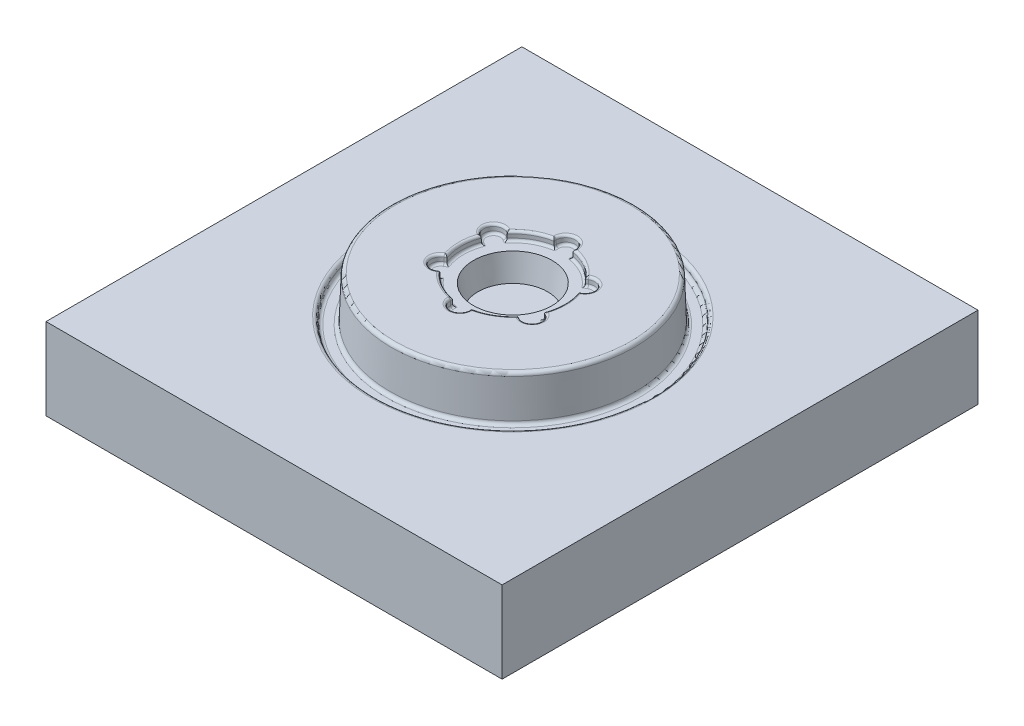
ISO-10303-21;
HEADER;
FILE_DESCRIPTION(('STEP AP214'),'2;1');
FILE_NAME('part.step','',(''),(''),'','','');
FILE_SCHEMA(('AUTOMOTIVE_DESIGN { 1 0 10303 214 1 1 1 1 }'));
ENDSEC;
DATA;
#1=APPLICATION_CONTEXT('core data for automotive mechanical design processes');
#2=APPLICATION_PROTOCOL_DEFINITION('international standard','automotive_design',2000,#1);
#3=PRODUCT_CONTEXT('',#1,'mechanical');
#4=PRODUCT('Part','Part','',(#3));
#5=PRODUCT_RELATED_PRODUCT_CATEGORY('part','',(#4));
#6=PRODUCT_DEFINITION_FORMATION('','',#4);
#7=PRODUCT_DEFINITION_CONTEXT('part definition',#1,'design');
#8=PRODUCT_DEFINITION('design','',#6,#7);
#9=PRODUCT_DEFINITION_SHAPE('','',#8);
#10=(LENGTH_UNIT() NAMED_UNIT(*) SI_UNIT(.MILLI.,.METRE.));
#11=(NAMED_UNIT(*) PLANE_ANGLE_UNIT() SI_UNIT($,.RADIAN.));
#12=(NAMED_UNIT(*) SI_UNIT($,.STERADIAN.) SOLID_ANGLE_UNIT());
#13=UNCERTAINTY_MEASURE_WITH_UNIT(LENGTH_MEASURE(1.E-05),#10,'distance_accuracy_value','');
#14=(GEOMETRIC_REPRESENTATION_CONTEXT(3) GLOBAL_UNCERTAINTY_ASSIGNED_CONTEXT((#13)) GLOBAL_UNIT_ASSIGNED_CONTEXT((#10,
#11,#12)) REPRESENTATION_CONTEXT('',''));
#15=CARTESIAN_POINT('',(0.,0.,0.));
#16=DIRECTION('',(0.,0.,1.));
#17=DIRECTION('',(1.,0.,0.));
#18=AXIS2_PLACEMENT_3D('',#15,#16,#17);
#19=CARTESIAN_POINT('',(-29.2971334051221,9.3,0.));
#20=DIRECTION('',(0.,1.,0.));
#21=DIRECTION('',(0.,0.,1.));
#22=AXIS2_PLACEMENT_3D('',#19,#20,#21);
#23=PLANE('',#22);
#24=CARTESIAN_POINT('',(0.,9.3,0.));
#25=DIRECTION('',(0.,-1.,0.));
#26=DIRECTION('',(0.,0.,-1.));
#27=AXIS2_PLACEMENT_3D('',#24,#25,#26);
#28=CIRCLE('',#27,29.2971334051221);
#29=CARTESIAN_POINT('',(0.,9.3,-29.2971334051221));
#30=VERTEX_POINT('',#29);
#31=EDGE_CURVE('E1234',#30,#30,#28,.T.);
#32=ORIENTED_EDGE('',*,*,#31,.F.);
#33=EDGE_LOOP('',(#32));
#34=FACE_BOUND('',#33,.T.);
#35=ADVANCED_FACE('F28',(#34),#23,.T.);
#36=CARTESIAN_POINT('',(0.,30.3,0.));
#37=DIRECTION('',(0.,1.,0.));
#38=DIRECTION('',(0.,0.,1.));
#39=AXIS2_PLACEMENT_3D('',#36,#37,#38);
#40=CONICAL_SURFACE('',#39,33.,0.174532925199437);
#41=ORIENTED_EDGE('',*,*,#31,.T.);
#42=EDGE_LOOP('',(#41));
#43=FACE_BOUND('',#42,.T.);
#44=CARTESIAN_POINT('',(0.,30.3,0.));
#45=DIRECTION('',(0.,-1.,0.));
#46=DIRECTION('',(0.,0.,-1.));
#47=AXIS2_PLACEMENT_3D('',#44,#45,#46);
#48=CIRCLE('',#47,33.);
#49=CARTESIAN_POINT('',(0.,30.3,-33.));
#50=VERTEX_POINT('',#49);
#51=EDGE_CURVE('E1238',#50,#50,#48,.T.);
#52=ORIENTED_EDGE('',*,*,#51,.F.);
#53=EDGE_LOOP('',(#52));
#54=FACE_BOUND('',#53,.T.);
#55=ADVANCED_FACE('F479',(#43,#54),#40,.F.);
#56=CARTESIAN_POINT('',(0.,30.3,0.));
#57=DIRECTION('',(0.,-1.,0.));
#58=DIRECTION('',(0.,0.,-1.));
#59=AXIS2_PLACEMENT_3D('',#56,#57,#58);
#60=PLANE('',#59);
#61=CARTESIAN_POINT('',(6.13224748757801E-13,30.3,-44.44));
#62=DIRECTION('',(0.,-1.,0.));
#63=DIRECTION('',(0.,0.,-1.));
#64=AXIS2_PLACEMENT_3D('',#61,#62,#63);
#65=CIRCLE('',#64,5.88241883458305);
#66=CARTESIAN_POINT('',(-5.88241883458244,30.3,-44.4400000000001));
#67=VERTEX_POINT('',#66);
#68=CARTESIAN_POINT('',(5.88241883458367,30.3,-44.4399999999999));
#69=VERTEX_POINT('',#68);
#70=EDGE_CURVE('E1440',#67,#69,#65,.T.);
#71=ORIENTED_EDGE('',*,*,#70,.F.);
#72=DIRECTION('',(0.,0.,1.));
#73=VECTOR('',#72,1.);
#74=CARTESIAN_POINT('',(-5.88241883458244,30.3,-44.4400000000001));
#75=LINE('',#74,#73);
#76=CARTESIAN_POINT('',(-5.88241883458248,30.3,-40.99006280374));
#77=VERTEX_POINT('',#76);
#78=EDGE_CURVE('E1434',#77,#67,#75,.F.);
#79=ORIENTED_EDGE('',*,*,#78,.F.);
#80=CARTESIAN_POINT('',(0.,30.3,0.));
#81=DIRECTION('',(0.,-1.,0.));
#82=DIRECTION('',(0.,0.,-1.));
#83=AXIS2_PLACEMENT_3D('',#80,#81,#82);
#84=CIRCLE('',#83,41.41);
#85=CARTESIAN_POINT('',(-32.5572262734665,30.3,-25.5893555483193));
#86=VERTEX_POINT('',#85);
#87=EDGE_CURVE('E1422',#86,#77,#84,.T.);
#88=ORIENTED_EDGE('',*,*,#87,.F.);
#89=DIRECTION('',(-0.866025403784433,0.,-0.500000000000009));
#90=VECTOR('',#89,1.);
#91=CARTESIAN_POINT('',(-34.0534586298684,30.3,-26.4532057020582));
#92=LINE('',#91,#90);
#93=CARTESIAN_POINT('',(-35.5449595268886,30.3,-27.3143241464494));
#94=VERTEX_POINT('',#93);
#95=EDGE_CURVE('E1403',#94,#86,#92,.F.);
#96=ORIENTED_EDGE('',*,*,#95,.F.);
#97=CARTESIAN_POINT('',(-38.4861689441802,30.3,-22.2200000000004));
#98=DIRECTION('',(0.,-1.,0.));
#99=DIRECTION('',(0.,0.,-1.));
#100=AXIS2_PLACEMENT_3D('',#97,#98,#99);
#101=CIRCLE('',#100,5.88241883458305);
#102=CARTESIAN_POINT('',(-41.4273783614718,30.3,-17.1256758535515));
#103=VERTEX_POINT('',#102);
#104=EDGE_CURVE('E1397',#103,#94,#101,.T.);
#105=ORIENTED_EDGE('',*,*,#104,.F.);
#106=DIRECTION('',(0.866025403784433,0.,0.500000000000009));
#107=VECTOR('',#106,1.);
#108=CARTESIAN_POINT('',(-41.4273783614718,30.3,-17.1256758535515));
#109=LINE('',#108,#107);
#110=CARTESIAN_POINT('',(-38.4396451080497,30.3,-15.4007072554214));
#111=VERTEX_POINT('',#110);
#112=EDGE_CURVE('E1399',#111,#103,#109,.F.);
#113=ORIENTED_EDGE('',*,*,#112,.F.);
#114=CARTESIAN_POINT('',(0.,30.3,0.));
#115=DIRECTION('',(0.,-1.,0.));
#116=DIRECTION('',(0.,0.,-1.));
#117=AXIS2_PLACEMENT_3D('',#114,#115,#116);
#118=CIRCLE('',#117,41.41);
#119=CARTESIAN_POINT('',(-38.43964510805,30.3,15.4007072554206));
#120=VERTEX_POINT('',#119);
#121=EDGE_CURVE('E1401',#120,#111,#118,.T.);
#122=ORIENTED_EDGE('',*,*,#121,.F.);
#123=DIRECTION('',(-0.866025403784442,0.,0.499999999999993));
#124=VECTOR('',#123,1.);
#125=CARTESIAN_POINT('',(-39.9358774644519,30.3,16.2645574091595));
#126=LINE('',#125,#124);
#127=CARTESIAN_POINT('',(-41.4273783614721,30.3,17.1256758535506));
#128=VERTEX_POINT('',#127);
#129=EDGE_CURVE('E1405',#128,#120,#126,.F.);
#130=ORIENTED_EDGE('',*,*,#129,.F.);
#131=CARTESIAN_POINT('',(-38.4861689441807,30.3,22.2199999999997));
#132=DIRECTION('',(0.,-1.,0.));
#133=DIRECTION('',(0.,0.,-1.));
#134=AXIS2_PLACEMENT_3D('',#131,#132,#133);
#135=CIRCLE('',#134,5.88241883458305);
#136=CARTESIAN_POINT('',(-35.5449595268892,30.3,27.3143241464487));
#137=VERTEX_POINT('',#136);
#138=EDGE_CURVE('E1408',#137,#128,#135,.T.);
#139=ORIENTED_EDGE('',*,*,#138,.F.);
#140=DIRECTION('',(0.866025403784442,0.,-0.499999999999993));
#141=VECTOR('',#140,1.);
#142=CARTESIAN_POINT('',(-35.5449595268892,30.3,27.3143241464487));
#143=LINE('',#142,#141);
#144=CARTESIAN_POINT('',(-32.5572262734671,30.3,25.5893555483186));
#145=VERTEX_POINT('',#144);
#146=EDGE_CURVE('E1410',#145,#137,#143,.F.);
#147=ORIENTED_EDGE('',*,*,#146,.F.);
#148=CARTESIAN_POINT('',(0.,30.3,0.));
#149=DIRECTION('',(0.,-1.,0.));
#150=DIRECTION('',(0.,0.,-1.));
#151=AXIS2_PLACEMENT_3D('',#148,#149,#150);
#152=CIRCLE('',#151,41.41);
#153=CARTESIAN_POINT('',(-5.88241883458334,30.3,40.9900628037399));
#154=VERTEX_POINT('',#153);
#155=EDGE_CURVE('E1412',#154,#145,#152,.T.);
#156=ORIENTED_EDGE('',*,*,#155,.F.);
#157=DIRECTION('',(0.,0.,1.));
#158=VECTOR('',#157,1.);
#159=CARTESIAN_POINT('',(-5.88241883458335,30.3,42.7177631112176));
#160=LINE('',#159,#158);
#161=CARTESIAN_POINT('',(-5.88241883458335,30.3,44.4399999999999));
#162=VERTEX_POINT('',#161);
#163=EDGE_CURVE('E1414',#162,#154,#160,.F.);
#164=ORIENTED_EDGE('',*,*,#163,.F.);
#165=CARTESIAN_POINT('',(-3.04860303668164E-13,30.3,44.44));
#166=DIRECTION('',(0.,-1.,0.));
#167=DIRECTION('',(0.,0.,-1.));
#168=AXIS2_PLACEMENT_3D('',#165,#166,#167);
#169=CIRCLE('',#168,5.88241883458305);
#170=CARTESIAN_POINT('',(5.88241883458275,30.3,44.44));
#171=VERTEX_POINT('',#170);
#172=EDGE_CURVE('E1416',#171,#162,#169,.T.);
#173=ORIENTED_EDGE('',*,*,#172,.F.);
#174=DIRECTION('',(0.,0.,-1.));
#175=VECTOR('',#174,1.);
#176=CARTESIAN_POINT('',(5.88241883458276,30.3,44.44));
#177=LINE('',#176,#175);
#178=CARTESIAN_POINT('',(5.88241883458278,30.3,40.9900628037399));
#179=VERTEX_POINT('',#178);
#180=EDGE_CURVE('E1418',#179,#171,#177,.F.);
#181=ORIENTED_EDGE('',*,*,#180,.F.);
#182=CARTESIAN_POINT('',(0.,30.3,0.));
#183=DIRECTION('',(0.,-1.,0.));
#184=DIRECTION('',(0.,0.,-1.));
#185=AXIS2_PLACEMENT_3D('',#182,#183,#184);
#186=CIRCLE('',#185,41.41);
#187=CARTESIAN_POINT('',(32.5572262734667,30.3,25.5893555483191));
#188=VERTEX_POINT('',#187);
#189=EDGE_CURVE('E1420',#188,#179,#186,.T.);
#190=ORIENTED_EDGE('',*,*,#189,.F.);
#191=DIRECTION('',(0.866025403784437,0.,0.500000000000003));
#192=VECTOR('',#191,1.);
#193=CARTESIAN_POINT('',(34.0534586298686,30.3,26.4532057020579));
#194=LINE('',#193,#192);
#195=CARTESIAN_POINT('',(35.5449595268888,30.3,27.3143241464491));
#196=VERTEX_POINT('',#195);
#197=EDGE_CURVE('E1424',#196,#188,#194,.F.);
#198=ORIENTED_EDGE('',*,*,#197,.F.);
#199=CARTESIAN_POINT('',(38.4861689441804,30.3,22.2200000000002));
#200=DIRECTION('',(0.,-1.,0.));
#201=DIRECTION('',(0.,0.,-1.));
#202=AXIS2_PLACEMENT_3D('',#199,#200,#201);
#203=CIRCLE('',#202,5.88241883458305);
#204=CARTESIAN_POINT('',(41.4273783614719,30.3,17.1256758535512));
#205=VERTEX_POINT('',#204);
#206=EDGE_CURVE('E1426',#205,#196,#203,.T.);
#207=ORIENTED_EDGE('',*,*,#206,.F.);
#208=DIRECTION('',(-0.866025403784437,0.,-0.500000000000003));
#209=VECTOR('',#208,1.);
#210=CARTESIAN_POINT('',(41.4273783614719,30.3,17.1256758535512));
#211=LINE('',#210,#209);
#212=CARTESIAN_POINT('',(38.4396451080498,30.3,15.4007072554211));
#213=VERTEX_POINT('',#212);
#214=EDGE_CURVE('E1428',#213,#205,#211,.F.);
#215=ORIENTED_EDGE('',*,*,#214,.F.);
#216=CARTESIAN_POINT('',(0.,30.3,0.));
#217=DIRECTION('',(0.,-1.,0.));
#218=DIRECTION('',(0.,0.,-1.));
#219=AXIS2_PLACEMENT_3D('',#216,#217,#218);
#220=CIRCLE('',#219,41.41);
#221=CARTESIAN_POINT('',(38.4396451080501,30.3,-15.4007072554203));
#222=VERTEX_POINT('',#221);
#223=EDGE_CURVE('E1430',#222,#213,#220,.T.);
#224=ORIENTED_EDGE('',*,*,#223,.F.);
#225=DIRECTION('',(0.866025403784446,0.,-0.499999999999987));
#226=VECTOR('',#225,1.);
#227=CARTESIAN_POINT('',(39.935877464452,30.3,-16.2645574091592));
#228=LINE('',#227,#226);
#229=CARTESIAN_POINT('',(41.4273783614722,30.3,-17.1256758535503));
#230=VERTEX_POINT('',#229);
#231=EDGE_CURVE('E1432',#230,#222,#228,.F.);
#232=ORIENTED_EDGE('',*,*,#231,.F.);
#233=CARTESIAN_POINT('',(38.4861689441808,30.3,-22.2199999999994));
#234=DIRECTION('',(0.,-1.,0.));
#235=DIRECTION('',(0.,0.,-1.));
#236=AXIS2_PLACEMENT_3D('',#233,#234,#235);
#237=CIRCLE('',#236,5.88241883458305);
#238=CARTESIAN_POINT('',(35.5449595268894,30.3,-27.3143241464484));
#239=VERTEX_POINT('',#238);
#240=EDGE_CURVE('E1436',#239,#230,#237,.T.);
#241=ORIENTED_EDGE('',*,*,#240,.F.);
#242=DIRECTION('',(-0.866025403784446,0.,0.499999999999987));
#243=VECTOR('',#242,1.);
#244=CARTESIAN_POINT('',(35.5449595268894,30.3,-27.3143241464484));
#245=LINE('',#244,#243);
#246=CARTESIAN_POINT('',(32.5572262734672,30.3,-25.5893555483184));
#247=VERTEX_POINT('',#246);
#248=EDGE_CURVE('E1438',#247,#239,#245,.F.);
#249=ORIENTED_EDGE('',*,*,#248,.F.);
#250=CARTESIAN_POINT('',(0.,30.3,0.));
#251=DIRECTION('',(0.,-1.,0.));
#252=DIRECTION('',(0.,0.,-1.));
#253=AXIS2_PLACEMENT_3D('',#250,#251,#252);
#254=CIRCLE('',#253,41.41);
#255=CARTESIAN_POINT('',(5.88241883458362,30.3,-40.9900628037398));
#256=VERTEX_POINT('',#255);
#257=EDGE_CURVE('E1442',#256,#247,#254,.T.);
#258=ORIENTED_EDGE('',*,*,#257,.F.);
#259=DIRECTION('',(0.,0.,-1.));
#260=VECTOR('',#259,1.);
#261=CARTESIAN_POINT('',(5.88241883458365,30.3,-42.7177631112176));
#262=LINE('',#261,#260);
#263=EDGE_CURVE('E1444',#69,#256,#262,.F.);
#264=ORIENTED_EDGE('',*,*,#263,.F.);
#265=EDGE_LOOP('',(#71,#79,#88,#96,#105,#113,#122,#130,#139,#147,#156,#164,#173,#181,#190,#198,
#207,#215,#224,#232,#241,#249,#258,#264));
#266=FACE_BOUND('',#265,.T.);
#267=ORIENTED_EDGE('',*,*,#51,.T.);
#268=EDGE_LOOP('',(#267));
#269=FACE_BOUND('',#268,.T.);
#270=ADVANCED_FACE('F486',(#266,#269),#60,.F.);
#271=CARTESIAN_POINT('',(-21.2987905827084,32.32,-19.0892946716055));
#272=DIRECTION('',(0.866025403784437,0.,0.500000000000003));
#273=DIRECTION('',(0.500000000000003,0.,-0.866025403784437));
#274=AXIS2_PLACEMENT_3D('',#271,#272,#273);
#275=CYLINDRICAL_SURFACE('',#274,2.02);
#276=CARTESIAN_POINT('',(40.933318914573,32.249503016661,14.5093563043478));
#277=CARTESIAN_POINT('',(40.9312760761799,32.2012744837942,14.5101093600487));
#278=CARTESIAN_POINT('',(40.9271011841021,32.1531586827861,14.5116490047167));
#279=CARTESIAN_POINT('',(40.9146252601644,32.0575707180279,14.5162481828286));
#280=CARTESIAN_POINT('',(40.9063270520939,32.0100981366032,14.5193066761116));
#281=CARTESIAN_POINT('',(40.8858129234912,31.9164837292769,14.5268643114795));
#282=CARTESIAN_POINT('',(40.8736254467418,31.8703348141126,14.5313529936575));
#283=CARTESIAN_POINT('',(40.8455306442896,31.7793492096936,14.5416943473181));
#284=CARTESIAN_POINT('',(40.8296228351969,31.7345126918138,14.547547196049));
#285=CARTESIAN_POINT('',(40.7767594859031,31.6026322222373,14.5669830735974));
#286=CARTESIAN_POINT('',(40.7345921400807,31.5178993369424,14.5824699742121));
#287=CARTESIAN_POINT('',(40.6385383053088,31.3562779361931,14.6176775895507));
#288=CARTESIAN_POINT('',(40.5846297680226,31.2794045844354,14.6374062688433));
#289=CARTESIAN_POINT('',(40.4469773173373,31.1092830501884,14.6876627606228));
#290=CARTESIAN_POINT('',(40.359362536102,31.0195645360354,14.7195658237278));
#291=CARTESIAN_POINT('',(40.1715172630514,30.8564854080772,14.7877074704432));
#292=CARTESIAN_POINT('',(40.0712651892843,30.783153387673,14.8239534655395));
#293=CARTESIAN_POINT('',(39.831609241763,30.6337586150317,14.9102395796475));
#294=CARTESIAN_POINT('',(39.6892509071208,30.5630044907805,14.9612437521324));
#295=CARTESIAN_POINT('',(39.3955466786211,30.4469963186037,15.0658537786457));
#296=CARTESIAN_POINT('',(39.2441980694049,30.4017500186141,15.1194604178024));
#297=CARTESIAN_POINT('',(38.9849042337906,30.3459072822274,15.2107361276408));
#298=CARTESIAN_POINT('',(38.8781813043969,30.3289006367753,15.2481487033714));
#299=CARTESIAN_POINT('',(38.6637086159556,30.3061087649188,15.3230098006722));
#300=CARTESIAN_POINT('',(38.5559609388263,30.3003042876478,15.3604581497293));
#301=CARTESIAN_POINT('',(38.4453656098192,30.3000038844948,15.3987281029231));
#302=CARTESIAN_POINT('',(38.4425053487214,30.3000000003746,15.3997177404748));
#303=CARTESIAN_POINT('',(38.4396451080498,30.3,15.4007072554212));
#304=B_SPLINE_CURVE_WITH_KNOTS('',3,(#276,#277,#278,#279,#280,#281,#282,#283,#284,#285,#286,
#287,#288,#289,#290,#291,#292,#293,#294,#295,#296,#297,#298,#299,#300,#301,#302,#303),
.UNSPECIFIED.,.F.,.F.,(4,2,2,2,2,2,2,2,2,2,2,2,2,4),(0.,0.144764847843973,0.289430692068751,
0.433061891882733,0.576711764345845,0.863042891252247,1.14991641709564,1.53598886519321,
1.92272981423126,2.42097569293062,2.91937283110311,3.26196522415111,3.60396834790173,
3.61304822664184),.UNSPECIFIED.);
#305=CARTESIAN_POINT('',(40.933318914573,32.249503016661,14.5093563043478));
#306=VERTEX_POINT('',#305);
#307=EDGE_CURVE('E709',#213,#306,#304,.F.);
#308=ORIENTED_EDGE('',*,*,#307,.F.);
#309=ORIENTED_EDGE('',*,*,#214,.T.);
#310=CARTESIAN_POINT('',(41.4273783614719,32.32,17.1256758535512));
#311=DIRECTION('',(0.866025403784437,0.,0.500000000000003));
#312=DIRECTION('',(0.500000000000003,0.,-0.866025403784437));
#313=AXIS2_PLACEMENT_3D('',#310,#311,#312);
#314=CIRCLE('',#313,2.02);
#315=CARTESIAN_POINT('',(42.4367630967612,32.249503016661,15.3773702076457));
#316=VERTEX_POINT('',#315);
#317=EDGE_CURVE('E688',#205,#316,#314,.T.);
#318=ORIENTED_EDGE('',*,*,#317,.T.);
#319=DIRECTION('',(0.866025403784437,0.,0.500000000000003));
#320=VECTOR('',#319,1.);
#321=CARTESIAN_POINT('',(40.945262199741,32.249503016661,14.5162517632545));
#322=LINE('',#321,#320);
#323=EDGE_CURVE('E1471',#316,#306,#322,.F.);
#324=ORIENTED_EDGE('',*,*,#323,.T.);
#325=EDGE_LOOP('',(#308,#309,#318,#324));
#326=FACE_BOUND('',#325,.T.);
#327=ADVANCED_FACE('F701',(#326),#275,.F.);
#328=CARTESIAN_POINT('',(0.,32.32,0.));
#329=DIRECTION('',(0.,-1.,0.));
#330=DIRECTION('',(0.,0.,-1.));
#331=AXIS2_PLACEMENT_3D('',#328,#329,#330);
#332=TOROIDAL_SURFACE('',#331,41.41,2.02);
#333=CARTESIAN_POINT('',(0.,32.32,0.));
#334=DIRECTION('',(0.,-1.,0.));
#335=DIRECTION('',(0.,0.,-1.));
#336=AXIS2_PLACEMENT_3D('',#333,#334,#335);
#337=CIRCLE('',#336,43.43);
#338=CARTESIAN_POINT('',(40.93523905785,32.3200000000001,14.5076222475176));
#339=VERTEX_POINT('',#338);
#340=CARTESIAN_POINT('',(40.9352390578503,32.3200000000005,-14.5076222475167));
#341=VERTEX_POINT('',#340);
#342=EDGE_CURVE('E1469',#339,#341,#337,.F.);
#343=ORIENTED_EDGE('',*,*,#342,.T.);
#344=CARTESIAN_POINT('',(40.9352390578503,32.3200000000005,-14.5076222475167));
#345=CARTESIAN_POINT('',(40.9350996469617,32.308248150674,-14.5080156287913));
#346=CARTESIAN_POINT('',(40.9348699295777,32.2964974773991,-14.5083568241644));
#347=CARTESIAN_POINT('',(40.9342298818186,32.2729984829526,-14.5089348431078));
#348=CARTESIAN_POINT('',(40.9338195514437,32.261250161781,-14.5091716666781));
#349=CARTESIAN_POINT('',(40.9333189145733,32.249503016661,-14.5093563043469));
#350=B_SPLINE_CURVE_WITH_KNOTS('',3,(#344,#345,#346,#347,#348,#349),.UNSPECIFIED.,.F.,.F.,(4,2,
4),(0.,0.0352736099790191,0.0705472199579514),.UNSPECIFIED.);
#351=CARTESIAN_POINT('',(40.9333189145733,32.249503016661,-14.5093563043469));
#352=VERTEX_POINT('',#351);
#353=EDGE_CURVE('E646',#341,#352,#350,.T.);
#354=ORIENTED_EDGE('',*,*,#353,.T.);
#355=CARTESIAN_POINT('',(40.9333189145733,32.249503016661,-14.5093563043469));
#356=CARTESIAN_POINT('',(40.9312760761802,32.2012744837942,-14.5101093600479));
#357=CARTESIAN_POINT('',(40.9271011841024,32.1531586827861,-14.5116490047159));
#358=CARTESIAN_POINT('',(40.9146252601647,32.0575707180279,-14.5162481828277));
#359=CARTESIAN_POINT('',(40.9063270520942,32.0100981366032,-14.5193066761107));
#360=CARTESIAN_POINT('',(40.8858129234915,31.916483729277,-14.5268643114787));
#361=CARTESIAN_POINT('',(40.8736254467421,31.8703348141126,-14.5313529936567));
#362=CARTESIAN_POINT('',(40.8455306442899,31.7793492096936,-14.5416943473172));
#363=CARTESIAN_POINT('',(40.8296228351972,31.7345126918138,-14.5475471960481));
#364=CARTESIAN_POINT('',(40.7767594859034,31.6026322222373,-14.5669830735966));
#365=CARTESIAN_POINT('',(40.734592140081,31.5178993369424,-14.5824699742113));
#366=CARTESIAN_POINT('',(40.6385383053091,31.3562779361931,-14.6176775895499));
#367=CARTESIAN_POINT('',(40.5846297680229,31.2794045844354,-14.6374062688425));
#368=CARTESIAN_POINT('',(40.4469773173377,31.1092830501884,-14.687662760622));
#369=CARTESIAN_POINT('',(40.3593625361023,31.0195645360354,-14.719565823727));
#370=CARTESIAN_POINT('',(40.1715172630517,30.8564854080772,-14.7877074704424));
#371=CARTESIAN_POINT('',(40.0712651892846,30.783153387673,-14.8239534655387));
#372=CARTESIAN_POINT('',(39.8316092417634,30.6337586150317,-14.9102395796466));
#373=CARTESIAN_POINT('',(39.6892509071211,30.5630044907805,-14.9612437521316));
#374=CARTESIAN_POINT('',(39.3955466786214,30.4469963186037,-15.0658537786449));
#375=CARTESIAN_POINT('',(39.2441980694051,30.4017500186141,-15.1194604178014));
#376=CARTESIAN_POINT('',(38.9849042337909,30.3459072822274,-15.2107361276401));
#377=CARTESIAN_POINT('',(38.8781813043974,30.3289006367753,-15.2481487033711));
#378=CARTESIAN_POINT('',(38.6637086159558,30.3061087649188,-15.3230098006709));
#379=CARTESIAN_POINT('',(38.555960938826,30.3003042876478,-15.3604581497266));
#380=CARTESIAN_POINT('',(38.4453656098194,30.3000038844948,-15.3987281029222));
#381=CARTESIAN_POINT('',(38.4425053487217,30.3000000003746,-15.399717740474));
#382=CARTESIAN_POINT('',(38.4396451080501,30.3,-15.4007072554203));
#383=B_SPLINE_CURVE_WITH_KNOTS('',3,(#355,#356,#357,#358,#359,#360,#361,#362,#363,#364,#365,
#366,#367,#368,#369,#370,#371,#372,#373,#374,#375,#376,#377,#378,#379,#380,#381,#382),
.UNSPECIFIED.,.F.,.F.,(4,2,2,2,2,2,2,2,2,2,2,2,2,4),(0.,0.144764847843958,0.289430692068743,
0.433061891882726,0.576711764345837,0.863042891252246,1.14991641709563,1.53598886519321,
1.92272981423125,2.42097569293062,2.9193728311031,3.26196522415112,3.60396834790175,
3.61304822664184),.UNSPECIFIED.);
#384=EDGE_CURVE('E719',#222,#352,#383,.F.);
#385=ORIENTED_EDGE('',*,*,#384,.F.);
#386=ORIENTED_EDGE('',*,*,#223,.T.);
#387=ORIENTED_EDGE('',*,*,#307,.T.);
#388=CARTESIAN_POINT('',(40.933318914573,32.249503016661,14.5093563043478));
#389=CARTESIAN_POINT('',(40.9338195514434,32.2612501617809,14.5091716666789));
#390=CARTESIAN_POINT('',(40.9342298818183,32.2729984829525,14.5089348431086));
#391=CARTESIAN_POINT('',(40.9348699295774,32.2964974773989,14.5083568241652));
#392=CARTESIAN_POINT('',(40.9350996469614,32.3082481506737,14.5080156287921));
#393=CARTESIAN_POINT('',(40.93523905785,32.3200000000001,14.5076222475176));
#394=B_SPLINE_CURVE_WITH_KNOTS('',3,(#388,#389,#390,#391,#392,#393),.UNSPECIFIED.,.F.,.F.,(4,2,
4),(0.,0.0352736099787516,0.0705472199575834),.UNSPECIFIED.);
#395=EDGE_CURVE('E779',#306,#339,#394,.T.);
#396=ORIENTED_EDGE('',*,*,#395,.T.);
#397=EDGE_LOOP('',(#343,#354,#385,#386,#387,#396));
#398=FACE_BOUND('',#397,.T.);
#399=ADVANCED_FACE('F704',(#398),#332,.F.);
#400=CARTESIAN_POINT('',(-21.2987905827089,32.32,19.0892946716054));
#401=DIRECTION('',(-0.866025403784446,0.,0.499999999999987));
#402=DIRECTION('',(0.499999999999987,0.,0.866025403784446));
#403=AXIS2_PLACEMENT_3D('',#400,#401,#402);
#404=CYLINDRICAL_SURFACE('',#403,2.02);
#405=DIRECTION('',(-0.866025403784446,0.,0.499999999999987));
#406=VECTOR('',#405,1.);
#407=CARTESIAN_POINT('',(42.4367630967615,32.249503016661,-15.3773702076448));
#408=LINE('',#407,#406);
#409=CARTESIAN_POINT('',(42.4367630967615,32.249503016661,-15.3773702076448));
#410=VERTEX_POINT('',#409);
#411=EDGE_CURVE('E1465',#352,#410,#408,.F.);
#412=ORIENTED_EDGE('',*,*,#411,.T.);
#413=CARTESIAN_POINT('',(41.4273783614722,32.32,-17.1256758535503));
#414=DIRECTION('',(0.866025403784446,0.,-0.499999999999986));
#415=DIRECTION('',(-0.499999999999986,0.,-0.866025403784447));
#416=AXIS2_PLACEMENT_3D('',#413,#414,#415);
#417=CIRCLE('',#416,2.02);
#418=EDGE_CURVE('E715',#410,#230,#417,.T.);
#419=ORIENTED_EDGE('',*,*,#418,.T.);
#420=ORIENTED_EDGE('',*,*,#231,.T.);
#421=ORIENTED_EDGE('',*,*,#384,.T.);
#422=EDGE_LOOP('',(#412,#419,#420,#421));
#423=FACE_BOUND('',#422,.T.);
#424=ADVANCED_FACE('F733',(#423),#404,.F.);
#425=CARTESIAN_POINT('',(38.4861689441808,32.32,-22.2199999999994));
#426=DIRECTION('',(0.,-1.,0.));
#427=DIRECTION('',(0.,0.,-1.));
#428=AXIS2_PLACEMENT_3D('',#425,#426,#427);
#429=TOROIDAL_SURFACE('',#428,5.88241883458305,2.02);
#430=ORIENTED_EDGE('',*,*,#418,.F.);
#431=CARTESIAN_POINT('',(38.4861689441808,32.249503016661,-22.2199999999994));
#432=DIRECTION('',(0.,1.,0.));
#433=DIRECTION('',(0.,0.,1.));
#434=AXIS2_PLACEMENT_3D('',#431,#432,#433);
#435=CIRCLE('',#434,7.90118830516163);
#436=CARTESIAN_POINT('',(34.5355747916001,32.249503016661,-29.0626297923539));
#437=VERTEX_POINT('',#436);
#438=EDGE_CURVE('E1467',#410,#437,#435,.T.);
#439=ORIENTED_EDGE('',*,*,#438,.T.);
#440=CARTESIAN_POINT('',(35.5449595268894,32.32,-27.3143241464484));
#441=DIRECTION('',(-0.866025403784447,0.,0.499999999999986));
#442=DIRECTION('',(0.499999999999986,0.,0.866025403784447));
#443=AXIS2_PLACEMENT_3D('',#440,#441,#442);
#444=CIRCLE('',#443,2.02);
#445=EDGE_CURVE('E716',#437,#239,#444,.T.);
#446=ORIENTED_EDGE('',*,*,#445,.T.);
#447=ORIENTED_EDGE('',*,*,#240,.T.);
#448=EDGE_LOOP('',(#430,#439,#446,#447));
#449=FACE_BOUND('',#448,.T.);
#450=ADVANCED_FACE('F694',(#449),#429,.F.);
#451=CARTESIAN_POINT('',(-27.1812094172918,32.32,8.90064637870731));
#452=DIRECTION('',(0.866025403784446,0.,-0.499999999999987));
#453=DIRECTION('',(-0.499999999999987,0.,-0.866025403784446));
#454=AXIS2_PLACEMENT_3D('',#451,#452,#453);
#455=CYLINDRICAL_SURFACE('',#454,2.02);
#456=ORIENTED_EDGE('',*,*,#445,.F.);
#457=DIRECTION('',(0.866025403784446,0.,-0.499999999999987));
#458=VECTOR('',#457,1.);
#459=CARTESIAN_POINT('',(33.0440738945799,32.249503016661,-28.2015113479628));
#460=LINE('',#459,#458);
#461=CARTESIAN_POINT('',(33.0321306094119,32.249503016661,-28.194615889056));
#462=VERTEX_POINT('',#461);
#463=EDGE_CURVE('E1461',#437,#462,#460,.F.);
#464=ORIENTED_EDGE('',*,*,#463,.T.);
#465=CARTESIAN_POINT('',(33.0321306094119,32.249503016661,-28.194615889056));
#466=CARTESIAN_POINT('',(33.0317613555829,32.2012744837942,-28.1924702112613));
#467=CARTESIAN_POINT('',(33.0310072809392,32.1531586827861,-28.1880848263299));
#468=CARTESIAN_POINT('',(33.0287523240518,32.0575707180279,-28.1749807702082));
#469=CARTESIAN_POINT('',(33.0272519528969,32.0100981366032,-28.1662650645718));
#470=CARTESIAN_POINT('',(33.0235399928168,31.9164837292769,-28.1447204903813));
#471=CARTESIAN_POINT('',(33.0213335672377,31.8703348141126,-28.1319214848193));
#472=CARTESIAN_POINT('',(33.0162420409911,31.7793492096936,-28.1024199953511));
#473=CARTESIAN_POINT('',(33.0133568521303,31.7345126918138,-28.0857170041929));
#474=CARTESIAN_POINT('',(33.0037571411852,31.6026322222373,-28.0302180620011));
#475=CARTESIAN_POINT('',(32.9960855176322,31.5178993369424,-27.9859566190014));
#476=CARTESIAN_POINT('',(32.9785492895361,31.3562779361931,-27.8851677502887));
#477=CARTESIAN_POINT('',(32.9686805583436,31.2794045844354,-27.8286172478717));
#478=CARTESIAN_POINT('',(32.9433777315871,31.1092830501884,-27.6842784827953));
#479=CARTESIAN_POINT('',(32.9271992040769,31.0195645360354,-27.592450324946));
#480=CARTESIAN_POINT('',(32.8922889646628,30.8564854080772,-27.3957007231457));
#481=CARTESIAN_POINT('',(32.8735528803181,30.783153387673,-27.2907568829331));
#482=CARTESIAN_POINT('',(32.8284508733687,30.6337586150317,-27.0400656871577));
#483=CARTESIAN_POINT('',(32.8014426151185,30.5630044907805,-26.8912776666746));
#484=CARTESIAN_POINT('',(32.7451854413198,30.4469963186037,-26.5846173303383));
#485=CARTESIAN_POINT('',(32.7159358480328,30.4017500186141,-26.4267422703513));
#486=CARTESIAN_POINT('',(32.6653360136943,30.3459072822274,-26.1565493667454));
#487=CARTESIAN_POINT('',(32.6443747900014,30.3289006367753,-26.0454183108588));
#488=CARTESIAN_POINT('',(32.601970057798,30.3061087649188,-25.8222489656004));
#489=CARTESIAN_POINT('',(32.5805274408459,30.3003042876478,-25.7102125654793));
#490=CARTESIAN_POINT('',(32.5583725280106,30.3000038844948,-25.5952992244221));
#491=CARTESIAN_POINT('',(32.5577994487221,30.3000000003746,-25.5923273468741));
#492=CARTESIAN_POINT('',(32.5572262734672,30.3,-25.5893555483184));
#493=B_SPLINE_CURVE_WITH_KNOTS('',3,(#465,#466,#467,#468,#469,#470,#471,#472,#473,#474,#475,
#476,#477,#478,#479,#480,#481,#482,#483,#484,#485,#486,#487,#488,#489,#490,#491,#492),
.UNSPECIFIED.,.F.,.F.,(4,2,2,2,2,2,2,2,2,2,2,2,2,4),(0.,0.144764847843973,0.28943069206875,
0.433061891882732,0.576711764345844,0.863042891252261,1.14991641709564,1.5359888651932,
1.92272981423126,2.42097569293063,2.91937283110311,3.26196522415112,3.60396834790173,
3.61304822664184),.UNSPECIFIED.);
#494=EDGE_CURVE('E682',#462,#247,#493,.T.);
#495=ORIENTED_EDGE('',*,*,#494,.T.);
#496=ORIENTED_EDGE('',*,*,#248,.T.);
#497=EDGE_LOOP('',(#456,#464,#495,#496));
#498=FACE_BOUND('',#497,.T.);
#499=ADVANCED_FACE('F664',(#498),#455,.F.);
#500=CARTESIAN_POINT('',(0.,32.32,0.));
#501=DIRECTION('',(0.,-1.,0.));
#502=DIRECTION('',(0.,0.,-1.));
#503=AXIS2_PLACEMENT_3D('',#500,#501,#502);
#504=TOROIDAL_SURFACE('',#503,41.41,2.02);
#505=ORIENTED_EDGE('',*,*,#494,.F.);
#506=CARTESIAN_POINT('',(33.0321306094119,32.249503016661,-28.194615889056));
#507=CARTESIAN_POINT('',(33.0322210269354,32.2612501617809,-28.1951417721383));
#508=CARTESIAN_POINT('',(33.0322210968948,32.2729984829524,-28.1956155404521));
#509=CARTESIAN_POINT('',(33.0320405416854,32.2964974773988,-28.1964588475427));
#510=CARTESIAN_POINT('',(33.0318599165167,32.3082481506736,-28.1968283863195));
#511=CARTESIAN_POINT('',(33.0315889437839,32.3200000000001,-28.1971458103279));
#512=B_SPLINE_CURVE_WITH_KNOTS('',3,(#506,#507,#508,#509,#510,#511),.UNSPECIFIED.,.F.,.F.,(4,2,
4),(0.,0.0352736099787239,0.0705472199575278),.UNSPECIFIED.);
#513=CARTESIAN_POINT('',(33.0315889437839,32.3200000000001,-28.1971458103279));
#514=VERTEX_POINT('',#513);
#515=EDGE_CURVE('E639',#462,#514,#512,.T.);
#516=ORIENTED_EDGE('',*,*,#515,.T.);
#517=CARTESIAN_POINT('',(0.,32.32,0.));
#518=DIRECTION('',(0.,-1.,0.));
#519=DIRECTION('',(0.,0.,-1.));
#520=AXIS2_PLACEMENT_3D('',#517,#518,#519);
#521=CIRCLE('',#520,43.43);
#522=CARTESIAN_POINT('',(7.90365011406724,32.3199999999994,-42.7047680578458));
#523=VERTEX_POINT('',#522);
#524=EDGE_CURVE('E1463',#514,#523,#521,.F.);
#525=ORIENTED_EDGE('',*,*,#524,.T.);
#526=CARTESIAN_POINT('',(7.90365011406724,32.3199999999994,-42.7047680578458));
#527=CARTESIAN_POINT('',(7.90323973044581,32.3082481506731,-42.7048440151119));
#528=CARTESIAN_POINT('',(7.90282938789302,32.2964974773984,-42.7048156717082));
#529=CARTESIAN_POINT('',(7.90200878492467,32.2729984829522,-42.7045503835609));
#530=CARTESIAN_POINT('',(7.90159852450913,32.2612501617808,-42.7043134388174));
#531=CARTESIAN_POINT('',(7.90118830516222,32.249503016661,-42.703972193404));
#532=B_SPLINE_CURVE_WITH_KNOTS('',3,(#526,#527,#528,#529,#530,#531),.UNSPECIFIED.,.F.,.F.,(4,2,
4),(0.,0.0352736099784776,0.070547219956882),.UNSPECIFIED.);
#533=CARTESIAN_POINT('',(7.90118830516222,32.249503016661,-42.703972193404));
#534=VERTEX_POINT('',#533);
#535=EDGE_CURVE('E647',#523,#534,#532,.T.);
#536=ORIENTED_EDGE('',*,*,#535,.T.);
#537=CARTESIAN_POINT('',(7.90118830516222,32.249503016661,-42.703972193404));
#538=CARTESIAN_POINT('',(7.89951472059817,32.2012744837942,-42.7025795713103));
#539=CARTESIAN_POINT('',(7.89609390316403,32.1531586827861,-42.6997338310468));
#540=CARTESIAN_POINT('',(7.88587293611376,32.0575707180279,-42.691228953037));
#541=CARTESIAN_POINT('',(7.87907509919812,32.0100981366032,-42.6855717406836));
#542=CARTESIAN_POINT('',(7.86227293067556,31.916483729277,-42.6715848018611));
#543=CARTESIAN_POINT('',(7.85229187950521,31.8703348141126,-42.6632744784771));
#544=CARTESIAN_POINT('',(7.82928860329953,31.7793492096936,-42.6441143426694));
#545=CARTESIAN_POINT('',(7.81626598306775,31.7345126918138,-42.6332642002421));
#546=CARTESIAN_POINT('',(7.77300234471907,31.6026322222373,-42.5972011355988));
#547=CARTESIAN_POINT('',(7.73850662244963,31.5178993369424,-42.5684265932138));
#548=CARTESIAN_POINT('',(7.6599890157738,31.3562779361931,-42.5028453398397));
#549=CARTESIAN_POINT('',(7.61594920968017,31.2794045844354,-42.4660235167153));
#550=CARTESIAN_POINT('',(7.5035995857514,31.1092830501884,-42.3719412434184));
#551=CARTESIAN_POINT('',(7.43216333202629,31.0195645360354,-42.3120161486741));
#552=CARTESIAN_POINT('',(7.27922829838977,30.8564854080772,-42.1834081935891));
#553=CARTESIAN_POINT('',(7.19771230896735,30.7831533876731,-42.1147103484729));
#554=CARTESIAN_POINT('',(7.0031583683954,30.6337586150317,-41.9503052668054));
#555=CARTESIAN_POINT('',(6.88780829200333,30.5630044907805,-41.8525214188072));
#556=CARTESIAN_POINT('',(6.65036123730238,30.4469963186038,-41.6504711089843));
#557=CARTESIAN_POINT('',(6.52826222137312,30.4017500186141,-41.5462026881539));
#558=CARTESIAN_POINT('',(6.31956822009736,30.3459072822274,-41.3672854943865));
#559=CARTESIAN_POINT('',(6.23380651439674,30.3289006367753,-41.2935670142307));
#560=CARTESIAN_POINT('',(6.06173855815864,30.3061087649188,-41.1452587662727));
#561=CARTESIAN_POINT('',(5.97543349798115,30.3003042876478,-41.0706707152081));
#562=CARTESIAN_POINT('',(5.88699308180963,30.3000038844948,-40.9940273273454));
#563=CARTESIAN_POINT('',(5.88470590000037,30.3000000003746,-40.9920450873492));
#564=CARTESIAN_POINT('',(5.88241883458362,30.3,-40.9900628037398));
#565=B_SPLINE_CURVE_WITH_KNOTS('',3,(#537,#538,#539,#540,#541,#542,#543,#544,#545,#546,#547,
#548,#549,#550,#551,#552,#553,#554,#555,#556,#557,#558,#559,#560,#561,#562,#563,#564),
.UNSPECIFIED.,.F.,.F.,(4,2,2,2,2,2,2,2,2,2,2,2,2,4),(0.,0.144764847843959,0.289430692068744,
0.433061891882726,0.576711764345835,0.863042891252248,1.14991641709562,1.53598886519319,
1.92272981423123,2.4209756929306,2.91937283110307,3.2619652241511,3.60396834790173,
3.61304822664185),.UNSPECIFIED.);
#566=EDGE_CURVE('E674',#534,#256,#565,.T.);
#567=ORIENTED_EDGE('',*,*,#566,.T.);
#568=ORIENTED_EDGE('',*,*,#257,.T.);
#569=EDGE_LOOP('',(#505,#516,#525,#536,#567,#568));
#570=FACE_BOUND('',#569,.T.);
#571=ADVANCED_FACE('F658',(#570),#504,.F.);
#572=CARTESIAN_POINT('',(5.88241883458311,32.32,4.77148556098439E-13));
#573=DIRECTION('',(0.,0.,1.));
#574=DIRECTION('',(1.,0.,0.));
#575=AXIS2_PLACEMENT_3D('',#572,#573,#574);
#576=CYLINDRICAL_SURFACE('',#575,2.02);
#577=ORIENTED_EDGE('',*,*,#566,.F.);
#578=DIRECTION('',(0.,0.,1.));
#579=VECTOR('',#578,1.);
#580=CARTESIAN_POINT('',(7.90118830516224,32.249503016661,-44.4399999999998));
#581=LINE('',#580,#579);
#582=CARTESIAN_POINT('',(7.90118830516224,32.249503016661,-44.4399999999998));
#583=VERTEX_POINT('',#582);
#584=EDGE_CURVE('E1459',#534,#583,#581,.F.);
#585=ORIENTED_EDGE('',*,*,#584,.T.);
#586=CARTESIAN_POINT('',(5.88241883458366,32.32,-44.4399999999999));
#587=DIRECTION('',(0.,0.,-1.));
#588=DIRECTION('',(-1.,0.,0.));
#589=AXIS2_PLACEMENT_3D('',#586,#587,#588);
#590=CIRCLE('',#589,2.02);
#591=EDGE_CURVE('E819',#583,#69,#590,.T.);
#592=ORIENTED_EDGE('',*,*,#591,.T.);
#593=ORIENTED_EDGE('',*,*,#263,.T.);
#594=EDGE_LOOP('',(#577,#585,#592,#593));
#595=FACE_BOUND('',#594,.T.);
#596=ADVANCED_FACE('F663',(#595),#576,.F.);
#597=CARTESIAN_POINT('',(6.13224748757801E-13,32.32,-44.44));
#598=DIRECTION('',(0.,-1.,0.));
#599=DIRECTION('',(0.,0.,-1.));
#600=AXIS2_PLACEMENT_3D('',#597,#598,#599);
#601=TOROIDAL_SURFACE('',#600,5.88241883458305,2.02);
#602=ORIENTED_EDGE('',*,*,#591,.F.);
#603=CARTESIAN_POINT('',(6.13224748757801E-13,32.249503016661,-44.44));
#604=DIRECTION('',(0.,1.,0.));
#605=DIRECTION('',(0.,0.,1.));
#606=AXIS2_PLACEMENT_3D('',#603,#604,#605);
#607=CIRCLE('',#606,7.90118830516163);
#608=CARTESIAN_POINT('',(-7.90118830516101,32.249503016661,-44.4400000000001));
#609=VERTEX_POINT('',#608);
#610=EDGE_CURVE('E1457',#583,#609,#607,.T.);
#611=ORIENTED_EDGE('',*,*,#610,.T.);
#612=CARTESIAN_POINT('',(-5.88241883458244,32.32,-44.4400000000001));
#613=DIRECTION('',(0.,0.,1.));
#614=DIRECTION('',(1.,0.,0.));
#615=AXIS2_PLACEMENT_3D('',#612,#613,#614);
#616=CIRCLE('',#615,2.02);
#617=EDGE_CURVE('E824',#609,#67,#616,.T.);
#618=ORIENTED_EDGE('',*,*,#617,.T.);
#619=ORIENTED_EDGE('',*,*,#70,.T.);
#620=EDGE_LOOP('',(#602,#611,#618,#619));
#621=FACE_BOUND('',#620,.T.);
#622=ADVANCED_FACE('F803',(#621),#601,.F.);
#623=CARTESIAN_POINT('',(-5.88241883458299,32.32,3.30205627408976E-13));
#624=DIRECTION('',(0.,0.,-1.));
#625=DIRECTION('',(-1.,0.,0.));
#626=AXIS2_PLACEMENT_3D('',#623,#624,#625);
#627=CYLINDRICAL_SURFACE('',#626,2.02);
#628=ORIENTED_EDGE('',*,*,#617,.F.);
#629=DIRECTION('',(0.,0.,-1.));
#630=VECTOR('',#629,1.);
#631=CARTESIAN_POINT('',(-7.90118830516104,32.249503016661,-42.7177631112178));
#632=LINE('',#631,#630);
#633=CARTESIAN_POINT('',(-7.90118830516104,32.249503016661,-42.7039721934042));
#634=VERTEX_POINT('',#633);
#635=EDGE_CURVE('E1455',#609,#634,#632,.F.);
#636=ORIENTED_EDGE('',*,*,#635,.T.);
#637=CARTESIAN_POINT('',(-7.90118830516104,32.249503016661,-42.7039721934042));
#638=CARTESIAN_POINT('',(-7.89951472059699,32.2012744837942,-42.7025795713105));
#639=CARTESIAN_POINT('',(-7.89609390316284,32.1531586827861,-42.6997338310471));
#640=CARTESIAN_POINT('',(-7.88587293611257,32.0575707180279,-42.6912289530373));
#641=CARTESIAN_POINT('',(-7.87907509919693,32.0100981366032,-42.6855717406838));
#642=CARTESIAN_POINT('',(-7.86227293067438,31.9164837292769,-42.6715848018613));
#643=CARTESIAN_POINT('',(-7.85229187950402,31.8703348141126,-42.6632744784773));
#644=CARTESIAN_POINT('',(-7.82928860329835,31.7793492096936,-42.6441143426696));
#645=CARTESIAN_POINT('',(-7.81626598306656,31.7345126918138,-42.6332642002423));
#646=CARTESIAN_POINT('',(-7.77300234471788,31.6026322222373,-42.597201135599));
#647=CARTESIAN_POINT('',(-7.73850662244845,31.5178993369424,-42.568426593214));
#648=CARTESIAN_POINT('',(-7.65998901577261,31.3562779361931,-42.5028453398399));
#649=CARTESIAN_POINT('',(-7.61594920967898,31.2794045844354,-42.4660235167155));
#650=CARTESIAN_POINT('',(-7.50359958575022,31.1092830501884,-42.3719412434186));
#651=CARTESIAN_POINT('',(-7.4321633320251,31.0195645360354,-42.3120161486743));
#652=CARTESIAN_POINT('',(-7.27922829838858,30.8564854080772,-42.1834081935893));
#653=CARTESIAN_POINT('',(-7.19771230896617,30.783153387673,-42.1147103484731));
#654=CARTESIAN_POINT('',(-7.00315836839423,30.6337586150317,-41.9503052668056));
#655=CARTESIAN_POINT('',(-6.88780829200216,30.5630044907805,-41.8525214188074));
#656=CARTESIAN_POINT('',(-6.65036123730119,30.4469963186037,-41.6504711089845));
#657=CARTESIAN_POINT('',(-6.52826222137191,30.4017500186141,-41.5462026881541));
#658=CARTESIAN_POINT('',(-6.31956822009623,30.3459072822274,-41.3672854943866));
#659=CARTESIAN_POINT('',(-6.23380651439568,30.3289006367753,-41.2935670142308));
#660=CARTESIAN_POINT('',(-6.0617385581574,30.3061087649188,-41.145258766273));
#661=CARTESIAN_POINT('',(-5.97543349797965,30.3003042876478,-41.0706707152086));
#662=CARTESIAN_POINT('',(-5.88699308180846,30.3000038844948,-40.9940273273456));
#663=CARTESIAN_POINT('',(-5.88470589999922,30.3000000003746,-40.9920450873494));
#664=CARTESIAN_POINT('',(-5.88241883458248,30.3,-40.99006280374));
#665=B_SPLINE_CURVE_WITH_KNOTS('',3,(#637,#638,#639,#640,#641,#642,#643,#644,#645,#646,#647,
#648,#649,#650,#651,#652,#653,#654,#655,#656,#657,#658,#659,#660,#661,#662,#663,#664),
.UNSPECIFIED.,.F.,.F.,(4,2,2,2,2,2,2,2,2,2,2,2,2,4),(0.,0.144764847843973,0.289430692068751,
0.433061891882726,0.576711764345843,0.863042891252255,1.14991641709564,1.5359888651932,
1.92272981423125,2.42097569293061,2.91937283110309,3.26196522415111,3.60396834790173,
3.61304822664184),.UNSPECIFIED.);
#666=EDGE_CURVE('E831',#634,#77,#665,.T.);
#667=ORIENTED_EDGE('',*,*,#666,.T.);
#668=ORIENTED_EDGE('',*,*,#78,.T.);
#669=EDGE_LOOP('',(#628,#636,#667,#668));
#670=FACE_BOUND('',#669,.T.);
#671=ADVANCED_FACE('F843',(#670),#627,.F.);
#672=CARTESIAN_POINT('',(0.,32.32,0.));
#673=DIRECTION('',(0.,-1.,0.));
#674=DIRECTION('',(0.,0.,-1.));
#675=AXIS2_PLACEMENT_3D('',#672,#673,#674);
#676=TOROIDAL_SURFACE('',#675,41.41,2.02);
#677=ORIENTED_EDGE('',*,*,#666,.F.);
#678=CARTESIAN_POINT('',(-7.90118830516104,32.249503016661,-42.7039721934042));
#679=CARTESIAN_POINT('',(-7.90159852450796,32.2612501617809,-42.7043134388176));
#680=CARTESIAN_POINT('',(-7.90200878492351,32.2729984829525,-42.7045503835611));
#681=CARTESIAN_POINT('',(-7.90282938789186,32.2964974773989,-42.7048156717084));
#682=CARTESIAN_POINT('',(-7.90323973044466,32.3082481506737,-42.7048440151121));
#683=CARTESIAN_POINT('',(-7.90365011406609,32.3200000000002,-42.704768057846));
#684=B_SPLINE_CURVE_WITH_KNOTS('',3,(#678,#679,#680,#681,#682,#683),.UNSPECIFIED.,.F.,.F.,(4,2,
4),(0.,0.0352736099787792,0.0705472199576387),.UNSPECIFIED.);
#685=CARTESIAN_POINT('',(-7.90365011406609,32.3200000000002,-42.704768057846));
#686=VERTEX_POINT('',#685);
#687=EDGE_CURVE('E872',#634,#686,#684,.T.);
#688=ORIENTED_EDGE('',*,*,#687,.T.);
#689=CARTESIAN_POINT('',(0.,32.32,0.));
#690=DIRECTION('',(0.,-1.,0.));
#691=DIRECTION('',(0.,0.,-1.));
#692=AXIS2_PLACEMENT_3D('',#689,#690,#691);
#693=CIRCLE('',#692,43.43);
#694=CARTESIAN_POINT('',(-33.0315889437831,32.3200000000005,-28.1971458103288));
#695=VERTEX_POINT('',#694);
#696=EDGE_CURVE('E1453',#686,#695,#693,.F.);
#697=ORIENTED_EDGE('',*,*,#696,.T.);
#698=CARTESIAN_POINT('',(-33.0315889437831,32.3200000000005,-28.1971458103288));
#699=CARTESIAN_POINT('',(-33.0318599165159,32.3082481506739,-28.1968283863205));
#700=CARTESIAN_POINT('',(-33.0320405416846,32.2964974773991,-28.1964588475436));
#701=CARTESIAN_POINT('',(-33.032221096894,32.2729984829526,-28.195615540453));
#702=CARTESIAN_POINT('',(-33.0322210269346,32.2612501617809,-28.1951417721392));
#703=CARTESIAN_POINT('',(-33.0321306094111,32.249503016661,-28.1946158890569));
#704=B_SPLINE_CURVE_WITH_KNOTS('',3,(#698,#699,#700,#701,#702,#703),.UNSPECIFIED.,.F.,.F.,(4,2,
4),(0.,0.0352736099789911,0.0705472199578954),.UNSPECIFIED.);
#705=CARTESIAN_POINT('',(-33.0321306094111,32.249503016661,-28.1946158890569));
#706=VERTEX_POINT('',#705);
#707=EDGE_CURVE('E865',#695,#706,#704,.T.);
#708=ORIENTED_EDGE('',*,*,#707,.T.);
#709=CARTESIAN_POINT('',(-33.0321306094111,32.249503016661,-28.1946158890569));
#710=CARTESIAN_POINT('',(-33.0317613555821,32.2012744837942,-28.1924702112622));
#711=CARTESIAN_POINT('',(-33.0310072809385,32.1531586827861,-28.1880848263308));
#712=CARTESIAN_POINT('',(-33.028752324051,32.0575707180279,-28.1749807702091));
#713=CARTESIAN_POINT('',(-33.0272519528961,32.0100981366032,-28.1662650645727));
#714=CARTESIAN_POINT('',(-33.023539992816,31.916483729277,-28.1447204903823));
#715=CARTESIAN_POINT('',(-33.021333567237,31.8703348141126,-28.1319214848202));
#716=CARTESIAN_POINT('',(-33.0162420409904,31.7793492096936,-28.102419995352));
#717=CARTESIAN_POINT('',(-33.0133568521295,31.7345126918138,-28.0857170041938));
#718=CARTESIAN_POINT('',(-33.0037571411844,31.6026322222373,-28.030218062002));
#719=CARTESIAN_POINT('',(-32.9960855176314,31.5178993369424,-27.9859566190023));
#720=CARTESIAN_POINT('',(-32.9785492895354,31.3562779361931,-27.8851677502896));
#721=CARTESIAN_POINT('',(-32.9686805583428,31.2794045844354,-27.8286172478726));
#722=CARTESIAN_POINT('',(-32.9433777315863,31.1092830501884,-27.6842784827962));
#723=CARTESIAN_POINT('',(-32.9271992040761,31.0195645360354,-27.5924503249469));
#724=CARTESIAN_POINT('',(-32.892288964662,30.8564854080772,-27.3957007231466));
#725=CARTESIAN_POINT('',(-32.8735528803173,30.783153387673,-27.2907568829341));
#726=CARTESIAN_POINT('',(-32.828450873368,30.6337586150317,-27.0400656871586));
#727=CARTESIAN_POINT('',(-32.8014426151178,30.5630044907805,-26.8912776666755));
#728=CARTESIAN_POINT('',(-32.7451854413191,30.4469963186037,-26.5846173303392));
#729=CARTESIAN_POINT('',(-32.715935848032,30.4017500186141,-26.4267422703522));
#730=CARTESIAN_POINT('',(-32.6653360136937,30.3459072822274,-26.1565493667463));
#731=CARTESIAN_POINT('',(-32.6443747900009,30.3289006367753,-26.0454183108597));
#732=CARTESIAN_POINT('',(-32.601970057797,30.3061087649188,-25.8222489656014));
#733=CARTESIAN_POINT('',(-32.5805274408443,30.3003042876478,-25.7102125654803));
#734=CARTESIAN_POINT('',(-32.5583725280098,30.3000038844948,-25.595299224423));
#735=CARTESIAN_POINT('',(-32.5577994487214,30.3000000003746,-25.592327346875));
#736=CARTESIAN_POINT('',(-32.5572262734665,30.3,-25.5893555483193));
#737=B_SPLINE_CURVE_WITH_KNOTS('',3,(#709,#710,#711,#712,#713,#714,#715,#716,#717,#718,#719,
#720,#721,#722,#723,#724,#725,#726,#727,#728,#729,#730,#731,#732,#733,#734,#735,#736),
.UNSPECIFIED.,.F.,.F.,(4,2,2,2,2,2,2,2,2,2,2,2,2,4),(0.,0.144764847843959,0.289430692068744,
0.433061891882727,0.576711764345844,0.863042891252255,1.14991641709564,1.5359888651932,
1.92272981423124,2.42097569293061,2.91937283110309,3.26196522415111,3.60396834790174,
3.61304822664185),.UNSPECIFIED.);
#738=EDGE_CURVE('E858',#706,#86,#737,.T.);
#739=ORIENTED_EDGE('',*,*,#738,.T.);
#740=ORIENTED_EDGE('',*,*,#87,.T.);
#741=EDGE_LOOP('',(#677,#688,#697,#708,#739,#740));
#742=FACE_BOUND('',#741,.T.);
#743=ADVANCED_FACE('F846',(#742),#676,.F.);
#744=CARTESIAN_POINT('',(-21.2987905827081,32.32,-19.0892946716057));
#745=DIRECTION('',(0.866025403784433,0.,0.500000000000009));
#746=DIRECTION('',(0.500000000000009,0.,-0.866025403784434));
#747=AXIS2_PLACEMENT_3D('',#744,#745,#746);
#748=CYLINDRICAL_SURFACE('',#747,2.02);
#749=ORIENTED_EDGE('',*,*,#738,.F.);
#750=DIRECTION('',(0.866025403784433,0.,0.500000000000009));
#751=VECTOR('',#750,1.);
#752=CARTESIAN_POINT('',(-34.5355747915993,32.249503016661,-29.0626297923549));
#753=LINE('',#752,#751);
#754=CARTESIAN_POINT('',(-34.5355747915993,32.249503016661,-29.0626297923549));
#755=VERTEX_POINT('',#754);
#756=EDGE_CURVE('E1451',#706,#755,#753,.F.);
#757=ORIENTED_EDGE('',*,*,#756,.T.);
#758=CARTESIAN_POINT('',(-35.5449595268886,32.32,-27.3143241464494));
#759=DIRECTION('',(-0.866025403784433,0.,-0.500000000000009));
#760=DIRECTION('',(-0.500000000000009,0.,0.866025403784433));
#761=AXIS2_PLACEMENT_3D('',#758,#759,#760);
#762=CIRCLE('',#761,2.02);
#763=EDGE_CURVE('E1215',#755,#94,#762,.T.);
#764=ORIENTED_EDGE('',*,*,#763,.T.);
#765=ORIENTED_EDGE('',*,*,#95,.T.);
#766=EDGE_LOOP('',(#749,#757,#764,#765));
#767=FACE_BOUND('',#766,.T.);
#768=ADVANCED_FACE('F850',(#767),#748,.F.);
#769=CARTESIAN_POINT('',(-38.4861689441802,32.32,-22.2200000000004));
#770=DIRECTION('',(0.,-1.,0.));
#771=DIRECTION('',(0.,0.,-1.));
#772=AXIS2_PLACEMENT_3D('',#769,#770,#771);
#773=TOROIDAL_SURFACE('',#772,5.88241883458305,2.02);
#774=ORIENTED_EDGE('',*,*,#763,.F.);
#775=CARTESIAN_POINT('',(-38.4861689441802,32.249503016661,-22.2200000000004));
#776=DIRECTION('',(0.,1.,0.));
#777=DIRECTION('',(0.,0.,1.));
#778=AXIS2_PLACEMENT_3D('',#775,#776,#777);
#779=CIRCLE('',#778,7.90118830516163);
#780=CARTESIAN_POINT('',(-42.4367630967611,32.249503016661,-15.377370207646));
#781=VERTEX_POINT('',#780);
#782=EDGE_CURVE('E873',#755,#781,#779,.T.);
#783=ORIENTED_EDGE('',*,*,#782,.T.);
#784=CARTESIAN_POINT('',(-41.4273783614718,32.32,-17.1256758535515));
#785=DIRECTION('',(0.866025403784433,0.,0.50000000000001));
#786=DIRECTION('',(0.50000000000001,0.,-0.866025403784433));
#787=AXIS2_PLACEMENT_3D('',#784,#785,#786);
#788=CIRCLE('',#787,2.02);
#789=EDGE_CURVE('E1219',#781,#103,#788,.T.);
#790=ORIENTED_EDGE('',*,*,#789,.T.);
#791=ORIENTED_EDGE('',*,*,#104,.T.);
#792=EDGE_LOOP('',(#774,#783,#790,#791));
#793=FACE_BOUND('',#792,.T.);
#794=ADVANCED_FACE('F1199',(#793),#773,.F.);
#795=CARTESIAN_POINT('',(-27.1812094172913,32.32,-8.90064637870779));
#796=DIRECTION('',(-0.866025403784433,0.,-0.500000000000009));
#797=DIRECTION('',(-0.500000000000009,0.,0.866025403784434));
#798=AXIS2_PLACEMENT_3D('',#795,#796,#797);
#799=CYLINDRICAL_SURFACE('',#798,2.02);
#800=ORIENTED_EDGE('',*,*,#789,.F.);
#801=DIRECTION('',(-0.866025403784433,0.,-0.500000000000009));
#802=VECTOR('',#801,1.);
#803=CARTESIAN_POINT('',(-40.9452621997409,32.249503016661,-14.5162517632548));
#804=LINE('',#803,#802);
#805=CARTESIAN_POINT('',(-40.9333189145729,32.249503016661,-14.509356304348));
#806=VERTEX_POINT('',#805);
#807=EDGE_CURVE('E1489',#781,#806,#804,.F.);
#808=ORIENTED_EDGE('',*,*,#807,.T.);
#809=CARTESIAN_POINT('',(-40.9333189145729,32.249503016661,-14.509356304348));
#810=CARTESIAN_POINT('',(-40.9312760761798,32.2012744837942,-14.510109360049));
#811=CARTESIAN_POINT('',(-40.927101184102,32.1531586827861,-14.511649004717));
#812=CARTESIAN_POINT('',(-40.9146252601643,32.0575707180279,-14.5162481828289));
#813=CARTESIAN_POINT('',(-40.9063270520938,32.0100981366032,-14.5193066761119));
#814=CARTESIAN_POINT('',(-40.8858129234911,31.916483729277,-14.5268643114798));
#815=CARTESIAN_POINT('',(-40.8736254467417,31.8703348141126,-14.5313529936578));
#816=CARTESIAN_POINT('',(-40.8455306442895,31.7793492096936,-14.5416943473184));
#817=CARTESIAN_POINT('',(-40.8296228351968,31.7345126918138,-14.5475471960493));
#818=CARTESIAN_POINT('',(-40.776759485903,31.6026322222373,-14.5669830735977));
#819=CARTESIAN_POINT('',(-40.7345921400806,31.5178993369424,-14.5824699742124));
#820=CARTESIAN_POINT('',(-40.6385383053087,31.3562779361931,-14.617677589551));
#821=CARTESIAN_POINT('',(-40.5846297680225,31.2794045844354,-14.6374062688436));
#822=CARTESIAN_POINT('',(-40.4469773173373,31.1092830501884,-14.6876627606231));
#823=CARTESIAN_POINT('',(-40.3593625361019,31.0195645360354,-14.7195658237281));
#824=CARTESIAN_POINT('',(-40.1715172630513,30.8564854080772,-14.7877074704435));
#825=CARTESIAN_POINT('',(-40.0712651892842,30.783153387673,-14.8239534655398));
#826=CARTESIAN_POINT('',(-39.8316092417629,30.6337586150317,-14.9102395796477));
#827=CARTESIAN_POINT('',(-39.6892509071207,30.5630044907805,-14.9612437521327));
#828=CARTESIAN_POINT('',(-39.395546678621,30.4469963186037,-15.065853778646));
#829=CARTESIAN_POINT('',(-39.2441980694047,30.4017500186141,-15.1194604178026));
#830=CARTESIAN_POINT('',(-38.9849042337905,30.3459072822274,-15.2107361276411));
#831=CARTESIAN_POINT('',(-38.8781813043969,30.3289006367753,-15.2481487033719));
#832=CARTESIAN_POINT('',(-38.6637086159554,30.3061087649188,-15.3230098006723));
#833=CARTESIAN_POINT('',(-38.5559609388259,30.3003042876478,-15.3604581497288));
#834=CARTESIAN_POINT('',(-38.445365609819,30.3000038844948,-15.3987281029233));
#835=CARTESIAN_POINT('',(-38.4425053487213,30.3000000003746,-15.3997177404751));
#836=CARTESIAN_POINT('',(-38.4396451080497,30.3,-15.4007072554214));
#837=B_SPLINE_CURVE_WITH_KNOTS('',3,(#809,#810,#811,#812,#813,#814,#815,#816,#817,#818,#819,
#820,#821,#822,#823,#824,#825,#826,#827,#828,#829,#830,#831,#832,#833,#834,#835,#836),
.UNSPECIFIED.,.F.,.F.,(4,2,2,2,2,2,2,2,2,2,2,2,2,4),(0.,0.144764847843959,0.289430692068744,
0.433061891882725,0.576711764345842,0.863042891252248,1.14991641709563,1.5359888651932,
1.92272981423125,2.42097569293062,2.9193728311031,3.26196522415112,3.60396834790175,
3.61304822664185),.UNSPECIFIED.);
#838=EDGE_CURVE('E525',#806,#111,#837,.T.);
#839=ORIENTED_EDGE('',*,*,#838,.T.);
#840=ORIENTED_EDGE('',*,*,#112,.T.);
#841=EDGE_LOOP('',(#800,#808,#839,#840));
#842=FACE_BOUND('',#841,.T.);
#843=ADVANCED_FACE('F509',(#842),#799,.F.);
#844=CARTESIAN_POINT('',(0.,32.32,0.));
#845=DIRECTION('',(0.,-1.,0.));
#846=DIRECTION('',(0.,0.,-1.));
#847=AXIS2_PLACEMENT_3D('',#844,#845,#846);
#848=TOROIDAL_SURFACE('',#847,41.41,2.02);
#849=ORIENTED_EDGE('',*,*,#838,.F.);
#850=CARTESIAN_POINT('',(-40.9333189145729,32.249503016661,-14.509356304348));
#851=CARTESIAN_POINT('',(-40.9338195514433,32.2612501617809,-14.5091716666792));
#852=CARTESIAN_POINT('',(-40.9342298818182,32.2729984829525,-14.5089348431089));
#853=CARTESIAN_POINT('',(-40.9348699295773,32.2964974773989,-14.5083568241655));
#854=CARTESIAN_POINT('',(-40.9350996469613,32.3082481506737,-14.5080156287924));
#855=CARTESIAN_POINT('',(-40.9352390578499,32.3200000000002,-14.5076222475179));
#856=B_SPLINE_CURVE_WITH_KNOTS('',3,(#850,#851,#852,#853,#854,#855),.UNSPECIFIED.,.F.,.F.,(4,2,
4),(0.,0.0352736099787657,0.0705472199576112),.UNSPECIFIED.);
#857=CARTESIAN_POINT('',(-40.93523905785,32.3200000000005,-14.5076222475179));
#858=VERTEX_POINT('',#857);
#859=EDGE_CURVE('E538',#806,#858,#856,.T.);
#860=ORIENTED_EDGE('',*,*,#859,.T.);
#861=CARTESIAN_POINT('',(0.,32.32,0.));
#862=DIRECTION('',(0.,-1.,0.));
#863=DIRECTION('',(0.,0.,-1.));
#864=AXIS2_PLACEMENT_3D('',#861,#862,#863);
#865=CIRCLE('',#864,43.43);
#866=CARTESIAN_POINT('',(-40.9352390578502,32.3200000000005,14.507622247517));
#867=VERTEX_POINT('',#866);
#868=EDGE_CURVE('E1488',#858,#867,#865,.F.);
#869=ORIENTED_EDGE('',*,*,#868,.T.);
#870=CARTESIAN_POINT('',(-40.9352390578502,32.3200000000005,14.507622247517));
#871=CARTESIAN_POINT('',(-40.9350996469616,32.3082481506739,14.5080156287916));
#872=CARTESIAN_POINT('',(-40.9348699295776,32.2964974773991,14.5083568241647));
#873=CARTESIAN_POINT('',(-40.9342298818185,32.2729984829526,14.5089348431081));
#874=CARTESIAN_POINT('',(-40.9338195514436,32.2612501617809,14.5091716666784));
#875=CARTESIAN_POINT('',(-40.9333189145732,32.249503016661,14.5093563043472));
#876=B_SPLINE_CURVE_WITH_KNOTS('',3,(#870,#871,#872,#873,#874,#875),.UNSPECIFIED.,.F.,.F.,(4,2,
4),(0.,0.0352736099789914,0.0705472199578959),.UNSPECIFIED.);
#877=CARTESIAN_POINT('',(-40.9333189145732,32.249503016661,14.5093563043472));
#878=VERTEX_POINT('',#877);
#879=EDGE_CURVE('E531',#867,#878,#876,.T.);
#880=ORIENTED_EDGE('',*,*,#879,.T.);
#881=CARTESIAN_POINT('',(-40.9333189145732,32.249503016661,14.5093563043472));
#882=CARTESIAN_POINT('',(-40.9312760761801,32.2012744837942,14.5101093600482));
#883=CARTESIAN_POINT('',(-40.9271011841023,32.1531586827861,14.5116490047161));
#884=CARTESIAN_POINT('',(-40.9146252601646,32.0575707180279,14.516248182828));
#885=CARTESIAN_POINT('',(-40.9063270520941,32.0100981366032,14.519306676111));
#886=CARTESIAN_POINT('',(-40.8858129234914,31.9164837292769,14.526864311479));
#887=CARTESIAN_POINT('',(-40.873625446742,31.8703348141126,14.531352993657));
#888=CARTESIAN_POINT('',(-40.8455306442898,31.7793492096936,14.5416943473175));
#889=CARTESIAN_POINT('',(-40.8296228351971,31.7345126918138,14.5475471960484));
#890=CARTESIAN_POINT('',(-40.7767594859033,31.6026322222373,14.5669830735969));
#891=CARTESIAN_POINT('',(-40.7345921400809,31.5178993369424,14.5824699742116));
#892=CARTESIAN_POINT('',(-40.638538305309,31.3562779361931,14.6176775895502));
#893=CARTESIAN_POINT('',(-40.5846297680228,31.2794045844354,14.6374062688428));
#894=CARTESIAN_POINT('',(-40.4469773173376,31.1092830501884,14.6876627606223));
#895=CARTESIAN_POINT('',(-40.3593625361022,31.0195645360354,14.7195658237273));
#896=CARTESIAN_POINT('',(-40.1715172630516,30.8564854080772,14.7877074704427));
#897=CARTESIAN_POINT('',(-40.0712651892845,30.783153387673,14.823953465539));
#898=CARTESIAN_POINT('',(-39.8316092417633,30.6337586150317,14.9102395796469));
#899=CARTESIAN_POINT('',(-39.689250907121,30.5630044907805,14.9612437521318));
#900=CARTESIAN_POINT('',(-39.3955466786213,30.4469963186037,15.0658537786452));
#901=CARTESIAN_POINT('',(-39.244198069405,30.4017500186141,15.1194604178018));
#902=CARTESIAN_POINT('',(-38.9849042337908,30.3459072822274,15.2107361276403));
#903=CARTESIAN_POINT('',(-38.8781813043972,30.3289006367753,15.2481487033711));
#904=CARTESIAN_POINT('',(-38.6637086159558,30.3061087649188,15.3230098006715));
#905=CARTESIAN_POINT('',(-38.5559609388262,30.3003042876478,15.3604581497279));
#906=CARTESIAN_POINT('',(-38.4453656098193,30.3000038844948,15.3987281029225));
#907=CARTESIAN_POINT('',(-38.4425053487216,30.3000000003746,15.3997177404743));
#908=CARTESIAN_POINT('',(-38.43964510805,30.3,15.4007072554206));
#909=B_SPLINE_CURVE_WITH_KNOTS('',3,(#881,#882,#883,#884,#885,#886,#887,#888,#889,#890,#891,
#892,#893,#894,#895,#896,#897,#898,#899,#900,#901,#902,#903,#904,#905,#906,#907,#908),
.UNSPECIFIED.,.F.,.F.,(4,2,2,2,2,2,2,2,2,2,2,2,2,4),(0.,0.144764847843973,0.289430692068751,
0.433061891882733,0.576711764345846,0.863042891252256,1.14991641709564,1.53598886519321,
1.92272981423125,2.42097569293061,2.9193728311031,3.26196522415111,3.60396834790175,
3.61304822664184),.UNSPECIFIED.);
#910=EDGE_CURVE('E516',#878,#120,#909,.T.);
#911=ORIENTED_EDGE('',*,*,#910,.T.);
#912=ORIENTED_EDGE('',*,*,#121,.T.);
#913=EDGE_LOOP('',(#849,#860,#869,#880,#911,#912));
#914=FACE_BOUND('',#913,.T.);
#915=ADVANCED_FACE('F504',(#914),#848,.F.);
#916=CARTESIAN_POINT('',(-27.1812094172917,32.32,8.90064637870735));
#917=DIRECTION('',(0.866025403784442,0.,-0.499999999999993));
#918=DIRECTION('',(-0.499999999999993,0.,-0.866025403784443));
#919=AXIS2_PLACEMENT_3D('',#916,#917,#918);
#920=CYLINDRICAL_SURFACE('',#919,2.02);
#921=CARTESIAN_POINT('',(-41.4273783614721,32.32,17.1256758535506));
#922=DIRECTION('',(0.866025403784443,0.,-0.499999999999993));
#923=DIRECTION('',(-0.499999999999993,0.,-0.866025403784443));
#924=AXIS2_PLACEMENT_3D('',#921,#922,#923);
#925=CIRCLE('',#924,2.02);
#926=CARTESIAN_POINT('',(-42.4367630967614,32.249503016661,15.3773702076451));
#927=VERTEX_POINT('',#926);
#928=EDGE_CURVE('E1229',#128,#927,#925,.T.);
#929=ORIENTED_EDGE('',*,*,#928,.F.);
#930=ORIENTED_EDGE('',*,*,#129,.T.);
#931=ORIENTED_EDGE('',*,*,#910,.F.);
#932=DIRECTION('',(0.866025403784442,0.,-0.499999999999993));
#933=VECTOR('',#932,1.);
#934=CARTESIAN_POINT('',(-42.4367630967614,32.249503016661,15.3773702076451));
#935=LINE('',#934,#933);
#936=EDGE_CURVE('E1446',#878,#927,#935,.F.);
#937=ORIENTED_EDGE('',*,*,#936,.T.);
#938=EDGE_LOOP('',(#929,#930,#931,#937));
#939=FACE_BOUND('',#938,.T.);
#940=ADVANCED_FACE('F508',(#939),#920,.F.);
#941=CARTESIAN_POINT('',(-38.4861689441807,32.32,22.2199999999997));
#942=DIRECTION('',(0.,-1.,0.));
#943=DIRECTION('',(0.,0.,-1.));
#944=AXIS2_PLACEMENT_3D('',#941,#942,#943);
#945=TOROIDAL_SURFACE('',#944,5.88241883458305,2.02);
#946=CARTESIAN_POINT('',(-35.5449595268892,32.32,27.3143241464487));
#947=DIRECTION('',(-0.866025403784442,0.,0.499999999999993));
#948=DIRECTION('',(0.499999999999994,0.,0.866025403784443));
#949=AXIS2_PLACEMENT_3D('',#946,#947,#948);
#950=CIRCLE('',#949,2.02);
#951=CARTESIAN_POINT('',(-34.5355747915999,32.249503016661,29.0626297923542));
#952=VERTEX_POINT('',#951);
#953=EDGE_CURVE('E1222',#137,#952,#950,.T.);
#954=ORIENTED_EDGE('',*,*,#953,.F.);
#955=ORIENTED_EDGE('',*,*,#138,.T.);
#956=ORIENTED_EDGE('',*,*,#928,.T.);
#957=CARTESIAN_POINT('',(-38.4861689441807,32.249503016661,22.2199999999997));
#958=DIRECTION('',(0.,1.,0.));
#959=DIRECTION('',(0.,0.,1.));
#960=AXIS2_PLACEMENT_3D('',#957,#958,#959);
#961=CIRCLE('',#960,7.90118830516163);
#962=EDGE_CURVE('E1486',#927,#952,#961,.T.);
#963=ORIENTED_EDGE('',*,*,#962,.T.);
#964=EDGE_LOOP('',(#954,#955,#956,#963));
#965=FACE_BOUND('',#964,.T.);
#966=ADVANCED_FACE('F1823',(#965),#945,.F.);
#967=CARTESIAN_POINT('',(-21.2987905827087,32.32,19.0892946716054));
#968=DIRECTION('',(-0.866025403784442,0.,0.499999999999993));
#969=DIRECTION('',(0.499999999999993,0.,0.866025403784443));
#970=AXIS2_PLACEMENT_3D('',#967,#968,#969);
#971=CYLINDRICAL_SURFACE('',#970,2.02);
#972=CARTESIAN_POINT('',(-33.0321306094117,32.249503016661,28.1946158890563));
#973=CARTESIAN_POINT('',(-33.0317613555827,32.2012744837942,28.1924702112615));
#974=CARTESIAN_POINT('',(-33.031007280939,32.1531586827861,28.1880848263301));
#975=CARTESIAN_POINT('',(-33.0287523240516,32.0575707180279,28.1749807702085));
#976=CARTESIAN_POINT('',(-33.0272519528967,32.0100981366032,28.166265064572));
#977=CARTESIAN_POINT('',(-33.0235399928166,31.9164837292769,28.1447204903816));
#978=CARTESIAN_POINT('',(-33.0213335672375,31.8703348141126,28.1319214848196));
#979=CARTESIAN_POINT('',(-33.0162420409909,31.7793492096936,28.1024199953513));
#980=CARTESIAN_POINT('',(-33.0133568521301,31.7345126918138,28.0857170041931));
#981=CARTESIAN_POINT('',(-33.003757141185,31.6026322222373,28.0302180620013));
#982=CARTESIAN_POINT('',(-32.996085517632,31.5178993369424,27.9859566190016));
#983=CARTESIAN_POINT('',(-32.9785492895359,31.3562779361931,27.8851677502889));
#984=CARTESIAN_POINT('',(-32.9686805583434,31.2794045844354,27.8286172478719));
#985=CARTESIAN_POINT('',(-32.9433777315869,31.1092830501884,27.6842784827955));
#986=CARTESIAN_POINT('',(-32.9271992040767,31.0195645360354,27.5924503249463));
#987=CARTESIAN_POINT('',(-32.8922889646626,30.8564854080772,27.3957007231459));
#988=CARTESIAN_POINT('',(-32.8735528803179,30.783153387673,27.2907568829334));
#989=CARTESIAN_POINT('',(-32.8284508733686,30.6337586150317,27.0400656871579));
#990=CARTESIAN_POINT('',(-32.8014426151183,30.5630044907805,26.8912776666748));
#991=CARTESIAN_POINT('',(-32.7451854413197,30.4469963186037,26.5846173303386));
#992=CARTESIAN_POINT('',(-32.7159358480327,30.4017500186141,26.4267422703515));
#993=CARTESIAN_POINT('',(-32.6653360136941,30.3459072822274,26.1565493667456));
#994=CARTESIAN_POINT('',(-32.644374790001,30.3289006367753,26.0454183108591));
#995=CARTESIAN_POINT('',(-32.6019700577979,30.3061087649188,25.8222489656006));
#996=CARTESIAN_POINT('',(-32.5805274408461,30.3003042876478,25.7102125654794));
#997=CARTESIAN_POINT('',(-32.5583725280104,30.3000038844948,25.5952992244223));
#998=CARTESIAN_POINT('',(-32.5577994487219,30.3000000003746,25.5923273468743));
#999=CARTESIAN_POINT('',(-32.557226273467,30.3,25.5893555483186));
#1000=B_SPLINE_CURVE_WITH_KNOTS('',3,(#972,#973,#974,#975,#976,#977,#978,#979,#980,#981,#982,
#983,#984,#985,#986,#987,#988,#989,#990,#991,#992,#993,#994,#995,#996,#997,#998,#999),
.UNSPECIFIED.,.F.,.F.,(4,2,2,2,2,2,2,2,2,2,2,2,2,4),(0.,0.144764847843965,0.289430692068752,
0.433061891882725,0.576711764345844,0.863042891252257,1.14991641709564,1.53598886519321,
1.92272981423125,2.42097569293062,2.9193728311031,3.26196522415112,3.60396834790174,
3.61304822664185),.UNSPECIFIED.);
#1001=CARTESIAN_POINT('',(-33.0321306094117,32.249503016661,28.1946158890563));
#1002=VERTEX_POINT('',#1001);
#1003=EDGE_CURVE('E1203',#145,#1002,#1000,.F.);
#1004=ORIENTED_EDGE('',*,*,#1003,.F.);
#1005=ORIENTED_EDGE('',*,*,#146,.T.);
#1006=ORIENTED_EDGE('',*,*,#953,.T.);
#1007=DIRECTION('',(-0.866025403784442,0.,0.499999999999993));
#1008=VECTOR('',#1007,1.);
#1009=CARTESIAN_POINT('',(-33.0440738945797,32.249503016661,28.201511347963));
#1010=LINE('',#1009,#1008);
#1011=EDGE_CURVE('E1484',#952,#1002,#1010,.F.);
#1012=ORIENTED_EDGE('',*,*,#1011,.T.);
#1013=EDGE_LOOP('',(#1004,#1005,#1006,#1012));
#1014=FACE_BOUND('',#1013,.T.);
#1015=ADVANCED_FACE('F1195',(#1014),#971,.F.);
#1016=CARTESIAN_POINT('',(0.,32.32,0.));
#1017=DIRECTION('',(0.,-1.,0.));
#1018=DIRECTION('',(0.,0.,-1.));
#1019=AXIS2_PLACEMENT_3D('',#1016,#1017,#1018);
#1020=TOROIDAL_SURFACE('',#1019,41.41,2.02);
#1021=CARTESIAN_POINT('',(0.,32.32,0.));
#1022=DIRECTION('',(0.,-1.,0.));
#1023=DIRECTION('',(0.,0.,-1.));
#1024=AXIS2_PLACEMENT_3D('',#1021,#1022,#1023);
#1025=CIRCLE('',#1024,43.43);
#1026=CARTESIAN_POINT('',(-33.0315889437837,32.3200000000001,28.1971458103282));
#1027=VERTEX_POINT('',#1026);
#1028=CARTESIAN_POINT('',(-7.90365011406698,32.3200000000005,42.7047680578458));
#1029=VERTEX_POINT('',#1028);
#1030=EDGE_CURVE('E1482',#1027,#1029,#1025,.F.);
#1031=ORIENTED_EDGE('',*,*,#1030,.T.);
#1032=CARTESIAN_POINT('',(-7.90365011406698,32.3200000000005,42.7047680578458));
#1033=CARTESIAN_POINT('',(-7.90323973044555,32.3082481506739,42.704844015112));
#1034=CARTESIAN_POINT('',(-7.90282938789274,32.2964974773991,42.7048156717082));
#1035=CARTESIAN_POINT('',(-7.90200878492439,32.2729984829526,42.704550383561));
#1036=CARTESIAN_POINT('',(-7.90159852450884,32.2612501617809,42.7043134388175));
#1037=CARTESIAN_POINT('',(-7.90118830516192,32.249503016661,42.7039721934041));
#1038=B_SPLINE_CURVE_WITH_KNOTS('',3,(#1032,#1033,#1034,#1035,#1036,#1037),.UNSPECIFIED.,.F.,
.F.,(4,2,4),(0.,0.0352736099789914,0.0705472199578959),.UNSPECIFIED.);
#1039=CARTESIAN_POINT('',(-7.90118830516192,32.249503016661,42.7039721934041));
#1040=VERTEX_POINT('',#1039);
#1041=EDGE_CURVE('E1186',#1029,#1040,#1038,.T.);
#1042=ORIENTED_EDGE('',*,*,#1041,.T.);
#1043=CARTESIAN_POINT('',(-7.90118830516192,32.249503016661,42.7039721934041));
#1044=CARTESIAN_POINT('',(-7.89951472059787,32.2012744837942,42.7025795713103));
#1045=CARTESIAN_POINT('',(-7.89609390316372,32.1531586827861,42.6997338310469));
#1046=CARTESIAN_POINT('',(-7.88587293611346,32.0575707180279,42.6912289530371));
#1047=CARTESIAN_POINT('',(-7.87907509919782,32.0100981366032,42.6855717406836));
#1048=CARTESIAN_POINT('',(-7.86227293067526,31.9164837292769,42.6715848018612));
#1049=CARTESIAN_POINT('',(-7.8522918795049,31.8703348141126,42.6632744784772));
#1050=CARTESIAN_POINT('',(-7.82928860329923,31.7793492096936,42.6441143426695));
#1051=CARTESIAN_POINT('',(-7.81626598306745,31.7345126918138,42.6332642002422));
#1052=CARTESIAN_POINT('',(-7.77300234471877,31.6026322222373,42.5972011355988));
#1053=CARTESIAN_POINT('',(-7.73850662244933,31.5178993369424,42.5684265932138));
#1054=CARTESIAN_POINT('',(-7.65998901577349,31.3562779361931,42.5028453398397));
#1055=CARTESIAN_POINT('',(-7.61594920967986,31.2794045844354,42.4660235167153));
#1056=CARTESIAN_POINT('',(-7.50359958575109,31.1092830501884,42.3719412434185));
#1057=CARTESIAN_POINT('',(-7.43216333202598,31.0195645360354,42.3120161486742));
#1058=CARTESIAN_POINT('',(-7.27922829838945,30.8564854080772,42.1834081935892));
#1059=CARTESIAN_POINT('',(-7.19771230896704,30.783153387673,42.114710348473));
#1060=CARTESIAN_POINT('',(-7.00315836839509,30.6337586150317,41.9503052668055));
#1061=CARTESIAN_POINT('',(-6.88780829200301,30.5630044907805,41.8525214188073));
#1062=CARTESIAN_POINT('',(-6.65036123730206,30.4469963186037,41.6504711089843));
#1063=CARTESIAN_POINT('',(-6.52826222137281,30.4017500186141,41.5462026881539));
#1064=CARTESIAN_POINT('',(-6.31956822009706,30.3459072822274,41.3672854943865));
#1065=CARTESIAN_POINT('',(-6.23380651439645,30.3289006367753,41.2935670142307));
#1066=CARTESIAN_POINT('',(-6.06173855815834,30.3061087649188,41.1452587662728));
#1067=CARTESIAN_POINT('',(-5.97543349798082,30.3003042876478,41.0706707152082));
#1068=CARTESIAN_POINT('',(-5.88699308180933,30.3000038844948,40.9940273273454));
#1069=CARTESIAN_POINT('',(-5.88470590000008,30.3000000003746,40.9920450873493));
#1070=CARTESIAN_POINT('',(-5.88241883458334,30.3,40.9900628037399));
#1071=B_SPLINE_CURVE_WITH_KNOTS('',3,(#1043,#1044,#1045,#1046,#1047,#1048,#1049,#1050,#1051,
#1052,#1053,#1054,#1055,#1056,#1057,#1058,#1059,#1060,#1061,#1062,#1063,#1064,#1065,#1066,#1067,
#1068,#1069,#1070),.UNSPECIFIED.,.F.,.F.,(4,2,2,2,2,2,2,2,2,2,2,2,2,4),(0.,0.144764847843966,
0.289430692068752,0.433061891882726,0.576711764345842,0.863042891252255,1.14991641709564,
1.53598886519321,1.92272981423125,2.42097569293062,2.9193728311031,3.26196522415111,
3.60396834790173,3.61304822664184),.UNSPECIFIED.);
#1072=EDGE_CURVE('E1210',#154,#1040,#1071,.F.);
#1073=ORIENTED_EDGE('',*,*,#1072,.F.);
#1074=ORIENTED_EDGE('',*,*,#155,.T.);
#1075=ORIENTED_EDGE('',*,*,#1003,.T.);
#1076=CARTESIAN_POINT('',(-33.0321306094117,32.249503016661,28.1946158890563));
#1077=CARTESIAN_POINT('',(-33.0322210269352,32.2612501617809,28.1951417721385));
#1078=CARTESIAN_POINT('',(-33.0322210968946,32.2729984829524,28.1956155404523));
#1079=CARTESIAN_POINT('',(-33.0320405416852,32.2964974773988,28.1964588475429));
#1080=CARTESIAN_POINT('',(-33.0318599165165,32.3082481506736,28.1968283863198));
#1081=CARTESIAN_POINT('',(-33.0315889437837,32.3200000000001,28.1971458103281));
#1082=B_SPLINE_CURVE_WITH_KNOTS('',3,(#1076,#1077,#1078,#1079,#1080,#1081),.UNSPECIFIED.,.F.,
.F.,(4,2,4),(0.,0.0352736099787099,0.0705472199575),.UNSPECIFIED.);
#1083=EDGE_CURVE('E539',#1002,#1027,#1082,.T.);
#1084=ORIENTED_EDGE('',*,*,#1083,.T.);
#1085=EDGE_LOOP('',(#1031,#1042,#1073,#1074,#1075,#1084));
#1086=FACE_BOUND('',#1085,.T.);
#1087=ADVANCED_FACE('F1191',(#1086),#1020,.F.);
#1088=CARTESIAN_POINT('',(-5.88241883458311,32.32,1.45290476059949E-13));
#1089=DIRECTION('',(0.,0.,-1.));
#1090=DIRECTION('',(-1.,0.,0.));
#1091=AXIS2_PLACEMENT_3D('',#1088,#1089,#1090);
#1092=CYLINDRICAL_SURFACE('',#1091,2.02);
#1093=DIRECTION('',(0.,0.,-1.));
#1094=VECTOR('',#1093,1.);
#1095=CARTESIAN_POINT('',(-7.90118830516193,32.249503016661,44.4399999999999));
#1096=LINE('',#1095,#1094);
#1097=CARTESIAN_POINT('',(-7.90118830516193,32.249503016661,44.4399999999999));
#1098=VERTEX_POINT('',#1097);
#1099=EDGE_CURVE('E1480',#1040,#1098,#1096,.F.);
#1100=ORIENTED_EDGE('',*,*,#1099,.T.);
#1101=CARTESIAN_POINT('',(-5.88241883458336,32.32,44.4399999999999));
#1102=DIRECTION('',(0.,0.,-1.));
#1103=DIRECTION('',(-1.,0.,0.));
#1104=AXIS2_PLACEMENT_3D('',#1101,#1102,#1103);
#1105=CIRCLE('',#1104,2.02);
#1106=EDGE_CURVE('E841',#162,#1098,#1105,.T.);
#1107=ORIENTED_EDGE('',*,*,#1106,.F.);
#1108=ORIENTED_EDGE('',*,*,#163,.T.);
#1109=ORIENTED_EDGE('',*,*,#1072,.T.);
#1110=EDGE_LOOP('',(#1100,#1107,#1108,#1109));
#1111=FACE_BOUND('',#1110,.T.);
#1112=ADVANCED_FACE('F852',(#1111),#1092,.F.);
#1113=CARTESIAN_POINT('',(-3.04860303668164E-13,32.32,44.44));
#1114=DIRECTION('',(0.,-1.,0.));
#1115=DIRECTION('',(0.,0.,-1.));
#1116=AXIS2_PLACEMENT_3D('',#1113,#1114,#1115);
#1117=TOROIDAL_SURFACE('',#1116,5.88241883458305,2.02);
#1118=CARTESIAN_POINT('',(5.88241883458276,32.32,44.44));
#1119=DIRECTION('',(0.,0.,1.));
#1120=DIRECTION('',(1.,0.,0.));
#1121=AXIS2_PLACEMENT_3D('',#1118,#1119,#1120);
#1122=CIRCLE('',#1121,2.02);
#1123=CARTESIAN_POINT('',(7.90118830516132,32.249503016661,44.4400000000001));
#1124=VERTEX_POINT('',#1123);
#1125=EDGE_CURVE('E827',#171,#1124,#1122,.T.);
#1126=ORIENTED_EDGE('',*,*,#1125,.F.);
#1127=ORIENTED_EDGE('',*,*,#172,.T.);
#1128=ORIENTED_EDGE('',*,*,#1106,.T.);
#1129=CARTESIAN_POINT('',(-3.04860303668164E-13,32.249503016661,44.44));
#1130=DIRECTION('',(0.,1.,0.));
#1131=DIRECTION('',(0.,0.,1.));
#1132=AXIS2_PLACEMENT_3D('',#1129,#1130,#1131);
#1133=CIRCLE('',#1132,7.90118830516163);
#1134=EDGE_CURVE('E1478',#1098,#1124,#1133,.T.);
#1135=ORIENTED_EDGE('',*,*,#1134,.T.);
#1136=EDGE_LOOP('',(#1126,#1127,#1128,#1135));
#1137=FACE_BOUND('',#1136,.T.);
#1138=ADVANCED_FACE('F1645',(#1137),#1117,.F.);
#1139=CARTESIAN_POINT('',(5.882418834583,32.32,2.09945364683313E-13));
#1140=DIRECTION('',(0.,0.,1.));
#1141=DIRECTION('',(1.,0.,0.));
#1142=AXIS2_PLACEMENT_3D('',#1139,#1140,#1141);
#1143=CYLINDRICAL_SURFACE('',#1142,2.02);
#1144=CARTESIAN_POINT('',(7.90118830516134,32.249503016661,42.7039721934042));
#1145=CARTESIAN_POINT('',(7.8995147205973,32.2012744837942,42.7025795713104));
#1146=CARTESIAN_POINT('',(7.89609390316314,32.1531586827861,42.699733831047));
#1147=CARTESIAN_POINT('',(7.88587293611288,32.0575707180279,42.6912289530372));
#1148=CARTESIAN_POINT('',(7.87907509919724,32.0100981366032,42.6855717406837));
#1149=CARTESIAN_POINT('',(7.86227293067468,31.9164837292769,42.6715848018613));
#1150=CARTESIAN_POINT('',(7.85229187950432,31.8703348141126,42.6632744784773));
#1151=CARTESIAN_POINT('',(7.82928860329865,31.7793492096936,42.6441143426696));
#1152=CARTESIAN_POINT('',(7.81626598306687,31.7345126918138,42.6332642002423));
#1153=CARTESIAN_POINT('',(7.77300234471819,31.6026322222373,42.5972011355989));
#1154=CARTESIAN_POINT('',(7.73850662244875,31.5178993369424,42.5684265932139));
#1155=CARTESIAN_POINT('',(7.65998901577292,31.3562779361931,42.5028453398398));
#1156=CARTESIAN_POINT('',(7.61594920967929,31.2794045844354,42.4660235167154));
#1157=CARTESIAN_POINT('',(7.50359958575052,31.1092830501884,42.3719412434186));
#1158=CARTESIAN_POINT('',(7.43216333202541,31.0195645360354,42.3120161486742));
#1159=CARTESIAN_POINT('',(7.27922829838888,30.8564854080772,42.1834081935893));
#1160=CARTESIAN_POINT('',(7.19771230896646,30.783153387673,42.1147103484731));
#1161=CARTESIAN_POINT('',(7.00315836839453,30.6337586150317,41.9503052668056));
#1162=CARTESIAN_POINT('',(6.88780829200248,30.5630044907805,41.8525214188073));
#1163=CARTESIAN_POINT('',(6.65036123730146,30.4469963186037,41.6504711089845));
#1164=CARTESIAN_POINT('',(6.52826222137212,30.4017500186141,41.5462026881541));
#1165=CARTESIAN_POINT('',(6.31956822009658,30.3459072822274,41.3672854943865));
#1166=CARTESIAN_POINT('',(6.23380651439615,30.3289006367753,41.2935670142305));
#1167=CARTESIAN_POINT('',(6.06173855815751,30.3061087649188,41.1452587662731));
#1168=CARTESIAN_POINT('',(5.97543349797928,30.3003042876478,41.0706707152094));
#1169=CARTESIAN_POINT('',(5.88699308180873,30.3000038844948,40.9940273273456));
#1170=CARTESIAN_POINT('',(5.8847058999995,30.3000000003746,40.9920450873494));
#1171=CARTESIAN_POINT('',(5.88241883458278,30.3,40.9900628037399));
#1172=B_SPLINE_CURVE_WITH_KNOTS('',3,(#1144,#1145,#1146,#1147,#1148,#1149,#1150,#1151,#1152,
#1153,#1154,#1155,#1156,#1157,#1158,#1159,#1160,#1161,#1162,#1163,#1164,#1165,#1166,#1167,#1168,
#1169,#1170,#1171),.UNSPECIFIED.,.F.,.F.,(4,2,2,2,2,2,2,2,2,2,2,2,2,4),(0.,0.144764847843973,
0.289430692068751,0.433061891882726,0.576711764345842,0.863042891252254,1.14991641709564,
1.53598886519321,1.92272981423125,2.42097569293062,2.9193728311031,3.26196522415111,
3.60396834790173,3.61304822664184),.UNSPECIFIED.);
#1173=CARTESIAN_POINT('',(7.90118830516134,32.249503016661,42.7039721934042));
#1174=VERTEX_POINT('',#1173);
#1175=EDGE_CURVE('E807',#179,#1174,#1172,.F.);
#1176=ORIENTED_EDGE('',*,*,#1175,.F.);
#1177=ORIENTED_EDGE('',*,*,#180,.T.);
#1178=ORIENTED_EDGE('',*,*,#1125,.T.);
#1179=DIRECTION('',(0.,0.,1.));
#1180=VECTOR('',#1179,1.);
#1181=CARTESIAN_POINT('',(7.90118830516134,32.249503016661,42.7177631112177));
#1182=LINE('',#1181,#1180);
#1183=EDGE_CURVE('E1476',#1124,#1174,#1182,.F.);
#1184=ORIENTED_EDGE('',*,*,#1183,.T.);
#1185=EDGE_LOOP('',(#1176,#1177,#1178,#1184));
#1186=FACE_BOUND('',#1185,.T.);
#1187=ADVANCED_FACE('F799',(#1186),#1143,.F.);
#1188=CARTESIAN_POINT('',(0.,32.32,0.));
#1189=DIRECTION('',(0.,-1.,0.));
#1190=DIRECTION('',(0.,0.,-1.));
#1191=AXIS2_PLACEMENT_3D('',#1188,#1189,#1190);
#1192=TOROIDAL_SURFACE('',#1191,41.41,2.02);
#1193=CARTESIAN_POINT('',(0.,32.32,0.));
#1194=DIRECTION('',(0.,-1.,0.));
#1195=DIRECTION('',(0.,0.,-1.));
#1196=AXIS2_PLACEMENT_3D('',#1193,#1194,#1195);
#1197=CIRCLE('',#1196,43.43);
#1198=CARTESIAN_POINT('',(7.90365011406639,32.3200000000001,42.7047680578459));
#1199=VERTEX_POINT('',#1198);
#1200=CARTESIAN_POINT('',(33.0315889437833,32.3199999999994,28.1971458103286));
#1201=VERTEX_POINT('',#1200);
#1202=EDGE_CURVE('E1474',#1199,#1201,#1197,.F.);
#1203=ORIENTED_EDGE('',*,*,#1202,.T.);
#1204=CARTESIAN_POINT('',(33.0315889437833,32.3199999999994,28.1971458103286));
#1205=CARTESIAN_POINT('',(33.0318599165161,32.3082481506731,28.1968283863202));
#1206=CARTESIAN_POINT('',(33.0320405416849,32.2964974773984,28.1964588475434));
#1207=CARTESIAN_POINT('',(33.0322210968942,32.2729984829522,28.1956155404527));
#1208=CARTESIAN_POINT('',(33.0322210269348,32.2612501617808,28.1951417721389));
#1209=CARTESIAN_POINT('',(33.0321306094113,32.249503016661,28.1946158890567));
#1210=B_SPLINE_CURVE_WITH_KNOTS('',3,(#1204,#1205,#1206,#1207,#1208,#1209),.UNSPECIFIED.,.F.,
.F.,(4,2,4),(0.,0.0352736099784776,0.070547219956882),.UNSPECIFIED.);
#1211=CARTESIAN_POINT('',(33.0321306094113,32.249503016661,28.1946158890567));
#1212=VERTEX_POINT('',#1211);
#1213=EDGE_CURVE('E784',#1201,#1212,#1210,.T.);
#1214=ORIENTED_EDGE('',*,*,#1213,.T.);
#1215=CARTESIAN_POINT('',(33.0321306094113,32.249503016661,28.1946158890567));
#1216=CARTESIAN_POINT('',(33.0317613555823,32.2012744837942,28.192470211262));
#1217=CARTESIAN_POINT('',(33.0310072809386,32.1531586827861,28.1880848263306));
#1218=CARTESIAN_POINT('',(33.0287523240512,32.0575707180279,28.1749807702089));
#1219=CARTESIAN_POINT('',(33.0272519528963,32.0100981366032,28.1662650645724));
#1220=CARTESIAN_POINT('',(33.0235399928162,31.9164837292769,28.144720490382));
#1221=CARTESIAN_POINT('',(33.0213335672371,31.8703348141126,28.13192148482));
#1222=CARTESIAN_POINT('',(33.0162420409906,31.7793492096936,28.1024199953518));
#1223=CARTESIAN_POINT('',(33.0133568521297,31.7345126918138,28.0857170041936));
#1224=CARTESIAN_POINT('',(33.0037571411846,31.6026322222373,28.0302180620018));
#1225=CARTESIAN_POINT('',(32.9960855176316,31.5178993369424,27.9859566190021));
#1226=CARTESIAN_POINT('',(32.9785492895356,31.3562779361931,27.8851677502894));
#1227=CARTESIAN_POINT('',(32.968680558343,31.2794045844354,27.8286172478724));
#1228=CARTESIAN_POINT('',(32.9433777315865,31.1092830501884,27.684278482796));
#1229=CARTESIAN_POINT('',(32.9271992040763,31.0195645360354,27.5924503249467));
#1230=CARTESIAN_POINT('',(32.8922889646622,30.8564854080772,27.3957007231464));
#1231=CARTESIAN_POINT('',(32.8735528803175,30.783153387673,27.2907568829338));
#1232=CARTESIAN_POINT('',(32.8284508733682,30.6337586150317,27.0400656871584));
#1233=CARTESIAN_POINT('',(32.801442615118,30.5630044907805,26.8912776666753));
#1234=CARTESIAN_POINT('',(32.7451854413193,30.4469963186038,26.584617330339));
#1235=CARTESIAN_POINT('',(32.7159358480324,30.4017500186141,26.426742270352));
#1236=CARTESIAN_POINT('',(32.6653360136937,30.3459072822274,26.1565493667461));
#1237=CARTESIAN_POINT('',(32.6443747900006,30.3289006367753,26.0454183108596));
#1238=CARTESIAN_POINT('',(32.6019700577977,30.3061087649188,25.8222489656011));
#1239=CARTESIAN_POINT('',(32.5805274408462,30.3003042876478,25.7102125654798));
#1240=CARTESIAN_POINT('',(32.5583725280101,30.3000038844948,25.5952992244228));
#1241=CARTESIAN_POINT('',(32.5577994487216,30.3000000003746,25.5923273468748));
#1242=CARTESIAN_POINT('',(32.5572262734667,30.3,25.5893555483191));
#1243=B_SPLINE_CURVE_WITH_KNOTS('',3,(#1215,#1216,#1217,#1218,#1219,#1220,#1221,#1222,#1223,
#1224,#1225,#1226,#1227,#1228,#1229,#1230,#1231,#1232,#1233,#1234,#1235,#1236,#1237,#1238,#1239,
#1240,#1241,#1242),.UNSPECIFIED.,.F.,.F.,(4,2,2,2,2,2,2,2,2,2,2,2,2,4),(0.,0.144764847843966,
0.289430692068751,0.433061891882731,0.576711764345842,0.863042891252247,1.14991641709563,
1.5359888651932,1.92272981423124,2.4209756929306,2.91937283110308,3.26196522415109,
3.60396834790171,3.61304822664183),.UNSPECIFIED.);
#1244=EDGE_CURVE('E814',#188,#1212,#1243,.F.);
#1245=ORIENTED_EDGE('',*,*,#1244,.F.);
#1246=ORIENTED_EDGE('',*,*,#189,.T.);
#1247=ORIENTED_EDGE('',*,*,#1175,.T.);
#1248=CARTESIAN_POINT('',(7.90118830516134,32.249503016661,42.7039721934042));
#1249=CARTESIAN_POINT('',(7.90159852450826,32.2612501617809,42.7043134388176));
#1250=CARTESIAN_POINT('',(7.90200878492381,32.2729984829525,42.7045503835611));
#1251=CARTESIAN_POINT('',(7.90282938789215,32.2964974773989,42.7048156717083));
#1252=CARTESIAN_POINT('',(7.90323973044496,32.3082481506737,42.7048440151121));
#1253=CARTESIAN_POINT('',(7.90365011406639,32.3200000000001,42.7047680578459));
#1254=B_SPLINE_CURVE_WITH_KNOTS('',3,(#1248,#1249,#1250,#1251,#1252,#1253),.UNSPECIFIED.,.F.,
.F.,(4,2,4),(0.,0.0352736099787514,0.0705472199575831),.UNSPECIFIED.);
#1255=EDGE_CURVE('E791',#1174,#1199,#1254,.T.);
#1256=ORIENTED_EDGE('',*,*,#1255,.T.);
#1257=EDGE_LOOP('',(#1203,#1214,#1245,#1246,#1247,#1256));
#1258=FACE_BOUND('',#1257,.T.);
#1259=ADVANCED_FACE('F795',(#1258),#1192,.F.);
#1260=CARTESIAN_POINT('',(-27.1812094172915,32.32,-8.90064637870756));
#1261=DIRECTION('',(-0.866025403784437,0.,-0.500000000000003));
#1262=DIRECTION('',(-0.500000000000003,0.,0.866025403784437));
#1263=AXIS2_PLACEMENT_3D('',#1260,#1261,#1262);
#1264=CYLINDRICAL_SURFACE('',#1263,2.02);
#1265=DIRECTION('',(-0.866025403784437,0.,-0.500000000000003));
#1266=VECTOR('',#1265,1.);
#1267=CARTESIAN_POINT('',(34.5355747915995,32.249503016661,29.0626297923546));
#1268=LINE('',#1267,#1266);
#1269=CARTESIAN_POINT('',(34.5355747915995,32.249503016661,29.0626297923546));
#1270=VERTEX_POINT('',#1269);
#1271=EDGE_CURVE('E1449',#1212,#1270,#1268,.F.);
#1272=ORIENTED_EDGE('',*,*,#1271,.T.);
#1273=CARTESIAN_POINT('',(35.5449595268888,32.32,27.3143241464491));
#1274=DIRECTION('',(-0.866025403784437,0.,-0.500000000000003));
#1275=DIRECTION('',(-0.500000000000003,0.,0.866025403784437));
#1276=AXIS2_PLACEMENT_3D('',#1273,#1274,#1275);
#1277=CIRCLE('',#1276,2.02);
#1278=EDGE_CURVE('E689',#196,#1270,#1277,.T.);
#1279=ORIENTED_EDGE('',*,*,#1278,.F.);
#1280=ORIENTED_EDGE('',*,*,#197,.T.);
#1281=ORIENTED_EDGE('',*,*,#1244,.T.);
#1282=EDGE_LOOP('',(#1272,#1279,#1280,#1281));
#1283=FACE_BOUND('',#1282,.T.);
#1284=ADVANCED_FACE('F666',(#1283),#1264,.F.);
#1285=CARTESIAN_POINT('',(38.4861689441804,32.32,22.2200000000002));
#1286=DIRECTION('',(0.,-1.,0.));
#1287=DIRECTION('',(0.,0.,-1.));
#1288=AXIS2_PLACEMENT_3D('',#1285,#1286,#1287);
#1289=TOROIDAL_SURFACE('',#1288,5.88241883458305,2.02);
#1290=ORIENTED_EDGE('',*,*,#317,.F.);
#1291=ORIENTED_EDGE('',*,*,#206,.T.);
#1292=ORIENTED_EDGE('',*,*,#1278,.T.);
#1293=CARTESIAN_POINT('',(38.4861689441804,32.249503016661,22.2200000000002));
#1294=DIRECTION('',(0.,1.,0.));
#1295=DIRECTION('',(0.,0.,1.));
#1296=AXIS2_PLACEMENT_3D('',#1293,#1294,#1295);
#1297=CIRCLE('',#1296,7.90118830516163);
#1298=EDGE_CURVE('E1281',#1270,#316,#1297,.T.);
#1299=ORIENTED_EDGE('',*,*,#1298,.T.);
#1300=EDGE_LOOP('',(#1290,#1291,#1292,#1299));
#1301=FACE_BOUND('',#1300,.T.);
#1302=ADVANCED_FACE('F696',(#1301),#1289,.F.);
#1303=CARTESIAN_POINT('',(42.5261689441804,37.37,15.2225147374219));
#1304=DIRECTION('',(0.499695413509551,-0.034899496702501,-0.865497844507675));
#1305=DIRECTION('',(-0.866025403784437,0.,-0.500000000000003));
#1306=AXIS2_PLACEMENT_3D('',#1303,#1304,#1305);
#1307=PLANE('',#1306);
#1308=DIRECTION('',(0.0174497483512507,0.999390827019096,-0.0302238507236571));
#1309=VECTOR('',#1308,1.);
#1310=CARTESIAN_POINT('',(42.5261689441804,37.37,15.2225147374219));
#1311=LINE('',#1310,#1309);
#1312=CARTESIAN_POINT('',(42.4921298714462,35.420496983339,15.28147214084));
#1313=VERTEX_POINT('',#1312);
#1314=EDGE_CURVE('E1285',#316,#1313,#1311,.T.);
#1315=ORIENTED_EDGE('',*,*,#1314,.T.);
#1316=DIRECTION('',(-0.866025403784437,0.,-0.500000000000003));
#1317=VECTOR('',#1316,1.);
#1318=CARTESIAN_POINT('',(42.4921298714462,35.420496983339,15.28147214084));
#1319=LINE('',#1318,#1317);
#1320=CARTESIAN_POINT('',(40.9729823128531,35.420496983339,14.4043918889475));
#1321=VERTEX_POINT('',#1320);
#1322=EDGE_CURVE('E763',#1321,#1313,#1319,.F.);
#1323=ORIENTED_EDGE('',*,*,#1322,.F.);
#1324=CARTESIAN_POINT('',(40.97106724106,35.3499999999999,14.4061288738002));
#1325=CARTESIAN_POINT('',(40.971205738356,35.3617518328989,14.4057349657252));
#1326=CARTESIAN_POINT('',(40.97143457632,35.37350249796,14.4053932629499));
#1327=CARTESIAN_POINT('',(40.9720729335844,35.3970014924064,14.4048142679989));
#1328=CARTESIAN_POINT('',(40.9724824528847,35.4087498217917,14.4045769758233));
#1329=CARTESIAN_POINT('',(40.9729823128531,35.420496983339,14.4043918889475));
#1330=B_SPLINE_CURVE_WITH_KNOTS('',3,(#1324,#1325,#1326,#1327,#1328,#1329),.UNSPECIFIED.,.F.,
.F.,(4,2,4),(0.,0.035273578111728,0.0705471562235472),.UNSPECIFIED.);
#1331=CARTESIAN_POINT('',(40.97106724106,35.3499999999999,14.4061288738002));
#1332=VERTEX_POINT('',#1331);
#1333=EDGE_CURVE('E756',#1332,#1321,#1330,.T.);
#1334=ORIENTED_EDGE('',*,*,#1333,.F.);
#1335=CARTESIAN_POINT('',(0.,-194.010926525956,0.));
#1336=DIRECTION('',(0.499695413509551,-0.034899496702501,-0.865497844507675));
#1337=DIRECTION('',(0.0174497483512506,0.999390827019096,-0.0302238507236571));
#1338=AXIS2_PLACEMENT_3D('',#1335,#1336,#1337);
#1339=ELLIPSE('',#1338,1244.43055354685,43.43);
#1340=EDGE_CURVE('E1284',#1332,#339,#1339,.T.);
#1341=ORIENTED_EDGE('',*,*,#1340,.T.);
#1342=ORIENTED_EDGE('',*,*,#395,.F.);
#1343=ORIENTED_EDGE('',*,*,#323,.F.);
#1344=EDGE_LOOP('',(#1315,#1323,#1334,#1341,#1342,#1343));
#1345=FACE_BOUND('',#1344,.T.);
#1346=ADVANCED_FACE('F699',(#1345),#1307,.F.);
#1347=CARTESIAN_POINT('',(0.,101.,0.));
#1348=DIRECTION('',(0.,1.,0.));
#1349=DIRECTION('',(0.,0.,1.));
#1350=AXIS2_PLACEMENT_3D('',#1347,#1348,#1349);
#1351=CYLINDRICAL_SURFACE('',#1350,43.43);
#1352=ORIENTED_EDGE('',*,*,#1340,.F.);
#1353=CARTESIAN_POINT('',(0.,35.35,0.));
#1354=DIRECTION('',(0.,-1.,0.));
#1355=DIRECTION('',(0.,0.,-1.));
#1356=AXIS2_PLACEMENT_3D('',#1353,#1354,#1355);
#1357=CIRCLE('',#1356,43.43);
#1358=CARTESIAN_POINT('',(40.9710672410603,35.3499999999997,-14.4061288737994));
#1359=VERTEX_POINT('',#1358);
#1360=EDGE_CURVE('E1395',#1359,#1332,#1357,.T.);
#1361=ORIENTED_EDGE('',*,*,#1360,.F.);
#1362=CARTESIAN_POINT('',(0.,-194.010926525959,0.));
#1363=DIRECTION('',(0.499695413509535,-0.034899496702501,0.865497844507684));
#1364=DIRECTION('',(0.0174497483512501,0.999390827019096,0.0302238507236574));
#1365=AXIS2_PLACEMENT_3D('',#1362,#1363,#1364);
#1366=ELLIPSE('',#1365,1244.43055354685,43.43);
#1367=EDGE_CURVE('E1561',#341,#1359,#1366,.T.);
#1368=ORIENTED_EDGE('',*,*,#1367,.F.);
#1369=ORIENTED_EDGE('',*,*,#342,.F.);
#1370=EDGE_LOOP('',(#1352,#1361,#1368,#1369));
#1371=FACE_BOUND('',#1370,.T.);
#1372=ADVANCED_FACE('F771',(#1371),#1351,.F.);
#1373=CARTESIAN_POINT('',(36.7180949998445,37.37,-11.8692216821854));
#1374=DIRECTION('',(0.499695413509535,-0.034899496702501,0.865497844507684));
#1375=DIRECTION('',(0.866025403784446,0.,-0.499999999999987));
#1376=AXIS2_PLACEMENT_3D('',#1373,#1374,#1375);
#1377=PLANE('',#1376);
#1378=ORIENTED_EDGE('',*,*,#1367,.T.);
#1379=CARTESIAN_POINT('',(40.9729823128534,35.420496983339,-14.4043918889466));
#1380=CARTESIAN_POINT('',(40.972482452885,35.4087498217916,-14.4045769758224));
#1381=CARTESIAN_POINT('',(40.9720729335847,35.3970014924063,-14.4048142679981));
#1382=CARTESIAN_POINT('',(40.9714345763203,35.3735024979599,-14.405393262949));
#1383=CARTESIAN_POINT('',(40.9712057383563,35.3617518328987,-14.4057349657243));
#1384=CARTESIAN_POINT('',(40.9710672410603,35.3499999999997,-14.4061288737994));
#1385=B_SPLINE_CURVE_WITH_KNOTS('',3,(#1379,#1380,#1381,#1382,#1383,#1384),.UNSPECIFIED.,.F.,
.F.,(4,2,4),(0.,0.0352735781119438,0.0705471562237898),.UNSPECIFIED.);
#1386=CARTESIAN_POINT('',(40.9729823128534,35.420496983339,-14.4043918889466));
#1387=VERTEX_POINT('',#1386);
#1388=EDGE_CURVE('E1384',#1387,#1359,#1385,.T.);
#1389=ORIENTED_EDGE('',*,*,#1388,.F.);
#1390=DIRECTION('',(-0.866025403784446,0.,0.499999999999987));
#1391=VECTOR('',#1390,1.);
#1392=CARTESIAN_POINT('',(36.6840559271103,35.420496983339,-11.9281790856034));
#1393=LINE('',#1392,#1391);
#1394=CARTESIAN_POINT('',(42.4921298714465,35.420496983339,-15.2814721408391));
#1395=VERTEX_POINT('',#1394);
#1396=EDGE_CURVE('E1389',#1395,#1387,#1393,.T.);
#1397=ORIENTED_EDGE('',*,*,#1396,.F.);
#1398=DIRECTION('',(0.0174497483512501,0.999390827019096,0.0302238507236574));
#1399=VECTOR('',#1398,1.);
#1400=CARTESIAN_POINT('',(42.5261689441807,37.37,-15.222514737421));
#1401=LINE('',#1400,#1399);
#1402=EDGE_CURVE('E608',#410,#1395,#1401,.T.);
#1403=ORIENTED_EDGE('',*,*,#1402,.F.);
#1404=ORIENTED_EDGE('',*,*,#411,.F.);
#1405=ORIENTED_EDGE('',*,*,#353,.F.);
#1406=EDGE_LOOP('',(#1378,#1389,#1397,#1403,#1404,#1405));
#1407=FACE_BOUND('',#1406,.T.);
#1408=ADVANCED_FACE('F626',(#1407),#1377,.F.);
#1409=CARTESIAN_POINT('',(38.4861689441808,37.37,-22.2199999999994));
#1410=DIRECTION('',(0.,1.,0.));
#1411=DIRECTION('',(-0.866025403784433,0.,-0.50000000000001));
#1412=AXIS2_PLACEMENT_3D('',#1409,#1410,#1411);
#1413=CONICAL_SURFACE('',#1412,8.08,0.0349065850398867);
#1414=ORIENTED_EDGE('',*,*,#1402,.T.);
#1415=CARTESIAN_POINT('',(38.4861689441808,35.420496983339,-22.2199999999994));
#1416=DIRECTION('',(0.,-1.,0.));
#1417=DIRECTION('',(0.,0.,-1.));
#1418=AXIS2_PLACEMENT_3D('',#1415,#1416,#1417);
#1419=CIRCLE('',#1418,8.01192185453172);
#1420=CARTESIAN_POINT('',(34.4802080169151,35.420496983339,-29.1585278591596));
#1421=VERTEX_POINT('',#1420);
#1422=EDGE_CURVE('E1380',#1421,#1395,#1419,.T.);
#1423=ORIENTED_EDGE('',*,*,#1422,.F.);
#1424=DIRECTION('',(-0.0174497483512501,0.999390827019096,-0.0302238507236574));
#1425=VECTOR('',#1424,1.);
#1426=CARTESIAN_POINT('',(34.4461689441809,37.37,-29.2174852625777));
#1427=LINE('',#1426,#1425);
#1428=EDGE_CURVE('E606',#437,#1421,#1427,.T.);
#1429=ORIENTED_EDGE('',*,*,#1428,.F.);
#1430=ORIENTED_EDGE('',*,*,#438,.F.);
#1431=EDGE_LOOP('',(#1414,#1423,#1429,#1430));
#1432=FACE_BOUND('',#1431,.T.);
#1433=ADVANCED_FACE('F624',(#1432),#1413,.F.);
#1434=CARTESIAN_POINT('',(34.4461689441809,37.37,-29.2174852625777));
#1435=DIRECTION('',(-0.499695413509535,-0.034899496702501,-0.865497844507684));
#1436=DIRECTION('',(-0.866025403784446,0.,0.499999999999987));
#1437=AXIS2_PLACEMENT_3D('',#1434,#1435,#1436);
#1438=PLANE('',#1437);
#1439=ORIENTED_EDGE('',*,*,#1428,.T.);
#1440=DIRECTION('',(0.866025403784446,0.,-0.499999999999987));
#1441=VECTOR('',#1440,1.);
#1442=CARTESIAN_POINT('',(34.4802080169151,35.420496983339,-29.1585278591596));
#1443=LINE('',#1442,#1441);
#1444=CARTESIAN_POINT('',(32.9610604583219,35.420496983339,-28.2814476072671));
#1445=VERTEX_POINT('',#1444);
#1446=EDGE_CURVE('E1371',#1445,#1421,#1443,.T.);
#1447=ORIENTED_EDGE('',*,*,#1446,.F.);
#1448=CARTESIAN_POINT('',(32.9616071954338,35.3500000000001,-28.2789206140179));
#1449=CARTESIAN_POINT('',(32.961335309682,35.3617518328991,-28.2792375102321));
#1450=CARTESIAN_POINT('',(32.9611538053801,35.3735024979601,-28.2796065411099));
#1451=CARTESIAN_POINT('',(32.9609715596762,35.3970014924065,-28.280448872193));
#1452=CARTESIAN_POINT('',(32.9609708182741,35.4087498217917,-28.2809221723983));
#1453=CARTESIAN_POINT('',(32.9610604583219,35.420496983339,-28.2814476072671));
#1454=B_SPLINE_CURVE_WITH_KNOTS('',3,(#1448,#1449,#1450,#1451,#1452,#1453),.UNSPECIFIED.,.F.,
.F.,(4,2,4),(0.,0.0352735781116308,0.0705471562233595),.UNSPECIFIED.);
#1455=CARTESIAN_POINT('',(32.9616071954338,35.3500000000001,-28.2789206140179));
#1456=VERTEX_POINT('',#1455);
#1457=EDGE_CURVE('E631',#1456,#1445,#1454,.T.);
#1458=ORIENTED_EDGE('',*,*,#1457,.F.);
#1459=CARTESIAN_POINT('',(0.,-194.010926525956,0.));
#1460=DIRECTION('',(-0.499695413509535,-0.034899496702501,-0.865497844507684));
#1461=DIRECTION('',(-0.0174497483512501,0.999390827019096,-0.0302238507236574));
#1462=AXIS2_PLACEMENT_3D('',#1459,#1460,#1461);
#1463=ELLIPSE('',#1462,1244.43055354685,43.43);
#1464=EDGE_CURVE('E1564',#1456,#514,#1463,.T.);
#1465=ORIENTED_EDGE('',*,*,#1464,.T.);
#1466=ORIENTED_EDGE('',*,*,#515,.F.);
#1467=ORIENTED_EDGE('',*,*,#463,.F.);
#1468=EDGE_LOOP('',(#1439,#1447,#1458,#1465,#1466,#1467));
#1469=FACE_BOUND('',#1468,.T.);
#1470=ADVANCED_FACE('F619',(#1469),#1438,.F.);
#1471=ORIENTED_EDGE('',*,*,#1464,.F.);
#1472=CARTESIAN_POINT('',(0.,35.35,0.));
#1473=DIRECTION('',(0.,-1.,0.));
#1474=DIRECTION('',(0.,0.,-1.));
#1475=AXIS2_PLACEMENT_3D('',#1472,#1473,#1474);
#1476=CIRCLE('',#1475,43.43);
#1477=CARTESIAN_POINT('',(8.00946004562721,35.3499999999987,-42.6850494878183));
#1478=VERTEX_POINT('',#1477);
#1479=EDGE_CURVE('E1370',#1478,#1456,#1476,.T.);
#1480=ORIENTED_EDGE('',*,*,#1479,.F.);
#1481=CARTESIAN_POINT('',(0.,-194.010926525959,0.));
#1482=DIRECTION('',(0.999390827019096,-0.034899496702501,0.));
#1483=DIRECTION('',(0.0348994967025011,0.999390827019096,0.));
#1484=AXIS2_PLACEMENT_3D('',#1481,#1482,#1483);
#1485=ELLIPSE('',#1484,1244.43055354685,43.43);
#1486=EDGE_CURVE('E1498',#523,#1478,#1485,.T.);
#1487=ORIENTED_EDGE('',*,*,#1486,.F.);
#1488=ORIENTED_EDGE('',*,*,#524,.F.);
#1489=EDGE_LOOP('',(#1471,#1480,#1487,#1488));
#1490=FACE_BOUND('',#1489,.T.);
#1491=ADVANCED_FACE('F623',(#1490),#1351,.F.);
#1492=CARTESIAN_POINT('',(8.08000000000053,37.37,-37.7334138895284));
#1493=DIRECTION('',(0.999390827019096,-0.034899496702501,0.));
#1494=DIRECTION('',(0.0348994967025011,0.999390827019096,0.));
#1495=AXIS2_PLACEMENT_3D('',#1492,#1493,#1494);
#1496=PLANE('',#1495);
#1497=ORIENTED_EDGE('',*,*,#1486,.T.);
#1498=CARTESIAN_POINT('',(8.0119218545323,35.420496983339,-42.6858394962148));
#1499=CARTESIAN_POINT('',(8.01151163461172,35.4087498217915,-42.6854991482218));
#1500=CARTESIAN_POINT('',(8.01110137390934,35.397001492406,-42.6852631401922));
#1501=CARTESIAN_POINT('',(8.01028077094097,35.3735024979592,-42.6849998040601));
#1502=CARTESIAN_POINT('',(8.00987042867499,35.3617518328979,-42.6849724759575));
#1503=CARTESIAN_POINT('',(8.00946004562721,35.3499999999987,-42.6850494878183));
#1504=B_SPLINE_CURVE_WITH_KNOTS('',3,(#1498,#1499,#1500,#1501,#1502,#1503),.UNSPECIFIED.,.F.,
.F.,(4,2,4),(0.,0.035273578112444,0.0705471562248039),.UNSPECIFIED.);
#1505=CARTESIAN_POINT('',(8.0119218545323,35.420496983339,-42.6858394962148));
#1506=VERTEX_POINT('',#1505);
#1507=EDGE_CURVE('E1073',#1506,#1478,#1504,.T.);
#1508=ORIENTED_EDGE('',*,*,#1507,.F.);
#1509=DIRECTION('',(0.,0.,1.));
#1510=VECTOR('',#1509,1.);
#1511=CARTESIAN_POINT('',(8.01192185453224,35.420496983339,-37.7334138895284));
#1512=LINE('',#1511,#1510);
#1513=CARTESIAN_POINT('',(8.01192185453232,35.420496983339,-44.4399999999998));
#1514=VERTEX_POINT('',#1513);
#1515=EDGE_CURVE('E1079',#1514,#1506,#1512,.T.);
#1516=ORIENTED_EDGE('',*,*,#1515,.F.);
#1517=DIRECTION('',(0.034899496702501,0.999390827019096,0.));
#1518=VECTOR('',#1517,1.);
#1519=CARTESIAN_POINT('',(8.08000000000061,37.37,-44.4399999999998));
#1520=LINE('',#1519,#1518);
#1521=EDGE_CURVE('E1369',#583,#1514,#1520,.T.);
#1522=ORIENTED_EDGE('',*,*,#1521,.F.);
#1523=ORIENTED_EDGE('',*,*,#584,.F.);
#1524=ORIENTED_EDGE('',*,*,#535,.F.);
#1525=EDGE_LOOP('',(#1497,#1508,#1516,#1522,#1523,#1524));
#1526=FACE_BOUND('',#1525,.T.);
#1527=ADVANCED_FACE('F1067',(#1526),#1496,.F.);
#1528=CARTESIAN_POINT('',(6.13224748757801E-13,37.37,-44.44));
#1529=DIRECTION('',(0.,1.,0.));
#1530=DIRECTION('',(-0.866025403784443,0.,0.499999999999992));
#1531=AXIS2_PLACEMENT_3D('',#1528,#1529,#1530);
#1532=CONICAL_SURFACE('',#1531,8.08,0.0349065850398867);
#1533=ORIENTED_EDGE('',*,*,#1521,.T.);
#1534=CARTESIAN_POINT('',(6.13224748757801E-13,35.4204969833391,-44.44));
#1535=DIRECTION('',(0.,-1.,0.));
#1536=DIRECTION('',(0.,0.,-1.));
#1537=AXIS2_PLACEMENT_3D('',#1534,#1535,#1536);
#1538=CIRCLE('',#1537,8.01192185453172);
#1539=CARTESIAN_POINT('',(-8.0119218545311,35.420496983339,-44.4400000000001));
#1540=VERTEX_POINT('',#1539);
#1541=EDGE_CURVE('E1060',#1540,#1514,#1538,.T.);
#1542=ORIENTED_EDGE('',*,*,#1541,.F.);
#1543=DIRECTION('',(-0.0348994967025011,0.999390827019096,0.));
#1544=VECTOR('',#1543,1.);
#1545=CARTESIAN_POINT('',(-8.07999999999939,37.37,-44.4400000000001));
#1546=LINE('',#1545,#1544);
#1547=EDGE_CURVE('E1559',#609,#1540,#1546,.T.);
#1548=ORIENTED_EDGE('',*,*,#1547,.F.);
#1549=ORIENTED_EDGE('',*,*,#610,.F.);
#1550=EDGE_LOOP('',(#1533,#1542,#1548,#1549));
#1551=FACE_BOUND('',#1550,.T.);
#1552=ADVANCED_FACE('F1065',(#1551),#1532,.F.);
#1553=CARTESIAN_POINT('',(-8.07999999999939,37.37,-44.4400000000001));
#1554=DIRECTION('',(-0.999390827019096,-0.034899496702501,0.));
#1555=DIRECTION('',(0.0348994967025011,-0.999390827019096,0.));
#1556=AXIS2_PLACEMENT_3D('',#1553,#1554,#1555);
#1557=PLANE('',#1556);
#1558=ORIENTED_EDGE('',*,*,#1547,.T.);
#1559=DIRECTION('',(0.,0.,-1.));
#1560=VECTOR('',#1559,1.);
#1561=CARTESIAN_POINT('',(-8.0119218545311,35.420496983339,-44.4400000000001));
#1562=LINE('',#1561,#1560);
#1563=CARTESIAN_POINT('',(-8.01192185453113,35.420496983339,-42.6858394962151));
#1564=VERTEX_POINT('',#1563);
#1565=EDGE_CURVE('E1050',#1564,#1540,#1562,.T.);
#1566=ORIENTED_EDGE('',*,*,#1565,.F.);
#1567=CARTESIAN_POINT('',(-8.00946004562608,35.35,-42.6850494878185));
#1568=CARTESIAN_POINT('',(-8.00987042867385,35.361751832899,-42.6849724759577));
#1569=CARTESIAN_POINT('',(-8.01028077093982,35.3735024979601,-42.6849998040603));
#1570=CARTESIAN_POINT('',(-8.01110137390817,35.3970014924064,-42.6852631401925));
#1571=CARTESIAN_POINT('',(-8.01151163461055,35.4087498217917,-42.685499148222));
#1572=CARTESIAN_POINT('',(-8.01192185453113,35.420496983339,-42.685839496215));
#1573=B_SPLINE_CURVE_WITH_KNOTS('',3,(#1567,#1568,#1569,#1570,#1571,#1572),.UNSPECIFIED.,.F.,
.F.,(4,2,4),(0.,0.0352735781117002,0.0705471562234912),.UNSPECIFIED.);
#1574=CARTESIAN_POINT('',(-8.00946004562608,35.35,-42.6850494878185));
#1575=VERTEX_POINT('',#1574);
#1576=EDGE_CURVE('E1054',#1575,#1564,#1573,.T.);
#1577=ORIENTED_EDGE('',*,*,#1576,.F.);
#1578=CARTESIAN_POINT('',(0.,-194.010926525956,0.));
#1579=DIRECTION('',(-0.999390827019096,-0.034899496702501,0.));
#1580=DIRECTION('',(-0.0348994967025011,0.999390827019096,0.));
#1581=AXIS2_PLACEMENT_3D('',#1578,#1579,#1580);
#1582=ELLIPSE('',#1581,1244.43055354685,43.43);
#1583=EDGE_CURVE('E1556',#1575,#686,#1582,.T.);
#1584=ORIENTED_EDGE('',*,*,#1583,.T.);
#1585=ORIENTED_EDGE('',*,*,#687,.F.);
#1586=ORIENTED_EDGE('',*,*,#635,.F.);
#1587=EDGE_LOOP('',(#1558,#1566,#1577,#1584,#1585,#1586));
#1588=FACE_BOUND('',#1587,.T.);
#1589=ADVANCED_FACE('F1062',(#1588),#1557,.F.);
#1590=ORIENTED_EDGE('',*,*,#1583,.F.);
#1591=CARTESIAN_POINT('',(0.,35.35,0.));
#1592=DIRECTION('',(0.,-1.,0.));
#1593=DIRECTION('',(0.,0.,-1.));
#1594=AXIS2_PLACEMENT_3D('',#1591,#1592,#1593);
#1595=CIRCLE('',#1594,43.43);
#1596=CARTESIAN_POINT('',(-32.9616071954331,35.3499999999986,-28.2789206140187));
#1597=VERTEX_POINT('',#1596);
#1598=EDGE_CURVE('E1049',#1597,#1575,#1595,.T.);
#1599=ORIENTED_EDGE('',*,*,#1598,.F.);
#1600=CARTESIAN_POINT('',(0.,-194.010926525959,0.));
#1601=DIRECTION('',(0.499695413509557,-0.034899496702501,-0.865497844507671));
#1602=DIRECTION('',(0.0174497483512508,0.999390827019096,-0.030223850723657));
#1603=AXIS2_PLACEMENT_3D('',#1600,#1601,#1602);
#1604=ELLIPSE('',#1603,1244.43055354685,43.43);
#1605=EDGE_CURVE('E1550',#695,#1597,#1604,.T.);
#1606=ORIENTED_EDGE('',*,*,#1605,.F.);
#1607=ORIENTED_EDGE('',*,*,#696,.F.);
#1608=EDGE_LOOP('',(#1590,#1599,#1606,#1607));
#1609=FACE_BOUND('',#1608,.T.);
#1610=ADVANCED_FACE('F883',(#1609),#1351,.F.);
#1611=CARTESIAN_POINT('',(-28.638094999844,37.37,-25.8641922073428));
#1612=DIRECTION('',(0.499695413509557,-0.034899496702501,-0.865497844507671));
#1613=DIRECTION('',(-0.866025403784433,0.,-0.500000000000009));
#1614=AXIS2_PLACEMENT_3D('',#1611,#1612,#1613);
#1615=PLANE('',#1614);
#1616=ORIENTED_EDGE('',*,*,#1605,.T.);
#1617=CARTESIAN_POINT('',(-32.9610604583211,35.420496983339,-28.281447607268));
#1618=CARTESIAN_POINT('',(-32.9609708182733,35.4087498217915,-28.2809221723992));
#1619=CARTESIAN_POINT('',(-32.9609715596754,35.3970014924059,-28.2804488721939));
#1620=CARTESIAN_POINT('',(-32.9611538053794,35.3735024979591,-28.2796065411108));
#1621=CARTESIAN_POINT('',(-32.9613353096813,35.3617518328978,-28.2792375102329));
#1622=CARTESIAN_POINT('',(-32.9616071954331,35.3499999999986,-28.2789206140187));
#1623=B_SPLINE_CURVE_WITH_KNOTS('',3,(#1617,#1618,#1619,#1620,#1621,#1622),.UNSPECIFIED.,.F.,
.F.,(4,2,4),(0.,0.0352735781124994,0.0705471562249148),.UNSPECIFIED.);
#1624=CARTESIAN_POINT('',(-32.9610604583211,35.420496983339,-28.281447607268));
#1625=VERTEX_POINT('',#1624);
#1626=EDGE_CURVE('E890',#1625,#1597,#1623,.T.);
#1627=ORIENTED_EDGE('',*,*,#1626,.F.);
#1628=DIRECTION('',(0.866025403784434,0.,0.500000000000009));
#1629=VECTOR('',#1628,1.);
#1630=CARTESIAN_POINT('',(-28.6721340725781,35.420496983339,-25.8052348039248));
#1631=LINE('',#1630,#1629);
#1632=CARTESIAN_POINT('',(-34.4802080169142,35.420496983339,-29.1585278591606));
#1633=VERTEX_POINT('',#1632);
#1634=EDGE_CURVE('E898',#1633,#1625,#1631,.T.);
#1635=ORIENTED_EDGE('',*,*,#1634,.F.);
#1636=DIRECTION('',(0.0174497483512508,0.999390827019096,-0.030223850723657));
#1637=VECTOR('',#1636,1.);
#1638=CARTESIAN_POINT('',(-34.4461689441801,37.37,-29.2174852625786));
#1639=LINE('',#1638,#1637);
#1640=EDGE_CURVE('E1047',#755,#1633,#1639,.T.);
#1641=ORIENTED_EDGE('',*,*,#1640,.F.);
#1642=ORIENTED_EDGE('',*,*,#756,.F.);
#1643=ORIENTED_EDGE('',*,*,#707,.F.);
#1644=EDGE_LOOP('',(#1616,#1627,#1635,#1641,#1642,#1643));
#1645=FACE_BOUND('',#1644,.T.);
#1646=ADVANCED_FACE('F879',(#1645),#1615,.F.);
#1647=CARTESIAN_POINT('',(-38.4861689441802,37.37,-22.2200000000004));
#1648=DIRECTION('',(0.,1.,0.));
#1649=DIRECTION('',(0.,0.,1.));
#1650=AXIS2_PLACEMENT_3D('',#1647,#1648,#1649);
#1651=CONICAL_SURFACE('',#1650,8.08,0.0349065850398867);
#1652=ORIENTED_EDGE('',*,*,#1640,.T.);
#1653=CARTESIAN_POINT('',(-38.4861689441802,35.420496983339,-22.2200000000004));
#1654=DIRECTION('',(0.,-1.,0.));
#1655=DIRECTION('',(0.,0.,-1.));
#1656=AXIS2_PLACEMENT_3D('',#1653,#1654,#1655);
#1657=CIRCLE('',#1656,8.01192185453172);
#1658=CARTESIAN_POINT('',(-42.4921298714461,35.420496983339,-15.2814721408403));
#1659=VERTEX_POINT('',#1658);
#1660=EDGE_CURVE('E899',#1659,#1633,#1657,.T.);
#1661=ORIENTED_EDGE('',*,*,#1660,.F.);
#1662=DIRECTION('',(-0.0174497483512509,0.999390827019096,0.030223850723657));
#1663=VECTOR('',#1662,1.);
#1664=CARTESIAN_POINT('',(-42.5261689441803,37.37,-15.2225147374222));
#1665=LINE('',#1664,#1663);
#1666=EDGE_CURVE('E1494',#781,#1659,#1665,.T.);
#1667=ORIENTED_EDGE('',*,*,#1666,.F.);
#1668=ORIENTED_EDGE('',*,*,#782,.F.);
#1669=EDGE_LOOP('',(#1652,#1661,#1667,#1668));
#1670=FACE_BOUND('',#1669,.T.);
#1671=ADVANCED_FACE('F882',(#1670),#1651,.F.);
#1672=CARTESIAN_POINT('',(-42.5261689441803,37.37,-15.2225147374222));
#1673=DIRECTION('',(-0.499695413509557,-0.034899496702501,0.865497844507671));
#1674=DIRECTION('',(0.866025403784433,0.,0.500000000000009));
#1675=AXIS2_PLACEMENT_3D('',#1672,#1673,#1674);
#1676=PLANE('',#1675);
#1677=ORIENTED_EDGE('',*,*,#1666,.T.);
#1678=DIRECTION('',(-0.866025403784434,0.,-0.500000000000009));
#1679=VECTOR('',#1678,1.);
#1680=CARTESIAN_POINT('',(-42.4921298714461,35.420496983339,-15.2814721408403));
#1681=LINE('',#1680,#1679);
#1682=CARTESIAN_POINT('',(-40.972982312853,35.420496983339,-14.4043918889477));
#1683=VERTEX_POINT('',#1682);
#1684=EDGE_CURVE('E2021',#1683,#1659,#1681,.T.);
#1685=ORIENTED_EDGE('',*,*,#1684,.F.);
#1686=CARTESIAN_POINT('',(-40.9710672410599,35.35,-14.4061288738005));
#1687=CARTESIAN_POINT('',(-40.9712057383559,35.361751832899,-14.4057349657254));
#1688=CARTESIAN_POINT('',(-40.9714345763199,35.37350249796,-14.4053932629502));
#1689=CARTESIAN_POINT('',(-40.9720729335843,35.3970014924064,-14.4048142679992));
#1690=CARTESIAN_POINT('',(-40.9724824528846,35.4087498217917,-14.4045769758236));
#1691=CARTESIAN_POINT('',(-40.972982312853,35.420496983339,-14.4043918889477));
#1692=B_SPLINE_CURVE_WITH_KNOTS('',3,(#1686,#1687,#1688,#1689,#1690,#1691),.UNSPECIFIED.,.F.,
.F.,(4,2,4),(0.,0.035273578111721,0.0705471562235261),.UNSPECIFIED.);
#1693=CARTESIAN_POINT('',(-40.9710672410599,35.35,-14.4061288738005));
#1694=VERTEX_POINT('',#1693);
#1695=EDGE_CURVE('E2023',#1694,#1683,#1692,.T.);
#1696=ORIENTED_EDGE('',*,*,#1695,.F.);
#1697=CARTESIAN_POINT('',(0.,-194.010926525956,0.));
#1698=DIRECTION('',(-0.499695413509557,-0.034899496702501,0.865497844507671));
#1699=DIRECTION('',(-0.0174497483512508,0.999390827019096,0.030223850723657));
#1700=AXIS2_PLACEMENT_3D('',#1697,#1698,#1699);
#1701=ELLIPSE('',#1700,1244.43055354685,43.43);
#1702=EDGE_CURVE('E1506',#1694,#858,#1701,.T.);
#1703=ORIENTED_EDGE('',*,*,#1702,.T.);
#1704=ORIENTED_EDGE('',*,*,#859,.F.);
#1705=ORIENTED_EDGE('',*,*,#807,.F.);
#1706=EDGE_LOOP('',(#1677,#1685,#1696,#1703,#1704,#1705));
#1707=FACE_BOUND('',#1706,.T.);
#1708=ADVANCED_FACE('F885',(#1707),#1676,.F.);
#1709=ORIENTED_EDGE('',*,*,#1702,.F.);
#1710=CARTESIAN_POINT('',(0.,35.35,0.));
#1711=DIRECTION('',(0.,-1.,0.));
#1712=DIRECTION('',(0.,0.,-1.));
#1713=AXIS2_PLACEMENT_3D('',#1710,#1711,#1712);
#1714=CIRCLE('',#1713,43.43);
#1715=CARTESIAN_POINT('',(-40.9710672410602,35.3499999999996,14.4061288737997));
#1716=VERTEX_POINT('',#1715);
#1717=EDGE_CURVE('E2020',#1716,#1694,#1714,.T.);
#1718=ORIENTED_EDGE('',*,*,#1717,.F.);
#1719=CARTESIAN_POINT('',(0.,-194.010926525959,0.));
#1720=DIRECTION('',(-0.499695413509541,-0.034899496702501,-0.86549784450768));
#1721=DIRECTION('',(-0.0174497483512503,0.999390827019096,-0.0302238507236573));
#1722=AXIS2_PLACEMENT_3D('',#1719,#1720,#1721);
#1723=ELLIPSE('',#1722,1244.43055354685,43.43);
#1724=EDGE_CURVE('E1543',#867,#1716,#1723,.T.);
#1725=ORIENTED_EDGE('',*,*,#1724,.F.);
#1726=ORIENTED_EDGE('',*,*,#868,.F.);
#1727=EDGE_LOOP('',(#1709,#1718,#1725,#1726));
#1728=FACE_BOUND('',#1727,.T.);
#1729=ADVANCED_FACE('F556',(#1728),#1351,.F.);
#1730=CARTESIAN_POINT('',(-36.7180949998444,37.37,11.8692216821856));
#1731=DIRECTION('',(-0.499695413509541,-0.034899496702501,-0.86549784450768));
#1732=DIRECTION('',(-0.866025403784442,0.,0.499999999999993));
#1733=AXIS2_PLACEMENT_3D('',#1730,#1731,#1732);
#1734=PLANE('',#1733);
#1735=ORIENTED_EDGE('',*,*,#1724,.T.);
#1736=CARTESIAN_POINT('',(-40.9729823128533,35.420496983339,14.4043918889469));
#1737=CARTESIAN_POINT('',(-40.9724824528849,35.4087498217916,14.4045769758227));
#1738=CARTESIAN_POINT('',(-40.9720729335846,35.3970014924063,14.4048142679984));
#1739=CARTESIAN_POINT('',(-40.9714345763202,35.3735024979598,14.4053932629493));
#1740=CARTESIAN_POINT('',(-40.9712057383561,35.3617518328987,14.4057349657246));
#1741=CARTESIAN_POINT('',(-40.9710672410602,35.3499999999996,14.4061288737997));
#1742=B_SPLINE_CURVE_WITH_KNOTS('',3,(#1736,#1737,#1738,#1739,#1740,#1741),.UNSPECIFIED.,.F.,
.F.,(4,2,4),(0.,0.0352735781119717,0.0705471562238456),.UNSPECIFIED.);
#1743=CARTESIAN_POINT('',(-40.9729823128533,35.420496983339,14.4043918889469));
#1744=VERTEX_POINT('',#1743);
#1745=EDGE_CURVE('E564',#1744,#1716,#1742,.T.);
#1746=ORIENTED_EDGE('',*,*,#1745,.F.);
#1747=DIRECTION('',(0.866025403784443,0.,-0.499999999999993));
#1748=VECTOR('',#1747,1.);
#1749=CARTESIAN_POINT('',(-36.6840559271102,35.420496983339,11.9281790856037));
#1750=LINE('',#1749,#1748);
#1751=CARTESIAN_POINT('',(-42.4921298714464,35.420496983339,15.2814721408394));
#1752=VERTEX_POINT('',#1751);
#1753=EDGE_CURVE('E572',#1752,#1744,#1750,.T.);
#1754=ORIENTED_EDGE('',*,*,#1753,.F.);
#1755=DIRECTION('',(-0.0174497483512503,0.999390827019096,-0.0302238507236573));
#1756=VECTOR('',#1755,1.);
#1757=CARTESIAN_POINT('',(-42.5261689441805,37.37,15.2225147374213));
#1758=LINE('',#1757,#1756);
#1759=EDGE_CURVE('E1161',#927,#1752,#1758,.T.);
#1760=ORIENTED_EDGE('',*,*,#1759,.F.);
#1761=ORIENTED_EDGE('',*,*,#936,.F.);
#1762=ORIENTED_EDGE('',*,*,#879,.F.);
#1763=EDGE_LOOP('',(#1735,#1746,#1754,#1760,#1761,#1762));
#1764=FACE_BOUND('',#1763,.T.);
#1765=ADVANCED_FACE('F551',(#1764),#1734,.F.);
#1766=CARTESIAN_POINT('',(-38.4861689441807,37.37,22.2199999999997));
#1767=DIRECTION('',(0.,1.,0.));
#1768=DIRECTION('',(0.866025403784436,0.,0.500000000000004));
#1769=AXIS2_PLACEMENT_3D('',#1766,#1767,#1768);
#1770=CONICAL_SURFACE('',#1769,8.08,0.0349065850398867);
#1771=ORIENTED_EDGE('',*,*,#1759,.T.);
#1772=CARTESIAN_POINT('',(-38.4861689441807,35.4204969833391,22.2199999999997));
#1773=DIRECTION('',(0.,-1.,0.));
#1774=DIRECTION('',(0.,0.,-1.));
#1775=AXIS2_PLACEMENT_3D('',#1772,#1773,#1774);
#1776=CIRCLE('',#1775,8.01192185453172);
#1777=CARTESIAN_POINT('',(-34.4802080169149,35.420496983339,29.1585278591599));
#1778=VERTEX_POINT('',#1777);
#1779=EDGE_CURVE('E573',#1778,#1752,#1776,.T.);
#1780=ORIENTED_EDGE('',*,*,#1779,.F.);
#1781=DIRECTION('',(0.0174497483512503,0.999390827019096,0.0302238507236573));
#1782=VECTOR('',#1781,1.);
#1783=CARTESIAN_POINT('',(-34.4461689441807,37.37,29.217485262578));
#1784=LINE('',#1783,#1782);
#1785=EDGE_CURVE('E1158',#952,#1778,#1784,.T.);
#1786=ORIENTED_EDGE('',*,*,#1785,.F.);
#1787=ORIENTED_EDGE('',*,*,#962,.F.);
#1788=EDGE_LOOP('',(#1771,#1780,#1786,#1787));
#1789=FACE_BOUND('',#1788,.T.);
#1790=ADVANCED_FACE('F555',(#1789),#1770,.F.);
#1791=CARTESIAN_POINT('',(-34.4461689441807,37.37,29.217485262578));
#1792=DIRECTION('',(0.499695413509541,-0.034899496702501,0.86549784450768));
#1793=DIRECTION('',(0.866025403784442,0.,-0.499999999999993));
#1794=AXIS2_PLACEMENT_3D('',#1791,#1792,#1793);
#1795=PLANE('',#1794);
#1796=ORIENTED_EDGE('',*,*,#1785,.T.);
#1797=DIRECTION('',(-0.866025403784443,0.,0.499999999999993));
#1798=VECTOR('',#1797,1.);
#1799=CARTESIAN_POINT('',(-34.4802080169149,35.420496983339,29.1585278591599));
#1800=LINE('',#1799,#1798);
#1801=CARTESIAN_POINT('',(-32.9610604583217,35.420496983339,28.2814476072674));
#1802=VERTEX_POINT('',#1801);
#1803=EDGE_CURVE('E1149',#1802,#1778,#1800,.T.);
#1804=ORIENTED_EDGE('',*,*,#1803,.F.);
#1805=CARTESIAN_POINT('',(-32.9616071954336,35.3499999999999,28.2789206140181));
#1806=CARTESIAN_POINT('',(-32.9613353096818,35.3617518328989,28.2792375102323));
#1807=CARTESIAN_POINT('',(-32.96115380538,35.37350249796,28.2796065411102));
#1808=CARTESIAN_POINT('',(-32.960971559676,35.3970014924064,28.2804488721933));
#1809=CARTESIAN_POINT('',(-32.9609708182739,35.4087498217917,28.2809221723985));
#1810=CARTESIAN_POINT('',(-32.9610604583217,35.420496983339,28.2814476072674));
#1811=B_SPLINE_CURVE_WITH_KNOTS('',3,(#1805,#1806,#1807,#1808,#1809,#1810),.UNSPECIFIED.,.F.,
.F.,(4,2,4),(0.,0.0352735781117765,0.0705471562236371),.UNSPECIFIED.);
#1812=CARTESIAN_POINT('',(-32.9616071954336,35.3499999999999,28.2789206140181));
#1813=VERTEX_POINT('',#1812);
#1814=EDGE_CURVE('E1152',#1813,#1802,#1811,.T.);
#1815=ORIENTED_EDGE('',*,*,#1814,.F.);
#1816=CARTESIAN_POINT('',(0.,-194.010926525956,0.));
#1817=DIRECTION('',(0.499695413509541,-0.034899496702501,0.86549784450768));
#1818=DIRECTION('',(0.0174497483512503,0.999390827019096,0.0302238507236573));
#1819=AXIS2_PLACEMENT_3D('',#1816,#1817,#1818);
#1820=ELLIPSE('',#1819,1244.43055354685,43.43);
#1821=EDGE_CURVE('E1546',#1813,#1027,#1820,.T.);
#1822=ORIENTED_EDGE('',*,*,#1821,.T.);
#1823=ORIENTED_EDGE('',*,*,#1083,.F.);
#1824=ORIENTED_EDGE('',*,*,#1011,.F.);
#1825=EDGE_LOOP('',(#1796,#1804,#1815,#1822,#1823,#1824));
#1826=FACE_BOUND('',#1825,.T.);
#1827=ADVANCED_FACE('F558',(#1826),#1795,.F.);
#1828=ORIENTED_EDGE('',*,*,#1821,.F.);
#1829=CARTESIAN_POINT('',(0.,35.35,0.));
#1830=DIRECTION('',(0.,-1.,0.));
#1831=DIRECTION('',(0.,0.,-1.));
#1832=AXIS2_PLACEMENT_3D('',#1829,#1830,#1831);
#1833=CIRCLE('',#1832,43.43);
#1834=CARTESIAN_POINT('',(-8.00946004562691,35.3499999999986,42.6850494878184));
#1835=VERTEX_POINT('',#1834);
#1836=EDGE_CURVE('E1153',#1835,#1813,#1833,.T.);
#1837=ORIENTED_EDGE('',*,*,#1836,.F.);
#1838=CARTESIAN_POINT('',(0.,-194.010926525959,0.));
#1839=DIRECTION('',(-0.999390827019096,-0.034899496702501,0.));
#1840=DIRECTION('',(-0.034899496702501,0.999390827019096,0.));
#1841=AXIS2_PLACEMENT_3D('',#1838,#1839,#1840);
#1842=ELLIPSE('',#1841,1244.43055354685,43.43);
#1843=EDGE_CURVE('E1535',#1029,#1835,#1842,.T.);
#1844=ORIENTED_EDGE('',*,*,#1843,.F.);
#1845=ORIENTED_EDGE('',*,*,#1030,.F.);
#1846=EDGE_LOOP('',(#1828,#1837,#1844,#1845));
#1847=FACE_BOUND('',#1846,.T.);
#1848=ADVANCED_FACE('F1181',(#1847),#1351,.F.);
#1849=CARTESIAN_POINT('',(-8.08000000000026,37.37,37.7334138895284));
#1850=DIRECTION('',(-0.999390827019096,-0.034899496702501,0.));
#1851=DIRECTION('',(0.034899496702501,-0.999390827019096,0.));
#1852=AXIS2_PLACEMENT_3D('',#1849,#1850,#1851);
#1853=PLANE('',#1852);
#1854=ORIENTED_EDGE('',*,*,#1843,.T.);
#1855=CARTESIAN_POINT('',(-8.01192185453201,35.420496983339,42.6858394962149));
#1856=CARTESIAN_POINT('',(-8.01151163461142,35.4087498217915,42.6854991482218));
#1857=CARTESIAN_POINT('',(-8.01110137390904,35.3970014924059,42.6852631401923));
#1858=CARTESIAN_POINT('',(-8.01028077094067,35.3735024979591,42.6849998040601));
#1859=CARTESIAN_POINT('',(-8.00987042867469,35.3617518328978,42.6849724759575));
#1860=CARTESIAN_POINT('',(-8.00946004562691,35.3499999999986,42.6850494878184));
#1861=B_SPLINE_CURVE_WITH_KNOTS('',3,(#1855,#1856,#1857,#1858,#1859,#1860),.UNSPECIFIED.,.F.,
.F.,(4,2,4),(0.,0.0352735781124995,0.0705471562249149),.UNSPECIFIED.);
#1862=CARTESIAN_POINT('',(-8.01192185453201,35.420496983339,42.6858394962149));
#1863=VERTEX_POINT('',#1862);
#1864=EDGE_CURVE('E1170',#1863,#1835,#1861,.T.);
#1865=ORIENTED_EDGE('',*,*,#1864,.F.);
#1866=DIRECTION('',(0.,0.,-1.));
#1867=VECTOR('',#1866,1.);
#1868=CARTESIAN_POINT('',(-8.01192185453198,35.420496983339,37.7334138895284));
#1869=LINE('',#1868,#1867);
#1870=CARTESIAN_POINT('',(-8.01192185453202,35.420496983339,44.4399999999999));
#1871=VERTEX_POINT('',#1870);
#1872=EDGE_CURVE('E1168',#1871,#1863,#1869,.T.);
#1873=ORIENTED_EDGE('',*,*,#1872,.F.);
#1874=DIRECTION('',(-0.0348994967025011,0.999390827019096,0.));
#1875=VECTOR('',#1874,1.);
#1876=CARTESIAN_POINT('',(-8.0800000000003,37.37,44.4399999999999));
#1877=LINE('',#1876,#1875);
#1878=EDGE_CURVE('E1352',#1098,#1871,#1877,.T.);
#1879=ORIENTED_EDGE('',*,*,#1878,.F.);
#1880=ORIENTED_EDGE('',*,*,#1099,.F.);
#1881=ORIENTED_EDGE('',*,*,#1041,.F.);
#1882=EDGE_LOOP('',(#1854,#1865,#1873,#1879,#1880,#1881));
#1883=FACE_BOUND('',#1882,.T.);
#1884=ADVANCED_FACE('F1178',(#1883),#1853,.F.);
#1885=CARTESIAN_POINT('',(-3.04860303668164E-13,37.37,44.44));
#1886=DIRECTION('',(0.,1.,0.));
#1887=DIRECTION('',(0.86602540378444,0.,-0.499999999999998));
#1888=AXIS2_PLACEMENT_3D('',#1885,#1886,#1887);
#1889=CONICAL_SURFACE('',#1888,8.08,0.0349065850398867);
#1890=ORIENTED_EDGE('',*,*,#1878,.T.);
#1891=CARTESIAN_POINT('',(-3.04860303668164E-13,35.4204969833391,44.44));
#1892=DIRECTION('',(0.,-1.,0.));
#1893=DIRECTION('',(0.,0.,-1.));
#1894=AXIS2_PLACEMENT_3D('',#1891,#1892,#1893);
#1895=CIRCLE('',#1894,8.01192185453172);
#1896=CARTESIAN_POINT('',(8.01192185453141,35.420496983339,44.4400000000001));
#1897=VERTEX_POINT('',#1896);
#1898=EDGE_CURVE('E1176',#1897,#1871,#1895,.T.);
#1899=ORIENTED_EDGE('',*,*,#1898,.F.);
#1900=DIRECTION('',(0.0348994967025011,0.999390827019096,0.));
#1901=VECTOR('',#1900,1.);
#1902=CARTESIAN_POINT('',(8.07999999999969,37.37,44.4400000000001));
#1903=LINE('',#1902,#1901);
#1904=EDGE_CURVE('E1541',#1124,#1897,#1903,.T.);
#1905=ORIENTED_EDGE('',*,*,#1904,.F.);
#1906=ORIENTED_EDGE('',*,*,#1134,.F.);
#1907=EDGE_LOOP('',(#1890,#1899,#1905,#1906));
#1908=FACE_BOUND('',#1907,.T.);
#1909=ADVANCED_FACE('F773',(#1908),#1889,.F.);
#1910=CARTESIAN_POINT('',(8.0799999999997,37.37,44.4400000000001));
#1911=DIRECTION('',(0.999390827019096,-0.034899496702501,0.));
#1912=DIRECTION('',(0.034899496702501,0.999390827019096,0.));
#1913=AXIS2_PLACEMENT_3D('',#1910,#1911,#1912);
#1914=PLANE('',#1913);
#1915=ORIENTED_EDGE('',*,*,#1904,.T.);
#1916=DIRECTION('',(0.,0.,1.));
#1917=VECTOR('',#1916,1.);
#1918=CARTESIAN_POINT('',(8.01192185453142,35.420496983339,44.4400000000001));
#1919=LINE('',#1918,#1917);
#1920=CARTESIAN_POINT('',(8.01192185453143,35.420496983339,42.685839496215));
#1921=VERTEX_POINT('',#1920);
#1922=EDGE_CURVE('E1331',#1921,#1897,#1919,.T.);
#1923=ORIENTED_EDGE('',*,*,#1922,.F.);
#1924=CARTESIAN_POINT('',(8.00946004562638,35.3499999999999,42.6850494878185));
#1925=CARTESIAN_POINT('',(8.00987042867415,35.3617518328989,42.6849724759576));
#1926=CARTESIAN_POINT('',(8.01028077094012,35.37350249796,42.6849998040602));
#1927=CARTESIAN_POINT('',(8.01110137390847,35.3970014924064,42.6852631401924));
#1928=CARTESIAN_POINT('',(8.01151163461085,35.4087498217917,42.685499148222));
#1929=CARTESIAN_POINT('',(8.01192185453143,35.420496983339,42.685839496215));
#1930=B_SPLINE_CURVE_WITH_KNOTS('',3,(#1924,#1925,#1926,#1927,#1928,#1929),.UNSPECIFIED.,.F.,
.F.,(4,2,4),(0.,0.035273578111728,0.070547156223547),.UNSPECIFIED.);
#1931=CARTESIAN_POINT('',(8.00946004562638,35.3499999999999,42.6850494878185));
#1932=VERTEX_POINT('',#1931);
#1933=EDGE_CURVE('E1333',#1932,#1921,#1930,.T.);
#1934=ORIENTED_EDGE('',*,*,#1933,.F.);
#1935=CARTESIAN_POINT('',(0.,-194.010926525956,0.));
#1936=DIRECTION('',(0.999390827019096,-0.034899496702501,0.));
#1937=DIRECTION('',(0.034899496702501,0.999390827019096,0.));
#1938=AXIS2_PLACEMENT_3D('',#1935,#1936,#1937);
#1939=ELLIPSE('',#1938,1244.43055354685,43.43);
#1940=EDGE_CURVE('E1538',#1932,#1199,#1939,.T.);
#1941=ORIENTED_EDGE('',*,*,#1940,.T.);
#1942=ORIENTED_EDGE('',*,*,#1255,.F.);
#1943=ORIENTED_EDGE('',*,*,#1183,.F.);
#1944=EDGE_LOOP('',(#1915,#1923,#1934,#1941,#1942,#1943));
#1945=FACE_BOUND('',#1944,.T.);
#1946=ADVANCED_FACE('F1183',(#1945),#1914,.F.);
#1947=ORIENTED_EDGE('',*,*,#1940,.F.);
#1948=CARTESIAN_POINT('',(0.,35.35,0.));
#1949=DIRECTION('',(0.,-1.,0.));
#1950=DIRECTION('',(0.,0.,-1.));
#1951=AXIS2_PLACEMENT_3D('',#1948,#1949,#1950);
#1952=CIRCLE('',#1951,43.43);
#1953=CARTESIAN_POINT('',(32.9616071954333,35.3499999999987,28.2789206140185));
#1954=VERTEX_POINT('',#1953);
#1955=EDGE_CURVE('E1296',#1954,#1932,#1952,.T.);
#1956=ORIENTED_EDGE('',*,*,#1955,.F.);
#1957=CARTESIAN_POINT('',(0.,-194.010926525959,0.));
#1958=DIRECTION('',(-0.499695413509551,-0.034899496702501,0.865497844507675));
#1959=DIRECTION('',(-0.0174497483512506,0.999390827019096,0.0302238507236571));
#1960=AXIS2_PLACEMENT_3D('',#1957,#1958,#1959);
#1961=ELLIPSE('',#1960,1244.43055354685,43.43);
#1962=EDGE_CURVE('E1530',#1201,#1954,#1961,.T.);
#1963=ORIENTED_EDGE('',*,*,#1962,.F.);
#1964=ORIENTED_EDGE('',*,*,#1202,.F.);
#1965=EDGE_LOOP('',(#1947,#1956,#1963,#1964));
#1966=FACE_BOUND('',#1965,.T.);
#1967=ADVANCED_FACE('F1260',(#1966),#1351,.F.);
#1968=CARTESIAN_POINT('',(28.6380949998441,37.37,25.8641922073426));
#1969=DIRECTION('',(-0.499695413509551,-0.034899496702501,0.865497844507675));
#1970=DIRECTION('',(0.866025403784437,0.,0.500000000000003));
#1971=AXIS2_PLACEMENT_3D('',#1968,#1969,#1970);
#1972=PLANE('',#1971);
#1973=ORIENTED_EDGE('',*,*,#1962,.T.);
#1974=CARTESIAN_POINT('',(32.9610604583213,35.420496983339,28.2814476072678));
#1975=CARTESIAN_POINT('',(32.9609708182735,35.4087498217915,28.2809221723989));
#1976=CARTESIAN_POINT('',(32.9609715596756,35.397001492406,28.2804488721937));
#1977=CARTESIAN_POINT('',(32.9611538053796,35.3735024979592,28.2796065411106));
#1978=CARTESIAN_POINT('',(32.9613353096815,35.3617518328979,28.2792375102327));
#1979=CARTESIAN_POINT('',(32.9616071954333,35.3499999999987,28.2789206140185));
#1980=B_SPLINE_CURVE_WITH_KNOTS('',3,(#1974,#1975,#1976,#1977,#1978,#1979),.UNSPECIFIED.,.F.,
.F.,(4,2,4),(0.,0.0352735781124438,0.0705471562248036),.UNSPECIFIED.);
#1981=CARTESIAN_POINT('',(32.9610604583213,35.420496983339,28.2814476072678));
#1982=VERTEX_POINT('',#1981);
#1983=EDGE_CURVE('E1289',#1982,#1954,#1980,.T.);
#1984=ORIENTED_EDGE('',*,*,#1983,.F.);
#1985=DIRECTION('',(-0.866025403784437,0.,-0.500000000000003));
#1986=VECTOR('',#1985,1.);
#1987=CARTESIAN_POINT('',(28.6721340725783,35.420496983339,25.8052348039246));
#1988=LINE('',#1987,#1986);
#1989=CARTESIAN_POINT('',(34.4802080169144,35.420496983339,29.1585278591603));
#1990=VERTEX_POINT('',#1989);
#1991=EDGE_CURVE('E1291',#1990,#1982,#1988,.T.);
#1992=ORIENTED_EDGE('',*,*,#1991,.F.);
#1993=DIRECTION('',(-0.0174497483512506,0.999390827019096,0.0302238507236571));
#1994=VECTOR('',#1993,1.);
#1995=CARTESIAN_POINT('',(34.4461689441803,37.37,29.2174852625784));
#1996=LINE('',#1995,#1994);
#1997=EDGE_CURVE('E1277',#1270,#1990,#1996,.T.);
#1998=ORIENTED_EDGE('',*,*,#1997,.F.);
#1999=ORIENTED_EDGE('',*,*,#1271,.F.);
#2000=ORIENTED_EDGE('',*,*,#1213,.F.);
#2001=EDGE_LOOP('',(#1973,#1984,#1992,#1998,#1999,#2000));
#2002=FACE_BOUND('',#2001,.T.);
#2003=ADVANCED_FACE('F775',(#2002),#1972,.F.);
#2004=CARTESIAN_POINT('',(38.4861689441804,37.37,22.2200000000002));
#2005=DIRECTION('',(0.,1.,0.));
#2006=DIRECTION('',(0.,0.,-1.));
#2007=AXIS2_PLACEMENT_3D('',#2004,#2005,#2006);
#2008=CONICAL_SURFACE('',#2007,8.08,0.0349065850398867);
#2009=ORIENTED_EDGE('',*,*,#1997,.T.);
#2010=CARTESIAN_POINT('',(38.4861689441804,35.4204969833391,22.2200000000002));
#2011=DIRECTION('',(0.,-1.,0.));
#2012=DIRECTION('',(0.,0.,-1.));
#2013=AXIS2_PLACEMENT_3D('',#2010,#2011,#2012);
#2014=CIRCLE('',#2013,8.01192185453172);
#2015=EDGE_CURVE('E1280',#1313,#1990,#2014,.T.);
#2016=ORIENTED_EDGE('',*,*,#2015,.F.);
#2017=ORIENTED_EDGE('',*,*,#1314,.F.);
#2018=ORIENTED_EDGE('',*,*,#1298,.F.);
#2019=EDGE_LOOP('',(#2009,#2016,#2017,#2018));
#2020=FACE_BOUND('',#2019,.T.);
#2021=ADVANCED_FACE('F1266',(#2020),#2008,.F.);
#2022=CARTESIAN_POINT('',(-27.5571543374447,35.35,-27.4925751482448));
#2023=DIRECTION('',(0.866025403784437,0.,0.500000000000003));
#2024=DIRECTION('',(0.500000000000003,0.,-0.866025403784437));
#2025=AXIS2_PLACEMENT_3D('',#2022,#2023,#2024);
#2026=CYLINDRICAL_SURFACE('',#2025,2.02);
#2027=CARTESIAN_POINT('',(43.5015146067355,35.35,13.5331664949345));
#2028=DIRECTION('',(0.866025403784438,0.,0.500000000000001));
#2029=DIRECTION('',(0.500000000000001,0.,-0.866025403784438));
#2030=AXIS2_PLACEMENT_3D('',#2027,#2028,#2029);
#2031=CIRCLE('',#2030,2.02);
#2032=CARTESIAN_POINT('',(43.5015146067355,37.37,13.5331664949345));
#2033=VERTEX_POINT('',#2032);
#2034=EDGE_CURVE('E993',#2033,#1313,#2031,.T.);
#2035=ORIENTED_EDGE('',*,*,#2034,.F.);
#2036=DIRECTION('',(0.866025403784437,0.,0.500000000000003));
#2037=VECTOR('',#2036,1.);
#2038=CARTESIAN_POINT('',(-27.5571543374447,37.37,-27.4925751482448));
#2039=LINE('',#2038,#2037);
#2040=CARTESIAN_POINT('',(43.4056543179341,37.37,13.4778215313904));
#2041=VERTEX_POINT('',#2040);
#2042=EDGE_CURVE('E764',#2033,#2041,#2039,.F.);
#2043=ORIENTED_EDGE('',*,*,#2042,.T.);
#2044=CARTESIAN_POINT('',(40.9729823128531,35.420496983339,14.4043918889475));
#2045=CARTESIAN_POINT('',(40.9750295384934,35.4689167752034,14.4036337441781));
#2046=CARTESIAN_POINT('',(40.9792232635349,35.5172227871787,14.4020813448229));
#2047=CARTESIAN_POINT('',(40.9917595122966,35.6131850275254,14.3974389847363));
#2048=CARTESIAN_POINT('',(41.000099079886,35.6608416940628,14.3943501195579));
#2049=CARTESIAN_POINT('',(41.0207105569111,35.7548085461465,14.386712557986));
#2050=CARTESIAN_POINT('',(41.0329532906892,35.8011260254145,14.3821746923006));
#2051=CARTESIAN_POINT('',(41.0611656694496,35.8924422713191,14.37171148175));
#2052=CARTESIAN_POINT('',(41.0771358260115,35.9374408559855,14.3657859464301));
#2053=CARTESIAN_POINT('',(41.1301788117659,36.0697871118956,14.3460911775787));
#2054=CARTESIAN_POINT('',(41.172459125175,36.1548161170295,14.3303760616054));
#2055=CARTESIAN_POINT('',(41.2686775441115,36.3170368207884,14.2945429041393));
#2056=CARTESIAN_POINT('',(41.3226384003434,36.3942127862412,14.274416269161));
#2057=CARTESIAN_POINT('',(41.4605393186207,36.5653538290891,14.2228632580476));
#2058=CARTESIAN_POINT('',(41.5483636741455,36.6557495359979,14.1899468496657));
#2059=CARTESIAN_POINT('',(41.7365203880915,36.820087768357,14.1191736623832));
#2060=CARTESIAN_POINT('',(41.8368742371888,36.894001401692,14.0813083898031));
#2061=CARTESIAN_POINT('',(42.0742180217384,37.0429741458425,13.9914100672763));
#2062=CARTESIAN_POINT('',(42.2138635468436,37.1131333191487,13.93828365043));
#2063=CARTESIAN_POINT('',(42.5016623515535,37.2281100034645,13.8282321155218));
#2064=CARTESIAN_POINT('',(42.6498158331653,37.2729269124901,13.7713069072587));
#2065=CARTESIAN_POINT('',(42.8984612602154,37.3266911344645,13.6752775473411));
#2066=CARTESIAN_POINT('',(42.9977512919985,37.3426801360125,13.6368050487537));
#2067=CARTESIAN_POINT('',(43.197107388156,37.3641709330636,13.5593023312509));
#2068=CARTESIAN_POINT('',(43.2971718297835,37.3696906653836,13.5202731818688));
#2069=CARTESIAN_POINT('',(43.3999756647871,37.3699957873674,13.4800440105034));
#2070=CARTESIAN_POINT('',(43.4028150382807,37.3700000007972,13.4789328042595));
#2071=CARTESIAN_POINT('',(43.4056543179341,37.37,13.4778215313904));
#2072=B_SPLINE_CURVE_WITH_KNOTS('',3,(#2044,#2045,#2046,#2047,#2048,#2049,#2050,#2051,#2052,
#2053,#2054,#2055,#2056,#2057,#2058,#2059,#2060,#2061,#2062,#2063,#2064,#2065,#2066,#2067,#2068,
#2069,#2070,#2071),.UNSPECIFIED.,.F.,.F.,(4,2,2,2,2,2,2,2,2,2,2,2,2,4),(0.,0.145337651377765,
0.290571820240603,0.434744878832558,0.578937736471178,0.866315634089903,1.15425838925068,
1.54291537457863,1.93224838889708,2.42488667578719,2.91753666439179,3.24012156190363,
3.56215327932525,3.571300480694),.UNSPECIFIED.);
#2073=EDGE_CURVE('E726',#1321,#2041,#2072,.T.);
#2074=ORIENTED_EDGE('',*,*,#2073,.F.);
#2075=ORIENTED_EDGE('',*,*,#1322,.T.);
#2076=EDGE_LOOP('',(#2035,#2043,#2074,#2075));
#2077=FACE_BOUND('',#2076,.T.);
#2078=ADVANCED_FACE('F741',(#2077),#2026,.T.);
#2079=CARTESIAN_POINT('',(0.,35.35,0.));
#2080=DIRECTION('',(0.,-1.,0.));
#2081=DIRECTION('',(0.,0.,-1.));
#2082=AXIS2_PLACEMENT_3D('',#2079,#2080,#2081);
#2083=TOROIDAL_SURFACE('',#2082,45.45,2.02);
#2084=CARTESIAN_POINT('',(40.9729823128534,35.420496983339,-14.4043918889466));
#2085=CARTESIAN_POINT('',(40.9750295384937,35.4689167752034,-14.4036337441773));
#2086=CARTESIAN_POINT('',(40.9792232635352,35.5172227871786,-14.4020813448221));
#2087=CARTESIAN_POINT('',(40.9917595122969,35.6131850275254,-14.3974389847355));
#2088=CARTESIAN_POINT('',(41.0000990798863,35.6608416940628,-14.3943501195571));
#2089=CARTESIAN_POINT('',(41.0207105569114,35.7548085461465,-14.3867125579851));
#2090=CARTESIAN_POINT('',(41.0329532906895,35.8011260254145,-14.3821746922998));
#2091=CARTESIAN_POINT('',(41.0611656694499,35.8924422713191,-14.3717114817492));
#2092=CARTESIAN_POINT('',(41.0771358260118,35.9374408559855,-14.3657859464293));
#2093=CARTESIAN_POINT('',(41.1301788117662,36.0697871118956,-14.3460911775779));
#2094=CARTESIAN_POINT('',(41.1724591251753,36.1548161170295,-14.3303760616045));
#2095=CARTESIAN_POINT('',(41.2686775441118,36.3170368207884,-14.2945429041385));
#2096=CARTESIAN_POINT('',(41.3226384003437,36.3942127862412,-14.2744162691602));
#2097=CARTESIAN_POINT('',(41.460539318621,36.5653538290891,-14.2228632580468));
#2098=CARTESIAN_POINT('',(41.5483636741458,36.6557495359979,-14.1899468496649));
#2099=CARTESIAN_POINT('',(41.7365203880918,36.820087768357,-14.1191736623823));
#2100=CARTESIAN_POINT('',(41.8368742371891,36.894001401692,-14.0813083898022));
#2101=CARTESIAN_POINT('',(42.0742180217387,37.0429741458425,-13.9914100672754));
#2102=CARTESIAN_POINT('',(42.2138635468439,37.1131333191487,-13.9382836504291));
#2103=CARTESIAN_POINT('',(42.5016623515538,37.2281100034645,-13.8282321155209));
#2104=CARTESIAN_POINT('',(42.6498158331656,37.2729269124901,-13.7713069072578));
#2105=CARTESIAN_POINT('',(42.8984612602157,37.3266911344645,-13.6752775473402));
#2106=CARTESIAN_POINT('',(42.9977512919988,37.3426801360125,-13.6368050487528));
#2107=CARTESIAN_POINT('',(43.1971073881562,37.3641709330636,-13.55930233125));
#2108=CARTESIAN_POINT('',(43.2971718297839,37.3696906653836,-13.5202731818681));
#2109=CARTESIAN_POINT('',(43.3999756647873,37.3699957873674,-13.4800440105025));
#2110=CARTESIAN_POINT('',(43.402815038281,37.3700000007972,-13.4789328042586));
#2111=CARTESIAN_POINT('',(43.4056543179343,37.37,-13.4778215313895));
#2112=B_SPLINE_CURVE_WITH_KNOTS('',3,(#2084,#2085,#2086,#2087,#2088,#2089,#2090,#2091,#2092,
#2093,#2094,#2095,#2096,#2097,#2098,#2099,#2100,#2101,#2102,#2103,#2104,#2105,#2106,#2107,#2108,
#2109,#2110,#2111),.UNSPECIFIED.,.F.,.F.,(4,2,2,2,2,2,2,2,2,2,2,2,2,4),(0.,0.145337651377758,
0.290571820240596,0.434744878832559,0.578937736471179,0.86631563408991,1.15425838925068,
1.54291537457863,1.93224838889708,2.4248866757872,2.9175366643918,3.24012156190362,
3.56215327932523,3.57130048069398),.UNSPECIFIED.);
#2113=CARTESIAN_POINT('',(43.4056543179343,37.37,-13.4778215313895));
#2114=VERTEX_POINT('',#2113);
#2115=EDGE_CURVE('E750',#1387,#2114,#2112,.T.);
#2116=ORIENTED_EDGE('',*,*,#2115,.F.);
#2117=ORIENTED_EDGE('',*,*,#1388,.T.);
#2118=ORIENTED_EDGE('',*,*,#1360,.T.);
#2119=ORIENTED_EDGE('',*,*,#1333,.T.);
#2120=ORIENTED_EDGE('',*,*,#2073,.T.);
#2121=CARTESIAN_POINT('',(0.,37.37,0.));
#2122=DIRECTION('',(0.,-1.,0.));
#2123=DIRECTION('',(0.,0.,-1.));
#2124=AXIS2_PLACEMENT_3D('',#2121,#2122,#2123);
#2125=CIRCLE('',#2124,45.45);
#2126=EDGE_CURVE('E997',#2041,#2114,#2125,.F.);
#2127=ORIENTED_EDGE('',*,*,#2126,.T.);
#2128=EDGE_LOOP('',(#2116,#2117,#2118,#2119,#2120,#2127));
#2129=FACE_BOUND('',#2128,.T.);
#2130=ADVANCED_FACE('F737',(#2129),#2083,.T.);
#2131=CARTESIAN_POINT('',(37.6934406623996,35.35,-10.1798734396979));
#2132=DIRECTION('',(0.866025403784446,0.,-0.499999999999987));
#2133=DIRECTION('',(-0.499999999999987,0.,-0.866025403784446));
#2134=AXIS2_PLACEMENT_3D('',#2131,#2132,#2133);
#2135=CYLINDRICAL_SURFACE('',#2134,2.02);
#2136=CARTESIAN_POINT('',(43.5015146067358,35.35,-13.5331664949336));
#2137=DIRECTION('',(0.866025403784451,0.,-0.499999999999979));
#2138=DIRECTION('',(-0.499999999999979,0.,-0.866025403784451));
#2139=AXIS2_PLACEMENT_3D('',#2136,#2137,#2138);
#2140=CIRCLE('',#2139,2.02);
#2141=CARTESIAN_POINT('',(43.5015146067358,37.37,-13.5331664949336));
#2142=VERTEX_POINT('',#2141);
#2143=EDGE_CURVE('E1299',#1395,#2142,#2140,.T.);
#2144=ORIENTED_EDGE('',*,*,#2143,.F.);
#2145=ORIENTED_EDGE('',*,*,#1396,.T.);
#2146=ORIENTED_EDGE('',*,*,#2115,.T.);
#2147=DIRECTION('',(0.866025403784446,0.,-0.499999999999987));
#2148=VECTOR('',#2147,1.);
#2149=CARTESIAN_POINT('',(-27.5571543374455,37.37,27.4925751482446));
#2150=LINE('',#2149,#2148);
#2151=EDGE_CURVE('E999',#2114,#2142,#2150,.T.);
#2152=ORIENTED_EDGE('',*,*,#2151,.T.);
#2153=EDGE_LOOP('',(#2144,#2145,#2146,#2152));
#2154=FACE_BOUND('',#2153,.T.);
#2155=ADVANCED_FACE('F740',(#2154),#2135,.T.);
#2156=CARTESIAN_POINT('',(38.4861689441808,35.35,-22.2199999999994));
#2157=DIRECTION('',(0.,-1.,0.));
#2158=DIRECTION('',(0.,0.,-1.));
#2159=AXIS2_PLACEMENT_3D('',#2156,#2157,#2158);
#2160=TOROIDAL_SURFACE('',#2159,10.0306913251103,2.02);
#2161=CARTESIAN_POINT('',(33.4708232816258,35.35,-30.9068335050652));
#2162=DIRECTION('',(-0.866025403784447,0.,0.499999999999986));
#2163=DIRECTION('',(0.499999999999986,0.,0.866025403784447));
#2164=AXIS2_PLACEMENT_3D('',#2161,#2162,#2163);
#2165=CIRCLE('',#2164,2.02);
#2166=CARTESIAN_POINT('',(33.4708232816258,37.37,-30.9068335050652));
#2167=VERTEX_POINT('',#2166);
#2168=EDGE_CURVE('E1310',#1421,#2167,#2165,.T.);
#2169=ORIENTED_EDGE('',*,*,#2168,.F.);
#2170=ORIENTED_EDGE('',*,*,#1422,.T.);
#2171=ORIENTED_EDGE('',*,*,#2143,.T.);
#2172=CARTESIAN_POINT('',(38.4861689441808,37.37,-22.2199999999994));
#2173=DIRECTION('',(0.,-1.,0.));
#2174=DIRECTION('',(0.,0.,-1.));
#2175=AXIS2_PLACEMENT_3D('',#2172,#2173,#2174);
#2176=CIRCLE('',#2175,10.0306913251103);
#2177=EDGE_CURVE('E1004',#2142,#2167,#2176,.F.);
#2178=ORIENTED_EDGE('',*,*,#2177,.T.);
#2179=EDGE_LOOP('',(#2169,#2170,#2171,#2178));
#2180=FACE_BOUND('',#2179,.T.);
#2181=ADVANCED_FACE('F1317',(#2180),#2160,.T.);
#2182=CARTESIAN_POINT('',(33.4708232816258,35.35,-30.9068335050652));
#2183=DIRECTION('',(-0.866025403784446,0.,0.499999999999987));
#2184=DIRECTION('',(0.499999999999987,0.,0.866025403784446));
#2185=AXIS2_PLACEMENT_3D('',#2182,#2183,#2184);
#2186=CYLINDRICAL_SURFACE('',#2185,2.02);
#2187=CARTESIAN_POINT('',(32.9610604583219,35.420496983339,-28.2814476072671));
#2188=CARTESIAN_POINT('',(32.9614274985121,35.4689167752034,-28.2835996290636));
#2189=CARTESIAN_POINT('',(32.9621799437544,35.5172227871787,-28.2880077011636));
#2190=CARTESIAN_POINT('',(32.9644276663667,35.6131850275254,-28.3011855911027));
#2191=CARTESIAN_POINT('',(32.965922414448,35.6608416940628,-28.3099523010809));
#2192=CARTESIAN_POINT('',(32.9696138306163,35.7548085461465,-28.3316211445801));
#2193=CARTESIAN_POINT('',(32.9718052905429,35.8011260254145,-28.3444925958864));
#2194=CARTESIAN_POINT('',(32.9768500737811,35.8924422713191,-28.3741568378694));
#2195=CARTESIAN_POINT('',(32.979703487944,35.9374408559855,-28.3909501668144));
#2196=CARTESIAN_POINT('',(32.9891688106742,36.0697871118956,-28.446734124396));
#2197=CARTESIAN_POINT('',(32.9966992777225,36.1548161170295,-28.4912075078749));
#2198=CARTESIAN_POINT('',(33.0137760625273,36.3170368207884,-28.5924516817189));
#2199=CARTESIAN_POINT('',(33.0233263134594,36.3942127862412,-28.6492464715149));
#2200=CARTESIAN_POINT('',(33.0476305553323,36.5653538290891,-28.7944486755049));
#2201=CARTESIAN_POINT('',(33.0630362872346,36.6557495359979,-28.8869650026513));
#2202=CARTESIAN_POINT('',(33.0958232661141,36.820087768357,-29.0853000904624));
#2203=CARTESIAN_POINT('',(33.1132079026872,36.894001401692,-29.1911417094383));
#2204=CARTESIAN_POINT('',(33.1540255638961,37.0429741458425,-29.4416366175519));
#2205=CARTESIAN_POINT('',(33.1778394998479,37.1131333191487,-29.5891363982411));
#2206=CARTESIAN_POINT('',(33.2264314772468,37.2281100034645,-29.8934032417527));
#2207=CARTESIAN_POINT('',(33.2512095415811,37.2729269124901,-30.0501705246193));
#2208=CARTESIAN_POINT('',(33.2923683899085,37.3266911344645,-30.3135184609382));
#2209=CARTESIAN_POINT('',(33.3086952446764,37.3426801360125,-30.4187424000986));
#2210=CARTESIAN_POINT('',(33.341253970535,37.3641709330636,-30.6301412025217));
#2211=CARTESIAN_POINT('',(33.3574859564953,37.3696906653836,-30.7363141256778));
#2212=CARTESIAN_POINT('',(33.3740483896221,37.3699957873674,-30.8454594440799));
#2213=CARTESIAN_POINT('',(33.3745057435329,37.3700000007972,-30.8484740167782));
#2214=CARTESIAN_POINT('',(33.3749629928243,37.37,-30.851488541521));
#2215=B_SPLINE_CURVE_WITH_KNOTS('',3,(#2187,#2188,#2189,#2190,#2191,#2192,#2193,#2194,#2195,
#2196,#2197,#2198,#2199,#2200,#2201,#2202,#2203,#2204,#2205,#2206,#2207,#2208,#2209,#2210,#2211,
#2212,#2213,#2214),.UNSPECIFIED.,.F.,.F.,(4,2,2,2,2,2,2,2,2,2,2,2,2,4),(0.,0.145337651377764,
0.290571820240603,0.434744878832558,0.578937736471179,0.86631563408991,1.15425838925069,
1.54291537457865,1.93224838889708,2.4248866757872,2.91753666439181,3.24012156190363,
3.56215327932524,3.57130048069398),.UNSPECIFIED.);
#2216=CARTESIAN_POINT('',(33.3749629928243,37.37,-30.851488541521));
#2217=VERTEX_POINT('',#2216);
#2218=EDGE_CURVE('E1097',#1445,#2217,#2215,.T.);
#2219=ORIENTED_EDGE('',*,*,#2218,.F.);
#2220=ORIENTED_EDGE('',*,*,#1446,.T.);
#2221=ORIENTED_EDGE('',*,*,#2168,.T.);
#2222=DIRECTION('',(-0.866025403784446,0.,0.499999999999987));
#2223=VECTOR('',#2222,1.);
#2224=CARTESIAN_POINT('',(-37.5878456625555,37.37,10.118908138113));
#2225=LINE('',#2224,#2223);
#2226=EDGE_CURVE('E1012',#2167,#2217,#2225,.T.);
#2227=ORIENTED_EDGE('',*,*,#2226,.T.);
#2228=EDGE_LOOP('',(#2219,#2220,#2221,#2227));
#2229=FACE_BOUND('',#2228,.T.);
#2230=ADVANCED_FACE('F1087',(#2229),#2186,.T.);
#2231=CARTESIAN_POINT('',(0.,35.35,0.));
#2232=DIRECTION('',(0.,-1.,0.));
#2233=DIRECTION('',(0.,0.,-1.));
#2234=AXIS2_PLACEMENT_3D('',#2231,#2232,#2233);
#2235=TOROIDAL_SURFACE('',#2234,45.45,2.02);
#2236=CARTESIAN_POINT('',(8.0119218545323,35.420496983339,-42.6858394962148));
#2237=CARTESIAN_POINT('',(8.01360203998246,35.4689167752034,-42.687233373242));
#2238=CARTESIAN_POINT('',(8.01704331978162,35.5172227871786,-42.6900890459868));
#2239=CARTESIAN_POINT('',(8.027331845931,35.6131850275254,-42.6986245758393));
#2240=CARTESIAN_POINT('',(8.03417666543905,35.6608416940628,-42.7043024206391));
#2241=CARTESIAN_POINT('',(8.05109672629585,35.7548085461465,-42.7183337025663));
#2242=CARTESIAN_POINT('',(8.06114800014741,35.8011260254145,-42.7266672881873));
#2243=CARTESIAN_POINT('',(8.08431559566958,35.8924422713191,-42.7458683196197));
#2244=CARTESIAN_POINT('',(8.09743233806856,35.9374408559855,-42.7567361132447));
#2245=CARTESIAN_POINT('',(8.14101000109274,36.0697871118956,-42.7928253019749));
#2246=CARTESIAN_POINT('',(8.17575984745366,36.1548161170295,-42.8215835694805));
#2247=CARTESIAN_POINT('',(8.25490148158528,36.3170368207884,-42.8869945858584));
#2248=CARTESIAN_POINT('',(8.29931208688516,36.3942127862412,-42.9236627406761));
#2249=CARTESIAN_POINT('',(8.41290876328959,36.5653538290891,-43.0173119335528));
#2250=CARTESIAN_POINT('',(8.48532738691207,36.6557495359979,-43.0769118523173));
#2251=CARTESIAN_POINT('',(8.64069712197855,36.820087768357,-43.2044737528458));
#2252=CARTESIAN_POINT('',(8.72366633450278,36.894001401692,-43.2724500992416));
#2253=CARTESIAN_POINT('',(8.92019245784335,37.0429741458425,-43.4330466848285));
#2254=CARTESIAN_POINT('',(9.0360240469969,37.1131333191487,-43.5274200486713));
#2255=CARTESIAN_POINT('',(9.27523087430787,37.2281100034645,-43.7216353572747));
#2256=CARTESIAN_POINT('',(9.39860629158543,37.2729269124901,-43.821477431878));
#2257=CARTESIAN_POINT('',(9.6060928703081,37.3266911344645,-43.9887960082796));
#2258=CARTESIAN_POINT('',(9.68905604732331,37.3426801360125,-44.0555474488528));
#2259=CARTESIAN_POINT('',(9.85585341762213,37.3641709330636,-44.1894435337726));
#2260=CARTESIAN_POINT('',(9.93968587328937,37.3696906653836,-44.2565873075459));
#2261=CARTESIAN_POINT('',(10.0259272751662,37.3699957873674,-44.3255034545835));
#2262=CARTESIAN_POINT('',(10.028309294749,37.3700000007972,-44.3274068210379));
#2263=CARTESIAN_POINT('',(10.0306913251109,37.37,-44.3293100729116));
#2264=B_SPLINE_CURVE_WITH_KNOTS('',3,(#2236,#2237,#2238,#2239,#2240,#2241,#2242,#2243,#2244,
#2245,#2246,#2247,#2248,#2249,#2250,#2251,#2252,#2253,#2254,#2255,#2256,#2257,#2258,#2259,#2260,
#2261,#2262,#2263),.UNSPECIFIED.,.F.,.F.,(4,2,2,2,2,2,2,2,2,2,2,2,2,4),(0.,0.145337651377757,
0.290571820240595,0.434744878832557,0.578937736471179,0.86631563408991,1.15425838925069,
1.54291537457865,1.93224838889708,2.4248866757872,2.91753666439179,3.24012156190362,
3.56215327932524,3.57130048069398),.UNSPECIFIED.);
#2265=CARTESIAN_POINT('',(10.0306913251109,37.37,-44.3293100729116));
#2266=VERTEX_POINT('',#2265);
#2267=EDGE_CURVE('E1105',#1506,#2266,#2264,.T.);
#2268=ORIENTED_EDGE('',*,*,#2267,.F.);
#2269=ORIENTED_EDGE('',*,*,#1507,.T.);
#2270=ORIENTED_EDGE('',*,*,#1479,.T.);
#2271=ORIENTED_EDGE('',*,*,#1457,.T.);
#2272=ORIENTED_EDGE('',*,*,#2218,.T.);
#2273=CARTESIAN_POINT('',(0.,37.37,0.));
#2274=DIRECTION('',(0.,-1.,0.));
#2275=DIRECTION('',(0.,0.,-1.));
#2276=AXIS2_PLACEMENT_3D('',#2273,#2274,#2275);
#2277=CIRCLE('',#2276,45.45);
#2278=EDGE_CURVE('E1014',#2217,#2266,#2277,.F.);
#2279=ORIENTED_EDGE('',*,*,#2278,.T.);
#2280=EDGE_LOOP('',(#2268,#2269,#2270,#2271,#2272,#2279));
#2281=FACE_BOUND('',#2280,.T.);
#2282=ADVANCED_FACE('F1081',(#2281),#2235,.T.);
#2283=CARTESIAN_POINT('',(10.0306913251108,35.35,-37.7334138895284));
#2284=DIRECTION('',(0.,0.,-1.));
#2285=DIRECTION('',(-1.,0.,0.));
#2286=AXIS2_PLACEMENT_3D('',#2283,#2284,#2285);
#2287=CYLINDRICAL_SURFACE('',#2286,2.02);
#2288=CARTESIAN_POINT('',(10.0306913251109,35.35,-44.4399999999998));
#2289=DIRECTION('',(0.,0.,-1.));
#2290=DIRECTION('',(-1.,0.,0.));
#2291=AXIS2_PLACEMENT_3D('',#2288,#2289,#2290);
#2292=CIRCLE('',#2291,2.02);
#2293=CARTESIAN_POINT('',(10.0306913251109,37.37,-44.4399999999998));
#2294=VERTEX_POINT('',#2293);
#2295=EDGE_CURVE('E1137',#1514,#2294,#2292,.T.);
#2296=ORIENTED_EDGE('',*,*,#2295,.F.);
#2297=ORIENTED_EDGE('',*,*,#1515,.T.);
#2298=ORIENTED_EDGE('',*,*,#2267,.T.);
#2299=DIRECTION('',(0.,0.,-1.));
#2300=VECTOR('',#2299,1.);
#2301=CARTESIAN_POINT('',(10.0306913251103,37.37,6.67724517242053E-13));
#2302=LINE('',#2301,#2300);
#2303=EDGE_CURVE('E1016',#2266,#2294,#2302,.T.);
#2304=ORIENTED_EDGE('',*,*,#2303,.T.);
#2305=EDGE_LOOP('',(#2296,#2297,#2298,#2304));
#2306=FACE_BOUND('',#2305,.T.);
#2307=ADVANCED_FACE('F1086',(#2306),#2287,.T.);
#2308=CARTESIAN_POINT('',(6.13224748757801E-13,35.35,-44.44));
#2309=DIRECTION('',(0.,-1.,0.));
#2310=DIRECTION('',(0.,0.,-1.));
#2311=AXIS2_PLACEMENT_3D('',#2308,#2309,#2310);
#2312=TOROIDAL_SURFACE('',#2311,10.0306913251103,2.02);
#2313=CARTESIAN_POINT('',(-10.0306913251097,35.35,-44.4400000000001));
#2314=DIRECTION('',(0.,0.,1.));
#2315=DIRECTION('',(1.,0.,0.));
#2316=AXIS2_PLACEMENT_3D('',#2313,#2314,#2315);
#2317=CIRCLE('',#2316,2.02);
#2318=CARTESIAN_POINT('',(-10.0306913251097,37.37,-44.4400000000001));
#2319=VERTEX_POINT('',#2318);
#2320=EDGE_CURVE('E1136',#1540,#2319,#2317,.T.);
#2321=ORIENTED_EDGE('',*,*,#2320,.F.);
#2322=ORIENTED_EDGE('',*,*,#1541,.T.);
#2323=ORIENTED_EDGE('',*,*,#2295,.T.);
#2324=CARTESIAN_POINT('',(6.13224748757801E-13,37.37,-44.44));
#2325=DIRECTION('',(0.,-1.,0.));
#2326=DIRECTION('',(0.,0.,-1.));
#2327=AXIS2_PLACEMENT_3D('',#2324,#2325,#2326);
#2328=CIRCLE('',#2327,10.0306913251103);
#2329=EDGE_CURVE('E1018',#2294,#2319,#2328,.F.);
#2330=ORIENTED_EDGE('',*,*,#2329,.T.);
#2331=EDGE_LOOP('',(#2321,#2322,#2323,#2330));
#2332=FACE_BOUND('',#2331,.T.);
#2333=ADVANCED_FACE('F1117',(#2332),#2312,.T.);
#2334=CARTESIAN_POINT('',(-10.0306913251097,35.35,-44.4400000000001));
#2335=DIRECTION('',(0.,0.,1.));
#2336=DIRECTION('',(1.,0.,0.));
#2337=AXIS2_PLACEMENT_3D('',#2334,#2335,#2336);
#2338=CYLINDRICAL_SURFACE('',#2337,2.02);
#2339=CARTESIAN_POINT('',(-8.01192185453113,35.420496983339,-42.6858394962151));
#2340=CARTESIAN_POINT('',(-8.01360203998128,35.4689167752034,-42.6872333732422));
#2341=CARTESIAN_POINT('',(-8.01704331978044,35.5172227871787,-42.690089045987));
#2342=CARTESIAN_POINT('',(-8.02733184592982,35.6131850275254,-42.6986245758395));
#2343=CARTESIAN_POINT('',(-8.03417666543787,35.6608416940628,-42.7043024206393));
#2344=CARTESIAN_POINT('',(-8.05109672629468,35.7548085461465,-42.7183337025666));
#2345=CARTESIAN_POINT('',(-8.06114800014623,35.8011260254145,-42.7266672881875));
#2346=CARTESIAN_POINT('',(-8.0843155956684,35.8924422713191,-42.7458683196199));
#2347=CARTESIAN_POINT('',(-8.09743233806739,35.9374408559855,-42.7567361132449));
#2348=CARTESIAN_POINT('',(-8.14101000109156,36.0697871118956,-42.7928253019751));
#2349=CARTESIAN_POINT('',(-8.17575984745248,36.1548161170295,-42.8215835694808));
#2350=CARTESIAN_POINT('',(-8.25490148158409,36.3170368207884,-42.8869945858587));
#2351=CARTESIAN_POINT('',(-8.29931208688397,36.3942127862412,-42.9236627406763));
#2352=CARTESIAN_POINT('',(-8.41290876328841,36.5653538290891,-43.017311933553));
#2353=CARTESIAN_POINT('',(-8.48532738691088,36.6557495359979,-43.0769118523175));
#2354=CARTESIAN_POINT('',(-8.64069712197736,36.820087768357,-43.2044737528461));
#2355=CARTESIAN_POINT('',(-8.72366633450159,36.894001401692,-43.2724500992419));
#2356=CARTESIAN_POINT('',(-8.92019245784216,37.0429741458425,-43.4330466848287));
#2357=CARTESIAN_POINT('',(-9.03602404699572,37.1131333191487,-43.5274200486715));
#2358=CARTESIAN_POINT('',(-9.27523087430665,37.2281100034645,-43.721635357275));
#2359=CARTESIAN_POINT('',(-9.39860629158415,37.2729269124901,-43.8214774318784));
#2360=CARTESIAN_POINT('',(-9.60609287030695,37.3266911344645,-43.9887960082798));
#2361=CARTESIAN_POINT('',(-9.68905604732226,37.3426801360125,-44.0555474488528));
#2362=CARTESIAN_POINT('',(-9.85585341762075,37.3641709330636,-44.189443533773));
#2363=CARTESIAN_POINT('',(-9.93968587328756,37.3696906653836,-44.2565873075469));
#2364=CARTESIAN_POINT('',(-10.0259272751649,37.3699957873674,-44.3255034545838));
#2365=CARTESIAN_POINT('',(-10.0283092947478,37.3700000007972,-44.3274068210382));
#2366=CARTESIAN_POINT('',(-10.0306913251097,37.37,-44.3293100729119));
#2367=B_SPLINE_CURVE_WITH_KNOTS('',3,(#2339,#2340,#2341,#2342,#2343,#2344,#2345,#2346,#2347,
#2348,#2349,#2350,#2351,#2352,#2353,#2354,#2355,#2356,#2357,#2358,#2359,#2360,#2361,#2362,#2363,
#2364,#2365,#2366),.UNSPECIFIED.,.F.,.F.,(4,2,2,2,2,2,2,2,2,2,2,2,2,4),(0.,0.145337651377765,
0.290571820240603,0.434744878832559,0.578937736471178,0.86631563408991,1.15425838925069,
1.54291537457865,1.93224838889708,2.4248866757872,2.9175366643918,3.24012156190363,
3.56215327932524,3.57130048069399),.UNSPECIFIED.);
#2368=CARTESIAN_POINT('',(-10.0306913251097,37.37,-44.3293100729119));
#2369=VERTEX_POINT('',#2368);
#2370=EDGE_CURVE('E917',#1564,#2369,#2367,.T.);
#2371=ORIENTED_EDGE('',*,*,#2370,.F.);
#2372=ORIENTED_EDGE('',*,*,#1565,.T.);
#2373=ORIENTED_EDGE('',*,*,#2320,.T.);
#2374=DIRECTION('',(0.,0.,1.));
#2375=VECTOR('',#2374,1.);
#2376=CARTESIAN_POINT('',(-10.0306913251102,37.37,4.17157666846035E-13));
#2377=LINE('',#2376,#2375);
#2378=EDGE_CURVE('E1020',#2319,#2369,#2377,.T.);
#2379=ORIENTED_EDGE('',*,*,#2378,.T.);
#2380=EDGE_LOOP('',(#2371,#2372,#2373,#2379));
#2381=FACE_BOUND('',#2380,.T.);
#2382=ADVANCED_FACE('F907',(#2381),#2338,.T.);
#2383=CARTESIAN_POINT('',(0.,35.35,0.));
#2384=DIRECTION('',(0.,-1.,0.));
#2385=DIRECTION('',(0.,0.,-1.));
#2386=AXIS2_PLACEMENT_3D('',#2383,#2384,#2385);
#2387=TOROIDAL_SURFACE('',#2386,45.45,2.02);
#2388=CARTESIAN_POINT('',(-32.9610604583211,35.420496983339,-28.281447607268));
#2389=CARTESIAN_POINT('',(-32.9614274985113,35.4689167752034,-28.2835996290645));
#2390=CARTESIAN_POINT('',(-32.9621799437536,35.5172227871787,-28.2880077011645));
#2391=CARTESIAN_POINT('',(-32.9644276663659,35.6131850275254,-28.3011855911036));
#2392=CARTESIAN_POINT('',(-32.9659224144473,35.6608416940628,-28.3099523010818));
#2393=CARTESIAN_POINT('',(-32.9696138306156,35.7548085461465,-28.331621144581));
#2394=CARTESIAN_POINT('',(-32.9718052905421,35.8011260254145,-28.3444925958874));
#2395=CARTESIAN_POINT('',(-32.9768500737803,35.8924422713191,-28.3741568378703));
#2396=CARTESIAN_POINT('',(-32.9797034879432,35.9374408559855,-28.3909501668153));
#2397=CARTESIAN_POINT('',(-32.9891688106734,36.0697871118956,-28.4467341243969));
#2398=CARTESIAN_POINT('',(-32.9966992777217,36.1548161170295,-28.4912075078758));
#2399=CARTESIAN_POINT('',(-33.0137760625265,36.3170368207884,-28.5924516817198));
#2400=CARTESIAN_POINT('',(-33.0233263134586,36.3942127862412,-28.6492464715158));
#2401=CARTESIAN_POINT('',(-33.0476305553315,36.5653538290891,-28.7944486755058));
#2402=CARTESIAN_POINT('',(-33.0630362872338,36.6557495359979,-28.8869650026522));
#2403=CARTESIAN_POINT('',(-33.0958232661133,36.820087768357,-29.0853000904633));
#2404=CARTESIAN_POINT('',(-33.1132079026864,36.894001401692,-29.1911417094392));
#2405=CARTESIAN_POINT('',(-33.1540255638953,37.0429741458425,-29.4416366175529));
#2406=CARTESIAN_POINT('',(-33.177839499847,37.1131333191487,-29.589136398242));
#2407=CARTESIAN_POINT('',(-33.2264314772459,37.2281100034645,-29.8934032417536));
#2408=CARTESIAN_POINT('',(-33.2512095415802,37.2729269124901,-30.0501705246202));
#2409=CARTESIAN_POINT('',(-33.2923683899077,37.3266911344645,-30.3135184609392));
#2410=CARTESIAN_POINT('',(-33.3086952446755,37.3426801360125,-30.4187424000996));
#2411=CARTESIAN_POINT('',(-33.3412539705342,37.3641709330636,-30.6301412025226));
#2412=CARTESIAN_POINT('',(-33.3574859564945,37.3696906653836,-30.7363141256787));
#2413=CARTESIAN_POINT('',(-33.3740483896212,37.3699957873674,-30.8454594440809));
#2414=CARTESIAN_POINT('',(-33.374505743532,37.3700000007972,-30.8484740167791));
#2415=CARTESIAN_POINT('',(-33.3749629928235,37.37,-30.851488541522));
#2416=B_SPLINE_CURVE_WITH_KNOTS('',3,(#2388,#2389,#2390,#2391,#2392,#2393,#2394,#2395,#2396,
#2397,#2398,#2399,#2400,#2401,#2402,#2403,#2404,#2405,#2406,#2407,#2408,#2409,#2410,#2411,#2412,
#2413,#2414,#2415),.UNSPECIFIED.,.F.,.F.,(4,2,2,2,2,2,2,2,2,2,2,2,2,4),(0.,0.145337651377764,
0.290571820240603,0.434744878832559,0.578937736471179,0.86631563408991,1.15425838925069,
1.54291537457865,1.93224838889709,2.42488667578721,2.91753666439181,3.24012156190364,
3.56215327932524,3.57130048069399),.UNSPECIFIED.);
#2417=CARTESIAN_POINT('',(-33.3749629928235,37.37,-30.851488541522));
#2418=VERTEX_POINT('',#2417);
#2419=EDGE_CURVE('E926',#1625,#2418,#2416,.T.);
#2420=ORIENTED_EDGE('',*,*,#2419,.F.);
#2421=ORIENTED_EDGE('',*,*,#1626,.T.);
#2422=ORIENTED_EDGE('',*,*,#1598,.T.);
#2423=ORIENTED_EDGE('',*,*,#1576,.T.);
#2424=ORIENTED_EDGE('',*,*,#2370,.T.);
#2425=CARTESIAN_POINT('',(0.,37.37,0.));
#2426=DIRECTION('',(0.,-1.,0.));
#2427=DIRECTION('',(0.,0.,-1.));
#2428=AXIS2_PLACEMENT_3D('',#2425,#2426,#2427);
#2429=CIRCLE('',#2428,45.45);
#2430=EDGE_CURVE('E1022',#2369,#2418,#2429,.F.);
#2431=ORIENTED_EDGE('',*,*,#2430,.T.);
#2432=EDGE_LOOP('',(#2420,#2421,#2422,#2423,#2424,#2431));
#2433=FACE_BOUND('',#2432,.T.);
#2434=ADVANCED_FACE('F901',(#2433),#2387,.T.);
#2435=CARTESIAN_POINT('',(-27.6627493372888,35.35,-27.5535404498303));
#2436=DIRECTION('',(-0.866025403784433,0.,-0.500000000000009));
#2437=DIRECTION('',(-0.500000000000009,0.,0.866025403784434));
#2438=AXIS2_PLACEMENT_3D('',#2435,#2436,#2437);
#2439=CYLINDRICAL_SURFACE('',#2438,2.02);
#2440=CARTESIAN_POINT('',(-33.4708232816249,35.35,-30.9068335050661));
#2441=DIRECTION('',(-0.866025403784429,0.,-0.500000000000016));
#2442=DIRECTION('',(-0.500000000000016,0.,0.866025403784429));
#2443=AXIS2_PLACEMENT_3D('',#2440,#2441,#2442);
#2444=CIRCLE('',#2443,2.02);
#2445=CARTESIAN_POINT('',(-33.4708232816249,37.37,-30.9068335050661));
#2446=VERTEX_POINT('',#2445);
#2447=EDGE_CURVE('E956',#1633,#2446,#2444,.T.);
#2448=ORIENTED_EDGE('',*,*,#2447,.F.);
#2449=ORIENTED_EDGE('',*,*,#1634,.T.);
#2450=ORIENTED_EDGE('',*,*,#2419,.T.);
#2451=DIRECTION('',(-0.866025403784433,0.,-0.500000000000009));
#2452=VECTOR('',#2451,1.);
#2453=CARTESIAN_POINT('',(-27.5571543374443,37.37,-27.492575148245));
#2454=LINE('',#2453,#2452);
#2455=EDGE_CURVE('E1024',#2418,#2446,#2454,.T.);
#2456=ORIENTED_EDGE('',*,*,#2455,.T.);
#2457=EDGE_LOOP('',(#2448,#2449,#2450,#2456));
#2458=FACE_BOUND('',#2457,.T.);
#2459=ADVANCED_FACE('F906',(#2458),#2439,.T.);
#2460=CARTESIAN_POINT('',(-38.4861689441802,35.35,-22.2200000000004));
#2461=DIRECTION('',(0.,-1.,0.));
#2462=DIRECTION('',(0.,0.,-1.));
#2463=AXIS2_PLACEMENT_3D('',#2460,#2461,#2462);
#2464=TOROIDAL_SURFACE('',#2463,10.0306913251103,2.02);
#2465=CARTESIAN_POINT('',(-43.5015146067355,35.35,-13.5331664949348));
#2466=DIRECTION('',(0.866025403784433,0.,0.50000000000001));
#2467=DIRECTION('',(0.50000000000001,0.,-0.866025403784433));
#2468=AXIS2_PLACEMENT_3D('',#2465,#2466,#2467);
#2469=CIRCLE('',#2468,2.02);
#2470=CARTESIAN_POINT('',(-43.5015146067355,37.37,-13.5331664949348));
#2471=VERTEX_POINT('',#2470);
#2472=EDGE_CURVE('E607',#1659,#2471,#2469,.T.);
#2473=ORIENTED_EDGE('',*,*,#2472,.F.);
#2474=ORIENTED_EDGE('',*,*,#1660,.T.);
#2475=ORIENTED_EDGE('',*,*,#2447,.T.);
#2476=CARTESIAN_POINT('',(-38.4861689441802,37.37,-22.2200000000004));
#2477=DIRECTION('',(0.,-1.,0.));
#2478=DIRECTION('',(0.,0.,-1.));
#2479=AXIS2_PLACEMENT_3D('',#2476,#2477,#2478);
#2480=CIRCLE('',#2479,10.0306913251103);
#2481=EDGE_CURVE('E1026',#2446,#2471,#2480,.F.);
#2482=ORIENTED_EDGE('',*,*,#2481,.T.);
#2483=EDGE_LOOP('',(#2473,#2474,#2475,#2482));
#2484=FACE_BOUND('',#2483,.T.);
#2485=ADVANCED_FACE('F586',(#2484),#2464,.T.);
#2486=CARTESIAN_POINT('',(-43.5015146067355,35.35,-13.5331664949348));
#2487=DIRECTION('',(0.866025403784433,0.,0.500000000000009));
#2488=DIRECTION('',(0.500000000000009,0.,-0.866025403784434));
#2489=AXIS2_PLACEMENT_3D('',#2486,#2487,#2488);
#2490=CYLINDRICAL_SURFACE('',#2489,2.02);
#2491=ORIENTED_EDGE('',*,*,#2472,.T.);
#2492=DIRECTION('',(0.866025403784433,0.,0.500000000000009));
#2493=VECTOR('',#2492,1.);
#2494=CARTESIAN_POINT('',(-37.5878456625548,37.37,-10.1189081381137));
#2495=LINE('',#2494,#2493);
#2496=CARTESIAN_POINT('',(-43.405654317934,37.37,-13.4778215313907));
#2497=VERTEX_POINT('',#2496);
#2498=EDGE_CURVE('E1028',#2471,#2497,#2495,.T.);
#2499=ORIENTED_EDGE('',*,*,#2498,.T.);
#2500=CARTESIAN_POINT('',(-40.972982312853,35.420496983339,-14.4043918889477));
#2501=CARTESIAN_POINT('',(-40.9750295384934,35.4689167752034,-14.4036337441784));
#2502=CARTESIAN_POINT('',(-40.9792232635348,35.5172227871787,-14.4020813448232));
#2503=CARTESIAN_POINT('',(-40.9917595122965,35.6131850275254,-14.3974389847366));
#2504=CARTESIAN_POINT('',(-41.0000990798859,35.6608416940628,-14.3943501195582));
#2505=CARTESIAN_POINT('',(-41.020710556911,35.7548085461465,-14.3867125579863));
#2506=CARTESIAN_POINT('',(-41.0329532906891,35.8011260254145,-14.3821746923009));
#2507=CARTESIAN_POINT('',(-41.0611656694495,35.8924422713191,-14.3717114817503));
#2508=CARTESIAN_POINT('',(-41.0771358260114,35.9374408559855,-14.3657859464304));
#2509=CARTESIAN_POINT('',(-41.1301788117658,36.0697871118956,-14.346091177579));
#2510=CARTESIAN_POINT('',(-41.1724591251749,36.1548161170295,-14.3303760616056));
#2511=CARTESIAN_POINT('',(-41.2686775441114,36.3170368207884,-14.2945429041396));
#2512=CARTESIAN_POINT('',(-41.3226384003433,36.3942127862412,-14.2744162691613));
#2513=CARTESIAN_POINT('',(-41.4605393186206,36.5653538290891,-14.2228632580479));
#2514=CARTESIAN_POINT('',(-41.5483636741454,36.6557495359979,-14.189946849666));
#2515=CARTESIAN_POINT('',(-41.7365203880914,36.820087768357,-14.1191736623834));
#2516=CARTESIAN_POINT('',(-41.8368742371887,36.894001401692,-14.0813083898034));
#2517=CARTESIAN_POINT('',(-42.0742180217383,37.0429741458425,-13.9914100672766));
#2518=CARTESIAN_POINT('',(-42.2138635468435,37.1131333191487,-13.9382836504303));
#2519=CARTESIAN_POINT('',(-42.5016623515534,37.2281100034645,-13.8282321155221));
#2520=CARTESIAN_POINT('',(-42.6498158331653,37.2729269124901,-13.771306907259));
#2521=CARTESIAN_POINT('',(-42.8984612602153,37.3266911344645,-13.6752775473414));
#2522=CARTESIAN_POINT('',(-42.9977512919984,37.3426801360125,-13.636805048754));
#2523=CARTESIAN_POINT('',(-43.1971073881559,37.3641709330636,-13.5593023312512));
#2524=CARTESIAN_POINT('',(-43.2971718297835,37.3696906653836,-13.5202731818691));
#2525=CARTESIAN_POINT('',(-43.399975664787,37.3699957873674,-13.4800440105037));
#2526=CARTESIAN_POINT('',(-43.4028150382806,37.3700000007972,-13.4789328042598));
#2527=CARTESIAN_POINT('',(-43.405654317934,37.37,-13.4778215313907));
#2528=B_SPLINE_CURVE_WITH_KNOTS('',3,(#2500,#2501,#2502,#2503,#2504,#2505,#2506,#2507,#2508,
#2509,#2510,#2511,#2512,#2513,#2514,#2515,#2516,#2517,#2518,#2519,#2520,#2521,#2522,#2523,#2524,
#2525,#2526,#2527),.UNSPECIFIED.,.F.,.F.,(4,2,2,2,2,2,2,2,2,2,2,2,2,4),(0.,0.145337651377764,
0.290571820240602,0.434744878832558,0.578937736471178,0.866315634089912,1.15425838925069,
1.54291537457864,1.93224838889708,2.4248866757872,2.9175366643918,3.24012156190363,
3.56215327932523,3.57130048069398),.UNSPECIFIED.);
#2529=EDGE_CURVE('E600',#2497,#1683,#2528,.F.);
#2530=ORIENTED_EDGE('',*,*,#2529,.T.);
#2531=ORIENTED_EDGE('',*,*,#1684,.T.);
#2532=EDGE_LOOP('',(#2491,#2499,#2530,#2531));
#2533=FACE_BOUND('',#2532,.T.);
#2534=ADVANCED_FACE('F582',(#2533),#2490,.T.);
#2535=CARTESIAN_POINT('',(0.,35.35,0.));
#2536=DIRECTION('',(0.,-1.,0.));
#2537=DIRECTION('',(0.,0.,-1.));
#2538=AXIS2_PLACEMENT_3D('',#2535,#2536,#2537);
#2539=TOROIDAL_SURFACE('',#2538,45.45,2.02);
#2540=ORIENTED_EDGE('',*,*,#1717,.T.);
#2541=ORIENTED_EDGE('',*,*,#1695,.T.);
#2542=ORIENTED_EDGE('',*,*,#2529,.F.);
#2543=CARTESIAN_POINT('',(0.,37.37,0.));
#2544=DIRECTION('',(0.,-1.,0.));
#2545=DIRECTION('',(0.,0.,-1.));
#2546=AXIS2_PLACEMENT_3D('',#2543,#2544,#2545);
#2547=CIRCLE('',#2546,45.45);
#2548=CARTESIAN_POINT('',(-43.4056543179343,37.37,13.4778215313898));
#2549=VERTEX_POINT('',#2548);
#2550=EDGE_CURVE('E969',#2497,#2549,#2547,.F.);
#2551=ORIENTED_EDGE('',*,*,#2550,.T.);
#2552=CARTESIAN_POINT('',(-40.9729823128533,35.420496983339,14.4043918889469));
#2553=CARTESIAN_POINT('',(-40.9750295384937,35.4689167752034,14.4036337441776));
#2554=CARTESIAN_POINT('',(-40.9792232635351,35.5172227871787,14.4020813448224));
#2555=CARTESIAN_POINT('',(-40.9917595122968,35.6131850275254,14.3974389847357));
#2556=CARTESIAN_POINT('',(-41.0000990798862,35.6608416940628,14.3943501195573));
#2557=CARTESIAN_POINT('',(-41.0207105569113,35.7548085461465,14.3867125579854));
#2558=CARTESIAN_POINT('',(-41.0329532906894,35.8011260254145,14.3821746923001));
#2559=CARTESIAN_POINT('',(-41.0611656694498,35.8924422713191,14.3717114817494));
#2560=CARTESIAN_POINT('',(-41.0771358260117,35.9374408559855,14.3657859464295));
#2561=CARTESIAN_POINT('',(-41.1301788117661,36.0697871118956,14.3460911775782));
#2562=CARTESIAN_POINT('',(-41.1724591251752,36.1548161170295,14.3303760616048));
#2563=CARTESIAN_POINT('',(-41.2686775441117,36.3170368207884,14.2945429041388));
#2564=CARTESIAN_POINT('',(-41.3226384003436,36.3942127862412,14.2744162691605));
#2565=CARTESIAN_POINT('',(-41.4605393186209,36.5653538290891,14.2228632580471));
#2566=CARTESIAN_POINT('',(-41.5483636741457,36.6557495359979,14.1899468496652));
#2567=CARTESIAN_POINT('',(-41.7365203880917,36.820087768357,14.1191736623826));
#2568=CARTESIAN_POINT('',(-41.836874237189,36.894001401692,14.0813083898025));
#2569=CARTESIAN_POINT('',(-42.0742180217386,37.0429741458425,13.9914100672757));
#2570=CARTESIAN_POINT('',(-42.2138635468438,37.1131333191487,13.9382836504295));
#2571=CARTESIAN_POINT('',(-42.5016623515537,37.2281100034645,13.8282321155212));
#2572=CARTESIAN_POINT('',(-42.6498158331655,37.2729269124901,13.771306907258));
#2573=CARTESIAN_POINT('',(-42.8984612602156,37.3266911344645,13.6752775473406));
#2574=CARTESIAN_POINT('',(-42.9977512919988,37.3426801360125,13.6368050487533));
#2575=CARTESIAN_POINT('',(-43.197107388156,37.3641709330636,13.5593023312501));
#2576=CARTESIAN_POINT('',(-43.2971718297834,37.3696906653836,13.5202731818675));
#2577=CARTESIAN_POINT('',(-43.3999756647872,37.3699957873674,13.4800440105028));
#2578=CARTESIAN_POINT('',(-43.4028150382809,37.3700000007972,13.4789328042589));
#2579=CARTESIAN_POINT('',(-43.4056543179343,37.37,13.4778215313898));
#2580=B_SPLINE_CURVE_WITH_KNOTS('',3,(#2552,#2553,#2554,#2555,#2556,#2557,#2558,#2559,#2560,
#2561,#2562,#2563,#2564,#2565,#2566,#2567,#2568,#2569,#2570,#2571,#2572,#2573,#2574,#2575,#2576,
#2577,#2578,#2579),.UNSPECIFIED.,.F.,.F.,(4,2,2,2,2,2,2,2,2,2,2,2,2,4),(0.,0.145337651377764,
0.290571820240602,0.434744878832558,0.57893773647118,0.866315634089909,1.15425838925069,
1.54291537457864,1.93224838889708,2.4248866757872,2.9175366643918,3.24012156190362,
3.56215327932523,3.57130048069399),.UNSPECIFIED.);
#2581=EDGE_CURVE('E591',#2549,#1744,#2580,.F.);
#2582=ORIENTED_EDGE('',*,*,#2581,.T.);
#2583=ORIENTED_EDGE('',*,*,#1745,.T.);
#2584=EDGE_LOOP('',(#2540,#2541,#2542,#2551,#2582,#2583));
#2585=FACE_BOUND('',#2584,.T.);
#2586=ADVANCED_FACE('F576',(#2585),#2539,.T.);
#2587=CARTESIAN_POINT('',(-37.6934406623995,35.35,10.1798734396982));
#2588=DIRECTION('',(-0.866025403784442,0.,0.499999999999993));
#2589=DIRECTION('',(0.499999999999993,0.,0.866025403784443));
#2590=AXIS2_PLACEMENT_3D('',#2587,#2588,#2589);
#2591=CYLINDRICAL_SURFACE('',#2590,2.02);
#2592=ORIENTED_EDGE('',*,*,#2581,.F.);
#2593=DIRECTION('',(-0.866025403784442,0.,0.499999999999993));
#2594=VECTOR('',#2593,1.);
#2595=CARTESIAN_POINT('',(-37.5878456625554,37.37,10.1189081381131));
#2596=LINE('',#2595,#2594);
#2597=CARTESIAN_POINT('',(-43.5015146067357,37.37,13.5331664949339));
#2598=VERTEX_POINT('',#2597);
#2599=EDGE_CURVE('E963',#2549,#2598,#2596,.T.);
#2600=ORIENTED_EDGE('',*,*,#2599,.T.);
#2601=CARTESIAN_POINT('',(-43.5015146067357,35.35,13.5331664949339));
#2602=DIRECTION('',(0.866025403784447,0.,-0.499999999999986));
#2603=DIRECTION('',(-0.499999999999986,0.,-0.866025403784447));
#2604=AXIS2_PLACEMENT_3D('',#2601,#2602,#2603);
#2605=CIRCLE('',#2604,2.02);
#2606=EDGE_CURVE('E932',#2598,#1752,#2605,.T.);
#2607=ORIENTED_EDGE('',*,*,#2606,.T.);
#2608=ORIENTED_EDGE('',*,*,#1753,.T.);
#2609=EDGE_LOOP('',(#2592,#2600,#2607,#2608));
#2610=FACE_BOUND('',#2609,.T.);
#2611=ADVANCED_FACE('F581',(#2610),#2591,.T.);
#2612=CARTESIAN_POINT('',(-38.4861689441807,35.35,22.2199999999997));
#2613=DIRECTION('',(0.,-1.,0.));
#2614=DIRECTION('',(0.,0.,-1.));
#2615=AXIS2_PLACEMENT_3D('',#2612,#2613,#2614);
#2616=TOROIDAL_SURFACE('',#2615,10.0306913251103,2.02);
#2617=ORIENTED_EDGE('',*,*,#2606,.F.);
#2618=CARTESIAN_POINT('',(-38.4861689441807,37.37,22.2199999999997));
#2619=DIRECTION('',(0.,-1.,0.));
#2620=DIRECTION('',(0.,0.,-1.));
#2621=AXIS2_PLACEMENT_3D('',#2618,#2619,#2620);
#2622=CIRCLE('',#2621,10.0306913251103);
#2623=CARTESIAN_POINT('',(-33.4708232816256,37.37,30.9068335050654));
#2624=VERTEX_POINT('',#2623);
#2625=EDGE_CURVE('E952',#2598,#2624,#2622,.F.);
#2626=ORIENTED_EDGE('',*,*,#2625,.T.);
#2627=CARTESIAN_POINT('',(-33.4708232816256,35.35,30.9068335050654));
#2628=DIRECTION('',(-0.866025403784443,0.,0.499999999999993));
#2629=DIRECTION('',(0.499999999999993,0.,0.866025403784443));
#2630=AXIS2_PLACEMENT_3D('',#2627,#2628,#2629);
#2631=CIRCLE('',#2630,2.02);
#2632=EDGE_CURVE('E933',#2624,#1778,#2631,.T.);
#2633=ORIENTED_EDGE('',*,*,#2632,.T.);
#2634=ORIENTED_EDGE('',*,*,#1779,.T.);
#2635=EDGE_LOOP('',(#2617,#2626,#2633,#2634));
#2636=FACE_BOUND('',#2635,.T.);
#2637=ADVANCED_FACE('F937',(#2636),#2616,.T.);
#2638=CARTESIAN_POINT('',(-33.4708232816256,35.35,30.9068335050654));
#2639=DIRECTION('',(0.866025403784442,0.,-0.499999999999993));
#2640=DIRECTION('',(-0.499999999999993,0.,-0.866025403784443));
#2641=AXIS2_PLACEMENT_3D('',#2638,#2639,#2640);
#2642=CYLINDRICAL_SURFACE('',#2641,2.02);
#2643=ORIENTED_EDGE('',*,*,#2632,.F.);
#2644=DIRECTION('',(0.866025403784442,0.,-0.499999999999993));
#2645=VECTOR('',#2644,1.);
#2646=CARTESIAN_POINT('',(-27.5571543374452,37.37,27.4925751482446));
#2647=LINE('',#2646,#2645);
#2648=CARTESIAN_POINT('',(-33.3749629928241,37.37,30.8514885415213));
#2649=VERTEX_POINT('',#2648);
#2650=EDGE_CURVE('E965',#2624,#2649,#2647,.T.);
#2651=ORIENTED_EDGE('',*,*,#2650,.T.);
#2652=CARTESIAN_POINT('',(-32.9610604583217,35.420496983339,28.2814476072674));
#2653=CARTESIAN_POINT('',(-32.9614274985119,35.4689167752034,28.2835996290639));
#2654=CARTESIAN_POINT('',(-32.9621799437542,35.5172227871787,28.2880077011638));
#2655=CARTESIAN_POINT('',(-32.9644276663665,35.6131850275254,28.301185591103));
#2656=CARTESIAN_POINT('',(-32.9659224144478,35.6608416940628,28.3099523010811));
#2657=CARTESIAN_POINT('',(-32.9696138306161,35.7548085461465,28.3316211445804));
#2658=CARTESIAN_POINT('',(-32.9718052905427,35.8011260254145,28.3444925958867));
#2659=CARTESIAN_POINT('',(-32.9768500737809,35.8924422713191,28.3741568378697));
#2660=CARTESIAN_POINT('',(-32.9797034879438,35.9374408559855,28.3909501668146));
#2661=CARTESIAN_POINT('',(-32.989168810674,36.0697871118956,28.4467341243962));
#2662=CARTESIAN_POINT('',(-32.9966992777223,36.1548161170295,28.4912075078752));
#2663=CARTESIAN_POINT('',(-33.0137760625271,36.3170368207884,28.5924516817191));
#2664=CARTESIAN_POINT('',(-33.0233263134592,36.3942127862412,28.6492464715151));
#2665=CARTESIAN_POINT('',(-33.0476305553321,36.5653538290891,28.7944486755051));
#2666=CARTESIAN_POINT('',(-33.0630362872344,36.6557495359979,28.8869650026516));
#2667=CARTESIAN_POINT('',(-33.0958232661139,36.820087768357,29.0853000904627));
#2668=CARTESIAN_POINT('',(-33.113207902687,36.894001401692,29.1911417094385));
#2669=CARTESIAN_POINT('',(-33.1540255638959,37.0429741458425,29.4416366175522));
#2670=CARTESIAN_POINT('',(-33.1778394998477,37.1131333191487,29.5891363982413));
#2671=CARTESIAN_POINT('',(-33.2264314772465,37.2281100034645,29.893403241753));
#2672=CARTESIAN_POINT('',(-33.2512095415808,37.2729269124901,30.0501705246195));
#2673=CARTESIAN_POINT('',(-33.2923683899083,37.3266911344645,30.3135184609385));
#2674=CARTESIAN_POINT('',(-33.3086952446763,37.3426801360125,30.4187424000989));
#2675=CARTESIAN_POINT('',(-33.3412539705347,37.3641709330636,30.630141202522));
#2676=CARTESIAN_POINT('',(-33.3574859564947,37.3696906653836,30.7363141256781));
#2677=CARTESIAN_POINT('',(-33.3740483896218,37.3699957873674,30.8454594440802));
#2678=CARTESIAN_POINT('',(-33.3745057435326,37.3700000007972,30.8484740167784));
#2679=CARTESIAN_POINT('',(-33.3749629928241,37.37,30.8514885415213));
#2680=B_SPLINE_CURVE_WITH_KNOTS('',3,(#2652,#2653,#2654,#2655,#2656,#2657,#2658,#2659,#2660,
#2661,#2662,#2663,#2664,#2665,#2666,#2667,#2668,#2669,#2670,#2671,#2672,#2673,#2674,#2675,#2676,
#2677,#2678,#2679),.UNSPECIFIED.,.F.,.F.,(4,2,2,2,2,2,2,2,2,2,2,2,2,4),(0.,0.145337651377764,
0.290571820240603,0.434744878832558,0.578937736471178,0.86631563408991,1.15425838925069,
1.54291537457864,1.93224838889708,2.4248866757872,2.91753666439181,3.24012156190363,
3.56215327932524,3.57130048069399),.UNSPECIFIED.);
#2681=EDGE_CURVE('E1139',#2649,#1802,#2680,.F.);
#2682=ORIENTED_EDGE('',*,*,#2681,.T.);
#2683=ORIENTED_EDGE('',*,*,#1803,.T.);
#2684=EDGE_LOOP('',(#2643,#2651,#2682,#2683));
#2685=FACE_BOUND('',#2684,.T.);
#2686=ADVANCED_FACE('F909',(#2685),#2642,.T.);
#2687=CARTESIAN_POINT('',(0.,35.35,0.));
#2688=DIRECTION('',(0.,-1.,0.));
#2689=DIRECTION('',(0.,0.,-1.));
#2690=AXIS2_PLACEMENT_3D('',#2687,#2688,#2689);
#2691=TOROIDAL_SURFACE('',#2690,45.45,2.02);
#2692=ORIENTED_EDGE('',*,*,#1836,.T.);
#2693=ORIENTED_EDGE('',*,*,#1814,.T.);
#2694=ORIENTED_EDGE('',*,*,#2681,.F.);
#2695=CARTESIAN_POINT('',(0.,37.37,0.));
#2696=DIRECTION('',(0.,-1.,0.));
#2697=DIRECTION('',(0.,0.,-1.));
#2698=AXIS2_PLACEMENT_3D('',#2695,#2696,#2697);
#2699=CIRCLE('',#2698,45.45);
#2700=CARTESIAN_POINT('',(-10.0306913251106,37.37,44.3293100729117));
#2701=VERTEX_POINT('',#2700);
#2702=EDGE_CURVE('E967',#2649,#2701,#2699,.F.);
#2703=ORIENTED_EDGE('',*,*,#2702,.T.);
#2704=CARTESIAN_POINT('',(-8.01192185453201,35.420496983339,42.6858394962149));
#2705=CARTESIAN_POINT('',(-8.01360203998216,35.4689167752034,42.6872333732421));
#2706=CARTESIAN_POINT('',(-8.01704331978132,35.5172227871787,42.6900890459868));
#2707=CARTESIAN_POINT('',(-8.02733184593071,35.6131850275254,42.6986245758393));
#2708=CARTESIAN_POINT('',(-8.03417666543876,35.6608416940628,42.7043024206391));
#2709=CARTESIAN_POINT('',(-8.05109672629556,35.7548085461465,42.7183337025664));
#2710=CARTESIAN_POINT('',(-8.06114800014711,35.8011260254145,42.7266672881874));
#2711=CARTESIAN_POINT('',(-8.08431559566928,35.8924422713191,42.7458683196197));
#2712=CARTESIAN_POINT('',(-8.09743233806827,35.9374408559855,42.7567361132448));
#2713=CARTESIAN_POINT('',(-8.14101000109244,36.0697871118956,42.792825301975));
#2714=CARTESIAN_POINT('',(-8.17575984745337,36.1548161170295,42.8215835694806));
#2715=CARTESIAN_POINT('',(-8.25490148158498,36.3170368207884,42.8869945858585));
#2716=CARTESIAN_POINT('',(-8.29931208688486,36.3942127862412,42.9236627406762));
#2717=CARTESIAN_POINT('',(-8.41290876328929,36.5653538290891,43.0173119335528));
#2718=CARTESIAN_POINT('',(-8.48532738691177,36.6557495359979,43.0769118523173));
#2719=CARTESIAN_POINT('',(-8.64069712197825,36.820087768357,43.2044737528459));
#2720=CARTESIAN_POINT('',(-8.72366633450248,36.894001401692,43.2724500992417));
#2721=CARTESIAN_POINT('',(-8.92019245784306,37.0429741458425,43.4330466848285));
#2722=CARTESIAN_POINT('',(-9.03602404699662,37.1131333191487,43.5274200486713));
#2723=CARTESIAN_POINT('',(-9.27523087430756,37.2281100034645,43.7216353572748));
#2724=CARTESIAN_POINT('',(-9.39860629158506,37.2729269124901,43.8214774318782));
#2725=CARTESIAN_POINT('',(-9.60609287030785,37.3266911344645,43.9887960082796));
#2726=CARTESIAN_POINT('',(-9.68905604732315,37.3426801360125,44.0555474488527));
#2727=CARTESIAN_POINT('',(-9.85585341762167,37.3641709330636,44.1894435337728));
#2728=CARTESIAN_POINT('',(-9.9396858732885,37.3696906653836,44.2565873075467));
#2729=CARTESIAN_POINT('',(-10.0259272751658,37.3699957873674,44.3255034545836));
#2730=CARTESIAN_POINT('',(-10.0283092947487,37.3700000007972,44.327406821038));
#2731=CARTESIAN_POINT('',(-10.0306913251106,37.37,44.3293100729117));
#2732=B_SPLINE_CURVE_WITH_KNOTS('',3,(#2704,#2705,#2706,#2707,#2708,#2709,#2710,#2711,#2712,
#2713,#2714,#2715,#2716,#2717,#2718,#2719,#2720,#2721,#2722,#2723,#2724,#2725,#2726,#2727,#2728,
#2729,#2730,#2731),.UNSPECIFIED.,.F.,.F.,(4,2,2,2,2,2,2,2,2,2,2,2,2,4),(0.,0.145337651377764,
0.290571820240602,0.434744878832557,0.578937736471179,0.866315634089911,1.15425838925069,
1.54291537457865,1.93224838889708,2.4248866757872,2.9175366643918,3.24012156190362,
3.56215327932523,3.57130048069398),.UNSPECIFIED.);
#2733=EDGE_CURVE('E1130',#2701,#1863,#2732,.F.);
#2734=ORIENTED_EDGE('',*,*,#2733,.T.);
#2735=ORIENTED_EDGE('',*,*,#1864,.T.);
#2736=EDGE_LOOP('',(#2692,#2693,#2694,#2703,#2734,#2735));
#2737=FACE_BOUND('',#2736,.T.);
#2738=ADVANCED_FACE('F943',(#2737),#2691,.T.);
#2739=CARTESIAN_POINT('',(-10.0306913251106,35.35,37.7334138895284));
#2740=DIRECTION('',(0.,0.,1.));
#2741=DIRECTION('',(1.,0.,0.));
#2742=AXIS2_PLACEMENT_3D('',#2739,#2740,#2741);
#2743=CYLINDRICAL_SURFACE('',#2742,2.02);
#2744=ORIENTED_EDGE('',*,*,#2733,.F.);
#2745=DIRECTION('',(0.,0.,1.));
#2746=VECTOR('',#2745,1.);
#2747=CARTESIAN_POINT('',(-10.0306913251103,37.37,1.83549373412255E-13));
#2748=LINE('',#2747,#2746);
#2749=CARTESIAN_POINT('',(-10.0306913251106,37.37,44.4399999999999));
#2750=VERTEX_POINT('',#2749);
#2751=EDGE_CURVE('E974',#2701,#2750,#2748,.T.);
#2752=ORIENTED_EDGE('',*,*,#2751,.T.);
#2753=CARTESIAN_POINT('',(-10.0306913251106,35.35,44.4399999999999));
#2754=DIRECTION('',(0.,0.,-1.));
#2755=DIRECTION('',(-1.,0.,0.));
#2756=AXIS2_PLACEMENT_3D('',#2753,#2754,#2755);
#2757=CIRCLE('',#2756,2.02);
#2758=EDGE_CURVE('E1111',#2750,#1871,#2757,.T.);
#2759=ORIENTED_EDGE('',*,*,#2758,.T.);
#2760=ORIENTED_EDGE('',*,*,#1872,.T.);
#2761=EDGE_LOOP('',(#2744,#2752,#2759,#2760));
#2762=FACE_BOUND('',#2761,.T.);
#2763=ADVANCED_FACE('F1122',(#2762),#2743,.T.);
#2764=CARTESIAN_POINT('',(-3.04860303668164E-13,35.35,44.44));
#2765=DIRECTION('',(0.,-1.,0.));
#2766=DIRECTION('',(0.,0.,-1.));
#2767=AXIS2_PLACEMENT_3D('',#2764,#2765,#2766);
#2768=TOROIDAL_SURFACE('',#2767,10.0306913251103,2.02);
#2769=ORIENTED_EDGE('',*,*,#2758,.F.);
#2770=CARTESIAN_POINT('',(-3.04860303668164E-13,37.37,44.44));
#2771=DIRECTION('',(0.,-1.,0.));
#2772=DIRECTION('',(0.,0.,-1.));
#2773=AXIS2_PLACEMENT_3D('',#2770,#2771,#2772);
#2774=CIRCLE('',#2773,10.0306913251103);
#2775=CARTESIAN_POINT('',(10.03069132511,37.37,44.4400000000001));
#2776=VERTEX_POINT('',#2775);
#2777=EDGE_CURVE('E976',#2750,#2776,#2774,.F.);
#2778=ORIENTED_EDGE('',*,*,#2777,.T.);
#2779=CARTESIAN_POINT('',(10.03069132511,35.35,44.4400000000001));
#2780=DIRECTION('',(0.,0.,1.));
#2781=DIRECTION('',(1.,0.,0.));
#2782=AXIS2_PLACEMENT_3D('',#2779,#2780,#2781);
#2783=CIRCLE('',#2782,2.02);
#2784=EDGE_CURVE('E1112',#2776,#1897,#2783,.T.);
#2785=ORIENTED_EDGE('',*,*,#2784,.T.);
#2786=ORIENTED_EDGE('',*,*,#1898,.T.);
#2787=EDGE_LOOP('',(#2769,#2778,#2785,#2786));
#2788=FACE_BOUND('',#2787,.T.);
#2789=ADVANCED_FACE('F1119',(#2788),#2768,.T.);
#2790=CARTESIAN_POINT('',(10.03069132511,35.35,44.4400000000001));
#2791=DIRECTION('',(0.,0.,-1.));
#2792=DIRECTION('',(-1.,0.,0.));
#2793=AXIS2_PLACEMENT_3D('',#2790,#2791,#2792);
#2794=CYLINDRICAL_SURFACE('',#2793,2.02);
#2795=ORIENTED_EDGE('',*,*,#2784,.F.);
#2796=DIRECTION('',(0.,0.,-1.));
#2797=VECTOR('',#2796,1.);
#2798=CARTESIAN_POINT('',(10.0306913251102,37.37,2.93798787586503E-13));
#2799=LINE('',#2798,#2797);
#2800=CARTESIAN_POINT('',(10.03069132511,37.37,44.3293100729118));
#2801=VERTEX_POINT('',#2800);
#2802=EDGE_CURVE('E978',#2776,#2801,#2799,.T.);
#2803=ORIENTED_EDGE('',*,*,#2802,.T.);
#2804=CARTESIAN_POINT('',(8.01192185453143,35.420496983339,42.685839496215));
#2805=CARTESIAN_POINT('',(8.01360203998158,35.4689167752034,42.6872333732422));
#2806=CARTESIAN_POINT('',(8.01704331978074,35.5172227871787,42.6900890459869));
#2807=CARTESIAN_POINT('',(8.02733184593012,35.6131850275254,42.6986245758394));
#2808=CARTESIAN_POINT('',(8.03417666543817,35.6608416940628,42.7043024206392));
#2809=CARTESIAN_POINT('',(8.05109672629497,35.7548085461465,42.7183337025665));
#2810=CARTESIAN_POINT('',(8.06114800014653,35.8011260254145,42.7266672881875));
#2811=CARTESIAN_POINT('',(8.0843155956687,35.8924422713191,42.7458683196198));
#2812=CARTESIAN_POINT('',(8.09743233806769,35.9374408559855,42.7567361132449));
#2813=CARTESIAN_POINT('',(8.14101000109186,36.0697871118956,42.7928253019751));
#2814=CARTESIAN_POINT('',(8.17575984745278,36.1548161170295,42.8215835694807));
#2815=CARTESIAN_POINT('',(8.25490148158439,36.3170368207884,42.8869945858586));
#2816=CARTESIAN_POINT('',(8.29931208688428,36.3942127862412,42.9236627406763));
#2817=CARTESIAN_POINT('',(8.41290876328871,36.5653538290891,43.0173119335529));
#2818=CARTESIAN_POINT('',(8.48532738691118,36.6557495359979,43.0769118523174));
#2819=CARTESIAN_POINT('',(8.64069712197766,36.820087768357,43.204473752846));
#2820=CARTESIAN_POINT('',(8.72366633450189,36.894001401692,43.2724500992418));
#2821=CARTESIAN_POINT('',(8.92019245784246,37.0429741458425,43.4330466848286));
#2822=CARTESIAN_POINT('',(9.03602404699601,37.1131333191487,43.5274200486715));
#2823=CARTESIAN_POINT('',(9.27523087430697,37.2281100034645,43.7216353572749));
#2824=CARTESIAN_POINT('',(9.39860629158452,37.2729269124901,43.8214774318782));
#2825=CARTESIAN_POINT('',(9.6060928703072,37.3266911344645,43.9887960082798));
#2826=CARTESIAN_POINT('',(9.68905604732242,37.3426801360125,44.055547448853));
#2827=CARTESIAN_POINT('',(9.85585341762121,37.3641709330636,44.1894435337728));
#2828=CARTESIAN_POINT('',(9.93968587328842,37.3696906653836,44.2565873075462));
#2829=CARTESIAN_POINT('',(10.0259272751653,37.3699957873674,44.3255034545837));
#2830=CARTESIAN_POINT('',(10.0283092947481,37.3700000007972,44.3274068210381));
#2831=CARTESIAN_POINT('',(10.03069132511,37.37,44.3293100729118));
#2832=B_SPLINE_CURVE_WITH_KNOTS('',3,(#2804,#2805,#2806,#2807,#2808,#2809,#2810,#2811,#2812,
#2813,#2814,#2815,#2816,#2817,#2818,#2819,#2820,#2821,#2822,#2823,#2824,#2825,#2826,#2827,#2828,
#2829,#2830,#2831),.UNSPECIFIED.,.F.,.F.,(4,2,2,2,2,2,2,2,2,2,2,2,2,4),(0.,0.145337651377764,
0.290571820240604,0.434744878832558,0.57893773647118,0.86631563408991,1.15425838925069,
1.54291537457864,1.93224838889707,2.4248866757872,2.9175366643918,3.24012156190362,
3.56215327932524,3.57130048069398),.UNSPECIFIED.);
#2833=EDGE_CURVE('E1321',#2801,#1921,#2832,.F.);
#2834=ORIENTED_EDGE('',*,*,#2833,.T.);
#2835=ORIENTED_EDGE('',*,*,#1922,.T.);
#2836=EDGE_LOOP('',(#2795,#2803,#2834,#2835));
#2837=FACE_BOUND('',#2836,.T.);
#2838=ADVANCED_FACE('F1089',(#2837),#2794,.T.);
#2839=CARTESIAN_POINT('',(0.,35.35,0.));
#2840=DIRECTION('',(0.,-1.,0.));
#2841=DIRECTION('',(0.,0.,-1.));
#2842=AXIS2_PLACEMENT_3D('',#2839,#2840,#2841);
#2843=TOROIDAL_SURFACE('',#2842,45.45,2.02);
#2844=ORIENTED_EDGE('',*,*,#1955,.T.);
#2845=ORIENTED_EDGE('',*,*,#1933,.T.);
#2846=ORIENTED_EDGE('',*,*,#2833,.F.);
#2847=CARTESIAN_POINT('',(0.,37.37,0.));
#2848=DIRECTION('',(0.,-1.,0.));
#2849=DIRECTION('',(0.,0.,-1.));
#2850=AXIS2_PLACEMENT_3D('',#2847,#2848,#2849);
#2851=CIRCLE('',#2850,45.45);
#2852=CARTESIAN_POINT('',(33.3749629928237,37.37,30.8514885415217));
#2853=VERTEX_POINT('',#2852);
#2854=EDGE_CURVE('E980',#2801,#2853,#2851,.F.);
#2855=ORIENTED_EDGE('',*,*,#2854,.T.);
#2856=CARTESIAN_POINT('',(32.9610604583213,35.420496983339,28.2814476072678));
#2857=CARTESIAN_POINT('',(32.9614274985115,35.4689167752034,28.2835996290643));
#2858=CARTESIAN_POINT('',(32.9621799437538,35.5172227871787,28.2880077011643));
#2859=CARTESIAN_POINT('',(32.9644276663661,35.6131850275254,28.3011855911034));
#2860=CARTESIAN_POINT('',(32.9659224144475,35.6608416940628,28.3099523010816));
#2861=CARTESIAN_POINT('',(32.9696138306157,35.7548085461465,28.3316211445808));
#2862=CARTESIAN_POINT('',(32.9718052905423,35.8011260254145,28.3444925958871));
#2863=CARTESIAN_POINT('',(32.9768500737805,35.8924422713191,28.3741568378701));
#2864=CARTESIAN_POINT('',(32.9797034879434,35.9374408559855,28.390950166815));
#2865=CARTESIAN_POINT('',(32.9891688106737,36.0697871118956,28.4467341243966));
#2866=CARTESIAN_POINT('',(32.9966992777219,36.1548161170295,28.4912075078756));
#2867=CARTESIAN_POINT('',(33.0137760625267,36.3170368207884,28.5924516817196));
#2868=CARTESIAN_POINT('',(33.0233263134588,36.3942127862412,28.6492464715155));
#2869=CARTESIAN_POINT('',(33.0476305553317,36.5653538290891,28.7944486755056));
#2870=CARTESIAN_POINT('',(33.063036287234,36.6557495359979,28.886965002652));
#2871=CARTESIAN_POINT('',(33.0958232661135,36.820087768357,29.0853000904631));
#2872=CARTESIAN_POINT('',(33.1132079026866,36.894001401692,29.191141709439));
#2873=CARTESIAN_POINT('',(33.1540255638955,37.0429741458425,29.4416366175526));
#2874=CARTESIAN_POINT('',(33.1778394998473,37.1131333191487,29.5891363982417));
#2875=CARTESIAN_POINT('',(33.2264314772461,37.2281100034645,29.8934032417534));
#2876=CARTESIAN_POINT('',(33.2512095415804,37.2729269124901,30.05017052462));
#2877=CARTESIAN_POINT('',(33.2923683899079,37.3266911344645,30.3135184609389));
#2878=CARTESIAN_POINT('',(33.3086952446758,37.3426801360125,30.4187424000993));
#2879=CARTESIAN_POINT('',(33.3412539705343,37.3641709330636,30.6301412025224));
#2880=CARTESIAN_POINT('',(33.3574859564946,37.3696906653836,30.7363141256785));
#2881=CARTESIAN_POINT('',(33.3740483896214,37.3699957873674,30.8454594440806));
#2882=CARTESIAN_POINT('',(33.3745057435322,37.3700000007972,30.8484740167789));
#2883=CARTESIAN_POINT('',(33.3749629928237,37.37,30.8514885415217));
#2884=B_SPLINE_CURVE_WITH_KNOTS('',3,(#2856,#2857,#2858,#2859,#2860,#2861,#2862,#2863,#2864,
#2865,#2866,#2867,#2868,#2869,#2870,#2871,#2872,#2873,#2874,#2875,#2876,#2877,#2878,#2879,#2880,
#2881,#2882,#2883),.UNSPECIFIED.,.F.,.F.,(4,2,2,2,2,2,2,2,2,2,2,2,2,4),(0.,0.145337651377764,
0.290571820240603,0.434744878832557,0.57893773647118,0.86631563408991,1.15425838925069,
1.54291537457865,1.93224838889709,2.42488667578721,2.91753666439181,3.24012156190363,
3.56215327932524,3.57130048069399),.UNSPECIFIED.);
#2885=EDGE_CURVE('E1301',#2853,#1982,#2884,.F.);
#2886=ORIENTED_EDGE('',*,*,#2885,.T.);
#2887=ORIENTED_EDGE('',*,*,#1983,.T.);
#2888=EDGE_LOOP('',(#2844,#2845,#2846,#2855,#2886,#2887));
#2889=FACE_BOUND('',#2888,.T.);
#2890=ADVANCED_FACE('F1313',(#2889),#2843,.T.);
#2891=CARTESIAN_POINT('',(27.662749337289,35.35,27.5535404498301));
#2892=DIRECTION('',(0.866025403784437,0.,0.500000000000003));
#2893=DIRECTION('',(0.500000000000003,0.,-0.866025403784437));
#2894=AXIS2_PLACEMENT_3D('',#2891,#2892,#2893);
#2895=CYLINDRICAL_SURFACE('',#2894,2.02);
#2896=ORIENTED_EDGE('',*,*,#2885,.F.);
#2897=DIRECTION('',(0.866025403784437,0.,0.500000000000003));
#2898=VECTOR('',#2897,1.);
#2899=CARTESIAN_POINT('',(-37.5878456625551,37.37,-10.1189081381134));
#2900=LINE('',#2899,#2898);
#2901=CARTESIAN_POINT('',(33.4708232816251,37.37,30.9068335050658));
#2902=VERTEX_POINT('',#2901);
#2903=EDGE_CURVE('E982',#2853,#2902,#2900,.T.);
#2904=ORIENTED_EDGE('',*,*,#2903,.T.);
#2905=CARTESIAN_POINT('',(33.4708232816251,35.35,30.9068335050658));
#2906=DIRECTION('',(-0.866025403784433,0.,-0.50000000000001));
#2907=DIRECTION('',(-0.50000000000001,0.,0.866025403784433));
#2908=AXIS2_PLACEMENT_3D('',#2905,#2906,#2907);
#2909=CIRCLE('',#2908,2.02);
#2910=EDGE_CURVE('E1288',#2902,#1990,#2909,.T.);
#2911=ORIENTED_EDGE('',*,*,#2910,.T.);
#2912=ORIENTED_EDGE('',*,*,#1991,.T.);
#2913=EDGE_LOOP('',(#2896,#2904,#2911,#2912));
#2914=FACE_BOUND('',#2913,.T.);
#2915=ADVANCED_FACE('F1298',(#2914),#2895,.T.);
#2916=CARTESIAN_POINT('',(38.4861689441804,35.35,22.2200000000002));
#2917=DIRECTION('',(0.,-1.,0.));
#2918=DIRECTION('',(0.,0.,-1.));
#2919=AXIS2_PLACEMENT_3D('',#2916,#2917,#2918);
#2920=TOROIDAL_SURFACE('',#2919,10.0306913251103,2.02);
#2921=ORIENTED_EDGE('',*,*,#2910,.F.);
#2922=CARTESIAN_POINT('',(38.4861689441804,37.37,22.2200000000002));
#2923=DIRECTION('',(0.,-1.,0.));
#2924=DIRECTION('',(0.,0.,-1.));
#2925=AXIS2_PLACEMENT_3D('',#2922,#2923,#2924);
#2926=CIRCLE('',#2925,10.0306913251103);
#2927=EDGE_CURVE('E983',#2902,#2033,#2926,.F.);
#2928=ORIENTED_EDGE('',*,*,#2927,.T.);
#2929=ORIENTED_EDGE('',*,*,#2034,.T.);
#2930=ORIENTED_EDGE('',*,*,#2015,.T.);
#2931=EDGE_LOOP('',(#2921,#2928,#2929,#2930));
#2932=FACE_BOUND('',#2931,.T.);
#2933=ADVANCED_FACE('F1263',(#2932),#2920,.T.);
#2934=CARTESIAN_POINT('',(-43.43,37.37,0.));
#2935=DIRECTION('',(0.,-1.,0.));
#2936=DIRECTION('',(0.,0.,-1.));
#2937=AXIS2_PLACEMENT_3D('',#2934,#2935,#2936);
#2938=PLANE('',#2937);
#2939=ORIENTED_EDGE('',*,*,#2927,.F.);
#2940=ORIENTED_EDGE('',*,*,#2903,.F.);
#2941=ORIENTED_EDGE('',*,*,#2854,.F.);
#2942=ORIENTED_EDGE('',*,*,#2802,.F.);
#2943=ORIENTED_EDGE('',*,*,#2777,.F.);
#2944=ORIENTED_EDGE('',*,*,#2751,.F.);
#2945=ORIENTED_EDGE('',*,*,#2702,.F.);
#2946=ORIENTED_EDGE('',*,*,#2650,.F.);
#2947=ORIENTED_EDGE('',*,*,#2625,.F.);
#2948=ORIENTED_EDGE('',*,*,#2599,.F.);
#2949=ORIENTED_EDGE('',*,*,#2550,.F.);
#2950=ORIENTED_EDGE('',*,*,#2498,.F.);
#2951=ORIENTED_EDGE('',*,*,#2481,.F.);
#2952=ORIENTED_EDGE('',*,*,#2455,.F.);
#2953=ORIENTED_EDGE('',*,*,#2430,.F.);
#2954=ORIENTED_EDGE('',*,*,#2378,.F.);
#2955=ORIENTED_EDGE('',*,*,#2329,.F.);
#2956=ORIENTED_EDGE('',*,*,#2303,.F.);
#2957=ORIENTED_EDGE('',*,*,#2278,.F.);
#2958=ORIENTED_EDGE('',*,*,#2226,.F.);
#2959=ORIENTED_EDGE('',*,*,#2177,.F.);
#2960=ORIENTED_EDGE('',*,*,#2151,.F.);
#2961=ORIENTED_EDGE('',*,*,#2126,.F.);
#2962=ORIENTED_EDGE('',*,*,#2042,.F.);
#2963=EDGE_LOOP('',(#2939,#2940,#2941,#2942,#2943,#2944,#2945,#2946,#2947,#2948,#2949,#2950,
#2951,#2952,#2953,#2954,#2955,#2956,#2957,#2958,#2959,#2960,#2961,#2962));
#2964=FACE_BOUND('',#2963,.T.);
#2965=CARTESIAN_POINT('',(0.,37.37,0.));
#2966=DIRECTION('',(0.,-1.,0.));
#2967=DIRECTION('',(0.,0.,-1.));
#2968=AXIS2_PLACEMENT_3D('',#2965,#2966,#2967);
#2969=CIRCLE('',#2968,99.0839630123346);
#2970=CARTESIAN_POINT('',(0.,37.37,-99.0839630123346));
#2971=VERTEX_POINT('',#2970);
#2972=EDGE_CURVE('E1002',#2971,#2971,#2969,.T.);
#2973=ORIENTED_EDGE('',*,*,#2972,.F.);
#2974=EDGE_LOOP('',(#2973));
#2975=FACE_BOUND('',#2974,.T.);
#2976=ADVANCED_FACE('F617',(#2964,#2975),#2938,.F.);
#2977=CARTESIAN_POINT('',(0.,34.34,0.));
#2978=DIRECTION('',(0.,-1.,0.));
#2979=DIRECTION('',(0.,0.,-1.));
#2980=AXIS2_PLACEMENT_3D('',#2977,#2978,#2979);
#2981=TOROIDAL_SURFACE('',#2980,99.0839630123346,3.03);
#2982=ORIENTED_EDGE('',*,*,#2972,.T.);
#2983=EDGE_LOOP('',(#2982));
#2984=FACE_BOUND('',#2983,.T.);
#2985=CARTESIAN_POINT('',(0.,34.4457454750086,0.));
#2986=DIRECTION('',(0.,-1.,0.));
#2987=DIRECTION('',(0.,0.,-1.));
#2988=AXIS2_PLACEMENT_3D('',#2985,#2986,#2987);
#2989=CIRCLE('',#2988,102.112117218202);
#2990=CARTESIAN_POINT('',(0.,34.4457454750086,-102.112117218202));
#2991=VERTEX_POINT('',#2990);
#2992=EDGE_CURVE('E1007',#2991,#2991,#2989,.F.);
#2993=ORIENTED_EDGE('',*,*,#2992,.T.);
#2994=EDGE_LOOP('',(#2993));
#2995=FACE_BOUND('',#2994,.T.);
#2996=ADVANCED_FACE('F614',(#2984,#2995),#2981,.T.);
#2997=CARTESIAN_POINT('',(0.,37.37,0.));
#2998=DIRECTION('',(0.,-1.,0.));
#2999=DIRECTION('',(0.,0.,1.));
#3000=AXIS2_PLACEMENT_3D('',#2997,#2998,#2999);
#3001=CONICAL_SURFACE('',#3000,102.01,0.0349065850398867);
#3002=CARTESIAN_POINT('',(0.,2.92425452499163,0.));
#3003=DIRECTION('',(0.,1.,0.));
#3004=DIRECTION('',(0.,0.,1.));
#3005=AXIS2_PLACEMENT_3D('',#3002,#3003,#3004);
#3006=CIRCLE('',#3005,103.212871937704);
#3007=CARTESIAN_POINT('',(0.,2.92425452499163,103.212871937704));
#3008=VERTEX_POINT('',#3007);
#3009=EDGE_CURVE('E1519',#3008,#3008,#3006,.F.);
#3010=ORIENTED_EDGE('',*,*,#3009,.F.);
#3011=EDGE_LOOP('',(#3010));
#3012=FACE_BOUND('',#3011,.T.);
#3013=ORIENTED_EDGE('',*,*,#2992,.F.);
#3014=EDGE_LOOP('',(#3013));
#3015=FACE_BOUND('',#3014,.T.);
#3016=ADVANCED_FACE('F498',(#3012,#3015),#3001,.T.);
#3017=CARTESIAN_POINT('',(0.,3.03,0.));
#3018=DIRECTION('',(0.,-1.,0.));
#3019=DIRECTION('',(0.,0.,-1.));
#3020=AXIS2_PLACEMENT_3D('',#3017,#3018,#3019);
#3021=TOROIDAL_SURFACE('',#3020,106.241026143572,3.03);
#3022=ORIENTED_EDGE('',*,*,#3009,.T.);
#3023=EDGE_LOOP('',(#3022));
#3024=FACE_BOUND('',#3023,.T.);
#3025=CARTESIAN_POINT('',(0.,0.,0.));
#3026=DIRECTION('',(0.,-1.,0.));
#3027=DIRECTION('',(0.,0.,-1.));
#3028=AXIS2_PLACEMENT_3D('',#3025,#3026,#3027);
#3029=CIRCLE('',#3028,106.241026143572);
#3030=CARTESIAN_POINT('',(0.,0.,-106.241026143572));
#3031=VERTEX_POINT('',#3030);
#3032=EDGE_CURVE('E1510',#3031,#3031,#3029,.F.);
#3033=ORIENTED_EDGE('',*,*,#3032,.T.);
#3034=EDGE_LOOP('',(#3033));
#3035=FACE_BOUND('',#3034,.T.);
#3036=ADVANCED_FACE('F494',(#3024,#3035),#3021,.F.);
#3037=CARTESIAN_POINT('',(-116.15,0.,0.));
#3038=DIRECTION('',(0.,-1.,0.));
#3039=DIRECTION('',(0.,0.,-1.));
#3040=AXIS2_PLACEMENT_3D('',#3037,#3038,#3039);
#3041=PLANE('',#3040);
#3042=CARTESIAN_POINT('',(0.,0.,0.));
#3043=DIRECTION('',(0.,-1.,0.));
#3044=DIRECTION('',(0.,0.,-1.));
#3045=AXIS2_PLACEMENT_3D('',#3042,#3043,#3044);
#3046=CIRCLE('',#3045,112.957046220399);
#3047=CARTESIAN_POINT('',(0.,0.,-112.957046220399));
#3048=VERTEX_POINT('',#3047);
#3049=EDGE_CURVE('E1514',#3048,#3048,#3046,.T.);
#3050=ORIENTED_EDGE('',*,*,#3049,.F.);
#3051=EDGE_LOOP('',(#3050));
#3052=FACE_BOUND('',#3051,.T.);
#3053=ORIENTED_EDGE('',*,*,#3032,.F.);
#3054=EDGE_LOOP('',(#3053));
#3055=FACE_BOUND('',#3054,.T.);
#3056=ADVANCED_FACE('F497',(#3052,#3055),#3041,.F.);
#3057=CARTESIAN_POINT('',(0.,3.03,0.));
#3058=DIRECTION('',(0.,-1.,0.));
#3059=DIRECTION('',(0.,0.,-1.));
#3060=AXIS2_PLACEMENT_3D('',#3057,#3058,#3059);
#3061=TOROIDAL_SURFACE('',#3060,112.957046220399,3.03);
#3062=ORIENTED_EDGE('',*,*,#3049,.T.);
#3063=EDGE_LOOP('',(#3062));
#3064=FACE_BOUND('',#3063,.T.);
#3065=CARTESIAN_POINT('',(0.,2.87142205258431,0.));
#3066=DIRECTION('',(0.,-1.,0.));
#3067=DIRECTION('',(0.,0.,-1.));
#3068=AXIS2_PLACEMENT_3D('',#3065,#3066,#3067);
#3069=CIRCLE('',#3068,115.982893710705);
#3070=CARTESIAN_POINT('',(0.,2.87142205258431,-115.982893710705));
#3071=VERTEX_POINT('',#3070);
#3072=EDGE_CURVE('E1508',#3071,#3071,#3069,.F.);
#3073=ORIENTED_EDGE('',*,*,#3072,.T.);
#3074=EDGE_LOOP('',(#3073));
#3075=FACE_BOUND('',#3074,.T.);
#3076=ADVANCED_FACE('F500',(#3064,#3075),#3061,.F.);
#3077=CARTESIAN_POINT('',(0.,6.06000000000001,0.));
#3078=DIRECTION('',(0.,1.,0.));
#3079=DIRECTION('',(0.,0.,1.));
#3080=AXIS2_PLACEMENT_3D('',#3077,#3078,#3079);
#3081=CONICAL_SURFACE('',#3080,116.15,0.05235987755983);
#3082=CARTESIAN_POINT('',(0.,3.18857794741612,0.));
#3083=DIRECTION('',(0.,1.,0.));
#3084=DIRECTION('',(0.,0.,1.));
#3085=AXIS2_PLACEMENT_3D('',#3082,#3083,#3084);
#3086=CIRCLE('',#3085,115.99951514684);
#3087=CARTESIAN_POINT('',(0.,3.18857794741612,115.99951514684));
#3088=VERTEX_POINT('',#3087);
#3089=EDGE_CURVE('E448',#3088,#3088,#3086,.F.);
#3090=ORIENTED_EDGE('',*,*,#3089,.F.);
#3091=EDGE_LOOP('',(#3090));
#3092=FACE_BOUND('',#3091,.T.);
#3093=ORIENTED_EDGE('',*,*,#3072,.F.);
#3094=EDGE_LOOP('',(#3093));
#3095=FACE_BOUND('',#3094,.T.);
#3096=ADVANCED_FACE('F492',(#3092,#3095),#3081,.F.);
#3097=CARTESIAN_POINT('',(0.,3.03,0.));
#3098=DIRECTION('',(0.,-1.,0.));
#3099=DIRECTION('',(0.,0.,-1.));
#3100=AXIS2_PLACEMENT_3D('',#3097,#3098,#3099);
#3101=TOROIDAL_SURFACE('',#3100,119.025362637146,3.03);
#3102=ORIENTED_EDGE('',*,*,#3089,.T.);
#3103=EDGE_LOOP('',(#3102));
#3104=FACE_BOUND('',#3103,.T.);
#3105=CARTESIAN_POINT('',(0.,6.06,0.));
#3106=DIRECTION('',(0.,-1.,0.));
#3107=DIRECTION('',(0.,0.,-1.));
#3108=AXIS2_PLACEMENT_3D('',#3105,#3106,#3107);
#3109=CIRCLE('',#3108,119.025362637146);
#3110=CARTESIAN_POINT('',(0.,6.06,-119.025362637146));
#3111=VERTEX_POINT('',#3110);
#3112=EDGE_CURVE('E453',#3111,#3111,#3109,.F.);
#3113=ORIENTED_EDGE('',*,*,#3112,.T.);
#3114=EDGE_LOOP('',(#3113));
#3115=FACE_BOUND('',#3114,.T.);
#3116=ADVANCED_FACE('F474',(#3104,#3115),#3101,.T.);
#3117=CARTESIAN_POINT('',(-116.15,6.06,0.));
#3118=DIRECTION('',(0.,-1.,0.));
#3119=DIRECTION('',(0.,0.,-1.));
#3120=AXIS2_PLACEMENT_3D('',#3117,#3118,#3119);
#3121=PLANE('',#3120);
#3122=ORIENTED_EDGE('',*,*,#3112,.F.);
#3123=EDGE_LOOP('',(#3122));
#3124=FACE_BOUND('',#3123,.T.);
#3125=DIRECTION('',(0.,0.,-1.));
#3126=VECTOR('',#3125,1.);
#3127=CARTESIAN_POINT('',(191.000280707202,6.06000000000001,200.));
#3128=LINE('',#3127,#3126);
#3129=CARTESIAN_POINT('',(191.000280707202,6.06000000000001,200.));
#3130=VERTEX_POINT('',#3129);
#3131=CARTESIAN_POINT('',(191.000280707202,6.06000000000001,-200.));
#3132=VERTEX_POINT('',#3131);
#3133=EDGE_CURVE('E43',#3130,#3132,#3128,.T.);
#3134=ORIENTED_EDGE('',*,*,#3133,.T.);
#3135=DIRECTION('',(-1.,0.,0.));
#3136=VECTOR('',#3135,1.);
#3137=CARTESIAN_POINT('',(-192.37273781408,6.06,-200.));
#3138=LINE('',#3137,#3136);
#3139=CARTESIAN_POINT('',(-192.37273781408,6.06,-200.));
#3140=VERTEX_POINT('',#3139);
#3141=EDGE_CURVE('E427',#3132,#3140,#3138,.T.);
#3142=ORIENTED_EDGE('',*,*,#3141,.T.);
#3143=DIRECTION('',(0.,0.,1.));
#3144=VECTOR('',#3143,1.);
#3145=CARTESIAN_POINT('',(-192.37273781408,6.06000000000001,200.));
#3146=LINE('',#3145,#3144);
#3147=CARTESIAN_POINT('',(-192.37273781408,6.06000000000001,200.));
#3148=VERTEX_POINT('',#3147);
#3149=EDGE_CURVE('E430',#3140,#3148,#3146,.T.);
#3150=ORIENTED_EDGE('',*,*,#3149,.T.);
#3151=DIRECTION('',(-1.,0.,0.));
#3152=VECTOR('',#3151,1.);
#3153=CARTESIAN_POINT('',(-192.37273781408,6.06,200.));
#3154=LINE('',#3153,#3152);
#3155=EDGE_CURVE('E442',#3130,#3148,#3154,.T.);
#3156=ORIENTED_EDGE('',*,*,#3155,.F.);
#3157=EDGE_LOOP('',(#3134,#3142,#3150,#3156));
#3158=FACE_BOUND('',#3157,.T.);
#3159=ADVANCED_FACE('F429',(#3124,#3158),#3121,.F.);
#3160=CARTESIAN_POINT('',(-192.37273781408,-62.5990011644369,200.));
#3161=DIRECTION('',(0.,1.,0.));
#3162=DIRECTION('',(0.,0.,1.));
#3163=AXIS2_PLACEMENT_3D('',#3160,#3161,#3162);
#3164=PLANE('',#3163);
#3165=DIRECTION('',(0.,0.,-1.));
#3166=VECTOR('',#3165,1.);
#3167=CARTESIAN_POINT('',(-192.37273781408,-62.5990011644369,200.));
#3168=LINE('',#3167,#3166);
#3169=CARTESIAN_POINT('',(-192.37273781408,-62.5990011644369,200.));
#3170=VERTEX_POINT('',#3169);
#3171=CARTESIAN_POINT('',(-192.37273781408,-62.5990011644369,-200.));
#3172=VERTEX_POINT('',#3171);
#3173=EDGE_CURVE('E12',#3170,#3172,#3168,.T.);
#3174=ORIENTED_EDGE('',*,*,#3173,.T.);
#3175=DIRECTION('',(1.,0.,0.));
#3176=VECTOR('',#3175,1.);
#3177=CARTESIAN_POINT('',(-192.37273781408,-62.5990011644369,-200.));
#3178=LINE('',#3177,#3176);
#3179=CARTESIAN_POINT('',(191.000280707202,-62.5990011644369,-200.));
#3180=VERTEX_POINT('',#3179);
#3181=EDGE_CURVE('E447',#3172,#3180,#3178,.T.);
#3182=ORIENTED_EDGE('',*,*,#3181,.T.);
#3183=DIRECTION('',(0.,0.,-1.));
#3184=VECTOR('',#3183,1.);
#3185=CARTESIAN_POINT('',(191.000280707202,-62.5990011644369,200.));
#3186=LINE('',#3185,#3184);
#3187=CARTESIAN_POINT('',(191.000280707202,-62.5990011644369,200.));
#3188=VERTEX_POINT('',#3187);
#3189=EDGE_CURVE('E36',#3188,#3180,#3186,.T.);
#3190=ORIENTED_EDGE('',*,*,#3189,.F.);
#3191=DIRECTION('',(1.,0.,0.));
#3192=VECTOR('',#3191,1.);
#3193=CARTESIAN_POINT('',(-192.37273781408,-62.5990011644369,200.));
#3194=LINE('',#3193,#3192);
#3195=EDGE_CURVE('E51',#3170,#3188,#3194,.T.);
#3196=ORIENTED_EDGE('',*,*,#3195,.F.);
#3197=EDGE_LOOP('',(#3174,#3182,#3190,#3196));
#3198=FACE_BOUND('',#3197,.T.);
#3199=ADVANCED_FACE('F465',(#3198),#3164,.F.);
#3200=CARTESIAN_POINT('',(-192.37273781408,-62.5990011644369,-200.));
#3201=DIRECTION('',(0.,0.,1.));
#3202=DIRECTION('',(1.,0.,0.));
#3203=AXIS2_PLACEMENT_3D('',#3200,#3201,#3202);
#3204=PLANE('',#3203);
#3205=ORIENTED_EDGE('',*,*,#3141,.F.);
#3206=DIRECTION('',(0.,1.,0.));
#3207=VECTOR('',#3206,1.);
#3208=CARTESIAN_POINT('',(191.000280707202,251.236190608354,-200.));
#3209=LINE('',#3208,#3207);
#3210=EDGE_CURVE('E450',#3180,#3132,#3209,.T.);
#3211=ORIENTED_EDGE('',*,*,#3210,.F.);
#3212=ORIENTED_EDGE('',*,*,#3181,.F.);
#3213=DIRECTION('',(0.,-1.,0.));
#3214=VECTOR('',#3213,1.);
#3215=CARTESIAN_POINT('',(-192.37273781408,251.236190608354,-200.));
#3216=LINE('',#3215,#3214);
#3217=EDGE_CURVE('E440',#3140,#3172,#3216,.T.);
#3218=ORIENTED_EDGE('',*,*,#3217,.F.);
#3219=EDGE_LOOP('',(#3205,#3211,#3212,#3218));
#3220=FACE_BOUND('',#3219,.T.);
#3221=ADVANCED_FACE('F445',(#3220),#3204,.F.);
#3222=CARTESIAN_POINT('',(-192.37273781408,-62.5990011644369,200.));
#3223=DIRECTION('',(0.,0.,1.));
#3224=DIRECTION('',(1.,0.,0.));
#3225=AXIS2_PLACEMENT_3D('',#3222,#3223,#3224);
#3226=PLANE('',#3225);
#3227=DIRECTION('',(0.,1.,0.));
#3228=VECTOR('',#3227,1.);
#3229=CARTESIAN_POINT('',(191.000280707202,251.236190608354,200.));
#3230=LINE('',#3229,#3228);
#3231=EDGE_CURVE('E460',#3188,#3130,#3230,.T.);
#3232=ORIENTED_EDGE('',*,*,#3231,.T.);
#3233=ORIENTED_EDGE('',*,*,#3155,.T.);
#3234=DIRECTION('',(0.,-1.,0.));
#3235=VECTOR('',#3234,1.);
#3236=CARTESIAN_POINT('',(-192.37273781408,251.236190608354,200.));
#3237=LINE('',#3236,#3235);
#3238=EDGE_CURVE('E441',#3148,#3170,#3237,.T.);
#3239=ORIENTED_EDGE('',*,*,#3238,.T.);
#3240=ORIENTED_EDGE('',*,*,#3195,.T.);
#3241=EDGE_LOOP('',(#3232,#3233,#3239,#3240));
#3242=FACE_BOUND('',#3241,.T.);
#3243=ADVANCED_FACE('F471',(#3242),#3226,.T.);
#3244=CARTESIAN_POINT('',(191.000280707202,251.236190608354,200.));
#3245=DIRECTION('',(-1.,0.,0.));
#3246=DIRECTION('',(0.,0.,1.));
#3247=AXIS2_PLACEMENT_3D('',#3244,#3245,#3246);
#3248=PLANE('',#3247);
#3249=ORIENTED_EDGE('',*,*,#3133,.F.);
#3250=ORIENTED_EDGE('',*,*,#3231,.F.);
#3251=ORIENTED_EDGE('',*,*,#3189,.T.);
#3252=ORIENTED_EDGE('',*,*,#3210,.T.);
#3253=EDGE_LOOP('',(#3249,#3250,#3251,#3252));
#3254=FACE_BOUND('',#3253,.T.);
#3255=ADVANCED_FACE('F463',(#3254),#3248,.F.);
#3256=CARTESIAN_POINT('',(-192.37273781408,251.236190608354,200.));
#3257=DIRECTION('',(1.,0.,0.));
#3258=DIRECTION('',(0.,0.,-1.));
#3259=AXIS2_PLACEMENT_3D('',#3256,#3257,#3258);
#3260=PLANE('',#3259);
#3261=ORIENTED_EDGE('',*,*,#3149,.F.);
#3262=ORIENTED_EDGE('',*,*,#3217,.T.);
#3263=ORIENTED_EDGE('',*,*,#3173,.F.);
#3264=ORIENTED_EDGE('',*,*,#3238,.F.);
#3265=EDGE_LOOP('',(#3261,#3262,#3263,#3264));
#3266=FACE_BOUND('',#3265,.T.);
#3267=ADVANCED_FACE('F30',(#3266),#3260,.F.);
#3268=CLOSED_SHELL('',(#35,#55,#270,#327,#399,#424,#450,#499,#571,#596,#622,#671,#743,#768,#794,
#843,#915,#940,#966,#1015,#1087,#1112,#1138,#1187,#1259,#1284,#1302,#1346,#1372,#1408,#1433,
#1470,#1491,#1527,#1552,#1589,#1610,#1646,#1671,#1708,#1729,#1765,#1790,#1827,#1848,#1884,#1909,
#1946,#1967,#2003,#2021,#2078,#2130,#2155,#2181,#2230,#2282,#2307,#2333,#2382,#2434,#2459,#2485,
#2534,#2586,#2611,#2637,#2686,#2738,#2763,#2789,#2838,#2890,#2915,#2933,#2976,#2996,#3016,#3036,
#3056,#3076,#3096,#3116,#3159,#3199,#3221,#3243,#3255,#3267));
#3269=MANIFOLD_SOLID_BREP('B2',#3268);
#3270=ADVANCED_BREP_SHAPE_REPRESENTATION('',(#18,#3269),#14);
#3271=SHAPE_DEFINITION_REPRESENTATION(#9,#3270);
ENDSEC;
END-ISO-10303-21;
